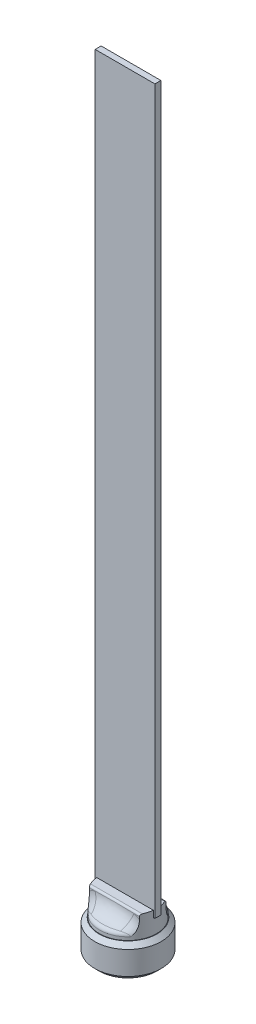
ISO-10303-21;
HEADER;
FILE_DESCRIPTION(('STEP AP214'),'2;1');
FILE_NAME('part.step','',(''),(''),'','','');
FILE_SCHEMA(('AUTOMOTIVE_DESIGN { 1 0 10303 214 1 1 1 1 }'));
ENDSEC;
DATA;
#1=APPLICATION_CONTEXT('core data for automotive mechanical design processes');
#2=APPLICATION_PROTOCOL_DEFINITION('international standard','automotive_design',2000,#1);
#3=PRODUCT_CONTEXT('',#1,'mechanical');
#4=PRODUCT('Part','Part','',(#3));
#5=PRODUCT_RELATED_PRODUCT_CATEGORY('part','',(#4));
#6=PRODUCT_DEFINITION_FORMATION('','',#4);
#7=PRODUCT_DEFINITION_CONTEXT('part definition',#1,'design');
#8=PRODUCT_DEFINITION('design','',#6,#7);
#9=PRODUCT_DEFINITION_SHAPE('','',#8);
#10=(LENGTH_UNIT() NAMED_UNIT(*) SI_UNIT(.MILLI.,.METRE.));
#11=(NAMED_UNIT(*) PLANE_ANGLE_UNIT() SI_UNIT($,.RADIAN.));
#12=(NAMED_UNIT(*) SI_UNIT($,.STERADIAN.) SOLID_ANGLE_UNIT());
#13=UNCERTAINTY_MEASURE_WITH_UNIT(LENGTH_MEASURE(1.E-05),#10,'distance_accuracy_value','');
#14=(GEOMETRIC_REPRESENTATION_CONTEXT(3) GLOBAL_UNCERTAINTY_ASSIGNED_CONTEXT((#13)) GLOBAL_UNIT_ASSIGNED_CONTEXT((#10,
#11,#12)) REPRESENTATION_CONTEXT('',''));
#15=CARTESIAN_POINT('',(0.,0.,0.));
#16=DIRECTION('',(0.,0.,1.));
#17=DIRECTION('',(1.,0.,0.));
#18=AXIS2_PLACEMENT_3D('',#15,#16,#17);
#19=CARTESIAN_POINT('',(0.,13.081,0.));
#20=DIRECTION('',(0.,1.,0.));
#21=DIRECTION('',(0.,0.,1.));
#22=AXIS2_PLACEMENT_3D('',#19,#20,#21);
#23=PLANE('',#22);
#24=DIRECTION('',(0.866025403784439,0.,-0.5));
#25=VECTOR('',#24,1.);
#26=CARTESIAN_POINT('',(0.,13.081,8.24155962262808));
#27=LINE('',#26,#25);
#28=CARTESIAN_POINT('',(7.1374,13.081,4.12077981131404));
#29=VERTEX_POINT('',#28);
#30=CARTESIAN_POINT('',(0.,13.081,8.24155962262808));
#31=VERTEX_POINT('',#30);
#32=EDGE_CURVE('E122',#29,#31,#27,.F.);
#33=ORIENTED_EDGE('',*,*,#32,.T.);
#34=DIRECTION('',(0.866025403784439,0.,0.5));
#35=VECTOR('',#34,1.);
#36=CARTESIAN_POINT('',(-7.1374,13.081,4.12077981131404));
#37=LINE('',#36,#35);
#38=CARTESIAN_POINT('',(-7.1374,13.081,4.12077981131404));
#39=VERTEX_POINT('',#38);
#40=EDGE_CURVE('E140',#31,#39,#37,.F.);
#41=ORIENTED_EDGE('',*,*,#40,.T.);
#42=DIRECTION('',(0.,0.,1.));
#43=VECTOR('',#42,1.);
#44=CARTESIAN_POINT('',(-7.1374,13.081,-4.12077981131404));
#45=LINE('',#44,#43);
#46=CARTESIAN_POINT('',(-7.1374,13.081,-4.12077981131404));
#47=VERTEX_POINT('',#46);
#48=EDGE_CURVE('E907',#39,#47,#45,.F.);
#49=ORIENTED_EDGE('',*,*,#48,.T.);
#50=DIRECTION('',(-0.866025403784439,0.,0.5));
#51=VECTOR('',#50,1.);
#52=CARTESIAN_POINT('',(0.,13.081,-8.24155962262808));
#53=LINE('',#52,#51);
#54=CARTESIAN_POINT('',(0.,13.081,-8.24155962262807));
#55=VERTEX_POINT('',#54);
#56=EDGE_CURVE('E911',#47,#55,#53,.F.);
#57=ORIENTED_EDGE('',*,*,#56,.T.);
#58=DIRECTION('',(-0.866025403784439,0.,-0.5));
#59=VECTOR('',#58,1.);
#60=CARTESIAN_POINT('',(7.1374,13.081,-4.12077981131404));
#61=LINE('',#60,#59);
#62=CARTESIAN_POINT('',(7.1374,13.081,-4.12077981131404));
#63=VERTEX_POINT('',#62);
#64=EDGE_CURVE('E914',#55,#63,#61,.F.);
#65=ORIENTED_EDGE('',*,*,#64,.T.);
#66=DIRECTION('',(0.,0.,-1.));
#67=VECTOR('',#66,1.);
#68=CARTESIAN_POINT('',(7.1374,13.081,4.12077981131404));
#69=LINE('',#68,#67);
#70=EDGE_CURVE('E127',#63,#29,#69,.F.);
#71=ORIENTED_EDGE('',*,*,#70,.T.);
#72=EDGE_LOOP('',(#33,#41,#49,#57,#65,#71));
#73=FACE_BOUND('',#72,.T.);
#74=ADVANCED_FACE('F35',(#73),#23,.F.);
#75=CARTESIAN_POINT('',(-7.1374,0.,4.12077981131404));
#76=DIRECTION('',(-0.5,0.,0.866025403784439));
#77=DIRECTION('',(0.866025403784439,0.,0.5));
#78=AXIS2_PLACEMENT_3D('',#75,#76,#77);
#79=PLANE('',#78);
#80=DIRECTION('',(0.,1.,0.));
#81=VECTOR('',#80,1.);
#82=CARTESIAN_POINT('',(-7.1374,0.,4.12077981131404));
#83=LINE('',#82,#81);
#84=CARTESIAN_POINT('',(-7.13739996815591,0.267440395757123,4.12077982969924));
#85=VERTEX_POINT('',#84);
#86=EDGE_CURVE('E910',#85,#39,#83,.T.);
#87=ORIENTED_EDGE('',*,*,#86,.T.);
#88=ORIENTED_EDGE('',*,*,#40,.F.);
#89=DIRECTION('',(0.,1.,0.));
#90=VECTOR('',#89,1.);
#91=CARTESIAN_POINT('',(0.,0.,8.24155962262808));
#92=LINE('',#91,#90);
#93=CARTESIAN_POINT('',(3.18440973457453E-08,0.267440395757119,8.24155960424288));
#94=VERTEX_POINT('',#93);
#95=EDGE_CURVE('E114',#31,#94,#92,.F.);
#96=ORIENTED_EDGE('',*,*,#95,.T.);
#97=CARTESIAN_POINT('',(2.44954622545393E-08,0.267440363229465,8.24155963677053));
#98=CARTESIAN_POINT('',(-0.122715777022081,0.338279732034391,8.17070963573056));
#99=CARTESIAN_POINT('',(-0.246374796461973,0.406945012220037,8.09931506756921));
#100=CARTESIAN_POINT('',(-0.495764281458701,0.539266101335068,7.95532998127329));
#101=CARTESIAN_POINT('',(-0.621495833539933,0.602919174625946,7.88273883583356));
#102=CARTESIAN_POINT('',(-1.00324461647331,0.785910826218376,7.66233607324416));
#103=CARTESIAN_POINT('',(-1.26249332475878,0.896501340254,7.51265876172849));
#104=CARTESIAN_POINT('',(-1.78528890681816,1.08587935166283,7.21082259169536));
#105=CARTESIAN_POINT('',(-2.04870219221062,1.16514389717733,7.0587408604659));
#106=CARTESIAN_POINT('',(-2.44815219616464,1.25683303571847,6.82811829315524));
#107=CARTESIAN_POINT('',(-2.58189023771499,1.28284920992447,6.75090459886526));
#108=CARTESIAN_POINT('',(-2.85049853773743,1.3252236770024,6.59582352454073));
#109=CARTESIAN_POINT('',(-2.98536862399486,1.34158341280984,6.51795624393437));
#110=CARTESIAN_POINT('',(-3.31404017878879,1.36901357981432,6.32819763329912));
#111=CARTESIAN_POINT('',(-3.50819579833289,1.37476813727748,6.21610183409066));
#112=CARTESIAN_POINT('',(-3.89615697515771,1.36510406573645,5.99211234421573));
#113=CARTESIAN_POINT('',(-4.08996238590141,1.34967801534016,5.88021873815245));
#114=CARTESIAN_POINT('',(-4.47574590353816,1.29856203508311,5.65748652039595));
#115=CARTESIAN_POINT('',(-4.66772172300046,1.26284944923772,5.5466492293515));
#116=CARTESIAN_POINT('',(-5.04837371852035,1.17310193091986,5.32687969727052));
#117=CARTESIAN_POINT('',(-5.23705014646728,1.11906840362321,5.21794731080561));
#118=CARTESIAN_POINT('',(-5.57196165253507,1.0079129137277,5.02458606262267));
#119=CARTESIAN_POINT('',(-5.71893877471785,0.953715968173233,4.93972878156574));
#120=CARTESIAN_POINT('',(-6.01025501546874,0.836589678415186,4.7715372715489));
#121=CARTESIAN_POINT('',(-6.15459405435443,0.773660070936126,4.68820308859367));
#122=CARTESIAN_POINT('',(-6.44017946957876,0.64047878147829,4.52332027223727));
#123=CARTESIAN_POINT('',(-6.58143396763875,0.570250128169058,4.44176694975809));
#124=CARTESIAN_POINT('',(-6.86132774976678,0.423392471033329,4.28017019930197));
#125=CARTESIAN_POINT('',(-6.99996857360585,0.346767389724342,4.20012588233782));
#126=CARTESIAN_POINT('',(-7.13739993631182,0.267440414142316,4.12077984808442));
#127=B_SPLINE_CURVE_WITH_KNOTS('',3,(#97,#98,#99,#100,#101,#102,#103,#104,#105,#106,#107,#108,
#109,#110,#111,#112,#113,#114,#115,#116,#117,#118,#119,#120,#121,#122,#123,#124,#125,#126),
.UNSPECIFIED.,.F.,.F.,(4,2,2,2,2,2,2,2,2,2,2,2,2,2,4),(0.,0.475234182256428,0.950725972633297,
1.90684205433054,2.8477782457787,3.31732374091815,3.78679905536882,4.45855001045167,
5.13053639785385,5.80327473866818,6.47596149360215,7.01018540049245,7.54442541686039,
8.07702831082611,8.60930695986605),.UNSPECIFIED.);
#128=EDGE_CURVE('E42',#94,#85,#127,.T.);
#129=ORIENTED_EDGE('',*,*,#128,.T.);
#130=EDGE_LOOP('',(#87,#88,#96,#129));
#131=FACE_BOUND('',#130,.T.);
#132=ADVANCED_FACE('F749',(#131),#79,.F.);
#133=CARTESIAN_POINT('',(-7.1374,0.,-4.12077981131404));
#134=DIRECTION('',(-1.,0.,0.));
#135=DIRECTION('',(0.,0.,1.));
#136=AXIS2_PLACEMENT_3D('',#133,#134,#135);
#137=PLANE('',#136);
#138=DIRECTION('',(0.,1.,0.));
#139=VECTOR('',#138,1.);
#140=CARTESIAN_POINT('',(-7.1374,0.,-4.12077981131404));
#141=LINE('',#140,#139);
#142=CARTESIAN_POINT('',(-7.1374,0.267440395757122,-4.12077977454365));
#143=VERTEX_POINT('',#142);
#144=EDGE_CURVE('E909',#143,#47,#141,.T.);
#145=ORIENTED_EDGE('',*,*,#144,.T.);
#146=ORIENTED_EDGE('',*,*,#48,.F.);
#147=ORIENTED_EDGE('',*,*,#86,.F.);
#148=CARTESIAN_POINT('',(-7.1374,0.267440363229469,4.12077983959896));
#149=CARTESIAN_POINT('',(-7.1374,0.338279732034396,3.97907983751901));
#150=CARTESIAN_POINT('',(-7.1374,0.406945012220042,3.83629070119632));
#151=CARTESIAN_POINT('',(-7.1374,0.539266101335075,3.54832052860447));
#152=CARTESIAN_POINT('',(-7.1374,0.602919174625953,3.40313823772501));
#153=CARTESIAN_POINT('',(-7.1374,0.785910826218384,2.96233271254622));
#154=CARTESIAN_POINT('',(-7.1374,0.896501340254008,2.66297808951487));
#155=CARTESIAN_POINT('',(-7.1374,1.08587935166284,2.0593057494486));
#156=CARTESIAN_POINT('',(-7.1374,1.16514389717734,1.75514228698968));
#157=CARTESIAN_POINT('',(-7.1374,1.25683303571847,1.29389715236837));
#158=CARTESIAN_POINT('',(-7.1374,1.28284920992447,1.1394697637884));
#159=CARTESIAN_POINT('',(-7.1374,1.32522367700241,0.829307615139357));
#160=CARTESIAN_POINT('',(-7.1374,1.34158341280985,0.673573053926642));
#161=CARTESIAN_POINT('',(-7.1374,1.36901357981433,0.29405583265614));
#162=CARTESIAN_POINT('',(-7.1374,1.37476813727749,0.0698642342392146));
#163=CARTESIAN_POINT('',(-7.1374,1.36510406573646,-0.378114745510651));
#164=CARTESIAN_POINT('',(-7.1374,1.34967801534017,-0.601901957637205));
#165=CARTESIAN_POINT('',(-7.1374,1.29856203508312,-1.0473663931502));
#166=CARTESIAN_POINT('',(-7.1374,1.26284944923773,-1.26904097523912));
#167=CARTESIAN_POINT('',(-7.1374,1.17310193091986,-1.70858003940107));
#168=CARTESIAN_POINT('',(-7.1374,1.11906840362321,-1.92644481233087));
#169=CARTESIAN_POINT('',(-7.1374,1.0079129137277,-2.31316730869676));
#170=CARTESIAN_POINT('',(-7.1374,0.953715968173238,-2.48288187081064));
#171=CARTESIAN_POINT('',(-7.1374,0.836589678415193,-2.81926489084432));
#172=CARTESIAN_POINT('',(-7.1374,0.773660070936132,-2.98593325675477));
#173=CARTESIAN_POINT('',(-7.1374,0.640478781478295,-3.31569888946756));
#174=CARTESIAN_POINT('',(-7.1374,0.570250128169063,-3.47880553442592));
#175=CARTESIAN_POINT('',(-7.1374,0.423392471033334,-3.80199903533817));
#176=CARTESIAN_POINT('',(-7.1374,0.346767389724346,-3.96208766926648));
#177=CARTESIAN_POINT('',(-7.1374,0.267440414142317,-4.12077973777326));
#178=B_SPLINE_CURVE_WITH_KNOTS('',3,(#148,#149,#150,#151,#152,#153,#154,#155,#156,#157,#158,
#159,#160,#161,#162,#163,#164,#165,#166,#167,#168,#169,#170,#171,#172,#173,#174,#175,#176,#177),
.UNSPECIFIED.,.F.,.F.,(4,2,2,2,2,2,2,2,2,2,2,2,2,2,4),(0.,0.475234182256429,0.950725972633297,
1.90684205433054,2.8477782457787,3.31732374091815,3.78679905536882,4.45855001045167,
5.13053639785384,5.80327473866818,6.47596149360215,7.01018540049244,7.54442541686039,
8.07702831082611,8.60930695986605),.UNSPECIFIED.);
#179=EDGE_CURVE('E718',#85,#143,#178,.T.);
#180=ORIENTED_EDGE('',*,*,#179,.T.);
#181=EDGE_LOOP('',(#145,#146,#147,#180));
#182=FACE_BOUND('',#181,.T.);
#183=ADVANCED_FACE('F744',(#182),#137,.F.);
#184=CARTESIAN_POINT('',(0.,0.,-8.24155962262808));
#185=DIRECTION('',(-0.5,0.,-0.866025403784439));
#186=DIRECTION('',(-0.866025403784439,0.,0.5));
#187=AXIS2_PLACEMENT_3D('',#184,#185,#186);
#188=PLANE('',#187);
#189=DIRECTION('',(0.,1.,0.));
#190=VECTOR('',#189,1.);
#191=CARTESIAN_POINT('',(0.,0.,-8.24155962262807));
#192=LINE('',#191,#190);
#193=CARTESIAN_POINT('',(0.,0.267440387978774,-8.24155961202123));
#194=VERTEX_POINT('',#193);
#195=EDGE_CURVE('E913',#194,#55,#192,.T.);
#196=ORIENTED_EDGE('',*,*,#195,.T.);
#197=ORIENTED_EDGE('',*,*,#56,.F.);
#198=ORIENTED_EDGE('',*,*,#144,.F.);
#199=CARTESIAN_POINT('',(-7.13740002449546,0.267440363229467,-4.12077979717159));
#200=CARTESIAN_POINT('',(-7.01468422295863,0.33827973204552,-4.1916297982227));
#201=CARTESIAN_POINT('',(-6.89102520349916,0.406945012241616,-4.26302436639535));
#202=CARTESIAN_POINT('',(-6.64163571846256,0.539266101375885,-4.40700945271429));
#203=CARTESIAN_POINT('',(-6.51590416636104,0.602919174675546,-4.47960059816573));
#204=CARTESIAN_POINT('',(-6.13415538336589,0.785910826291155,-4.7000033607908));
#205=CARTESIAN_POINT('',(-5.87490667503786,0.896501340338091,-4.84968067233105));
#206=CARTESIAN_POINT('',(-5.35211109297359,1.08587935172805,-5.151516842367));
#207=CARTESIAN_POINT('',(-5.08869780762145,1.1651438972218,-5.30359857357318));
#208=CARTESIAN_POINT('',(-4.68924780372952,1.25683303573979,-5.53422114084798));
#209=CARTESIAN_POINT('',(-4.55550976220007,1.28284920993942,-5.61143483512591));
#210=CARTESIAN_POINT('',(-4.28690146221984,1.32522367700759,-5.76651590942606));
#211=CARTESIAN_POINT('',(-4.15203137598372,1.34158341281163,-5.8443831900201));
#212=CARTESIAN_POINT('',(-3.82335982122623,1.36901357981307,-6.03414180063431));
#213=CARTESIAN_POINT('',(-3.62920420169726,1.37476813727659,-6.14623759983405));
#214=CARTESIAN_POINT('',(-3.2412430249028,1.36510406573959,-6.37022708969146));
#215=CARTESIAN_POINT('',(-3.04743761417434,1.34967801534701,-6.48212069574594));
#216=CARTESIAN_POINT('',(-2.66165409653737,1.2985620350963,-6.70485291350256));
#217=CARTESIAN_POINT('',(-2.46967827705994,1.2628494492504,-6.81569020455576));
#218=CARTESIAN_POINT('',(-2.08902628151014,1.1731019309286,-7.035459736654));
#219=CARTESIAN_POINT('',(-1.90034985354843,1.11906840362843,-7.14439212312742));
#220=CARTESIAN_POINT('',(-1.56543834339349,1.00791291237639,-7.33775337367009));
#221=CARTESIAN_POINT('',(-1.41846121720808,0.953715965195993,-7.42261065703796));
#222=CARTESIAN_POINT('',(-1.12714496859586,0.836589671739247,-7.59080217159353));
#223=CARTESIAN_POINT('',(-0.982805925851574,0.773660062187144,-7.67413635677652));
#224=CARTESIAN_POINT('',(-0.697220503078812,0.640478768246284,-7.839019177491));
#225=CARTESIAN_POINT('',(-0.555966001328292,0.570250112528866,-7.92057250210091));
#226=CARTESIAN_POINT('',(-0.276072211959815,0.423392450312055,-8.08216925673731));
#227=CARTESIAN_POINT('',(-0.137431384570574,0.346767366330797,-8.16221357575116));
#228=CARTESIAN_POINT('',(-1.83716012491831E-08,0.26744038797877,-8.24155961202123));
#229=B_SPLINE_CURVE_WITH_KNOTS('',3,(#199,#200,#201,#202,#203,#204,#205,#206,#207,#208,#209,
#210,#211,#212,#213,#214,#215,#216,#217,#218,#219,#220,#221,#222,#223,#224,#225,#226,#227,#228),
.UNSPECIFIED.,.F.,.F.,(4,2,2,2,2,2,2,2,2,2,2,2,2,2,4),(0.,0.475234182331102,0.950725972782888,
1.90684205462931,2.84777824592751,3.31732374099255,3.78679905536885,4.45855001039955,
5.13053639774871,5.80327473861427,6.4759614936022,7.0101854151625,7.54442544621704,
8.07702835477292,8.6093070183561),.UNSPECIFIED.);
#230=EDGE_CURVE('E734',#143,#194,#229,.T.);
#231=ORIENTED_EDGE('',*,*,#230,.T.);
#232=EDGE_LOOP('',(#196,#197,#198,#231));
#233=FACE_BOUND('',#232,.T.);
#234=ADVANCED_FACE('F740',(#233),#188,.F.);
#235=CARTESIAN_POINT('',(7.1374,0.,-4.12077981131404));
#236=DIRECTION('',(0.5,0.,-0.866025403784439));
#237=DIRECTION('',(-0.866025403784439,0.,-0.5));
#238=AXIS2_PLACEMENT_3D('',#235,#236,#237);
#239=PLANE('',#238);
#240=DIRECTION('',(0.,1.,0.));
#241=VECTOR('',#240,1.);
#242=CARTESIAN_POINT('',(7.1374,0.,-4.12077981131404));
#243=LINE('',#242,#241);
#244=CARTESIAN_POINT('',(7.13740001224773,0.267440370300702,-4.12077980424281));
#245=VERTEX_POINT('',#244);
#246=EDGE_CURVE('E916',#245,#63,#243,.T.);
#247=ORIENTED_EDGE('',*,*,#246,.T.);
#248=ORIENTED_EDGE('',*,*,#64,.F.);
#249=ORIENTED_EDGE('',*,*,#195,.F.);
#250=CARTESIAN_POINT('',(1.83715834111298E-08,0.267440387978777,-8.24155961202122));
#251=CARTESIAN_POINT('',(0.122715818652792,0.338279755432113,-8.17070961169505));
#252=CARTESIAN_POINT('',(0.246374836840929,0.406945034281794,-8.09931504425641));
#253=CARTESIAN_POINT('',(0.495764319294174,0.539266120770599,-7.95532995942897));
#254=CARTESIAN_POINT('',(0.621495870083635,0.602919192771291,-7.88273881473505));
#255=CARTESIAN_POINT('',(1.00324464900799,0.785910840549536,-7.66233605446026));
#256=CARTESIAN_POINT('',(1.26249335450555,0.896501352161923,-7.51265874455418));
#257=CARTESIAN_POINT('',(1.78528893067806,1.08587935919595,-7.21082257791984));
#258=CARTESIAN_POINT('',(2.04870221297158,1.16514390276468,-7.05874084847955));
#259=CARTESIAN_POINT('',(2.44815221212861,1.25683303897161,-6.82811828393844));
#260=CARTESIAN_POINT('',(2.58189025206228,1.28284921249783,-6.75090459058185));
#261=CARTESIAN_POINT('',(2.85049854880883,1.32522367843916,-6.59582351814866));
#262=CARTESIAN_POINT('',(2.98536863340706,1.34158341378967,-6.51795623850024));
#263=CARTESIAN_POINT('',(3.31404018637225,1.3690135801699,-6.32819762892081));
#264=CARTESIAN_POINT('',(3.50819580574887,1.37476813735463,-6.21610182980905));
#265=CARTESIAN_POINT('',(3.89615698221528,1.3651040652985,-5.99211234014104));
#266=CARTESIAN_POINT('',(4.08996239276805,1.34967801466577,-5.88021873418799));
#267=CARTESIAN_POINT('',(4.47574591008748,1.2985620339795,-5.6574865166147));
#268=CARTESIAN_POINT('',(4.66772172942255,1.26284944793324,-5.5466492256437));
#269=CARTESIAN_POINT('',(5.04837372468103,1.17310192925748,-5.32687969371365));
#270=CARTESIAN_POINT('',(5.23705015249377,1.11906840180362,-5.21794730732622));
#271=CARTESIAN_POINT('',(5.5719616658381,1.00791290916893,-5.02458605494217));
#272=CARTESIAN_POINT('',(5.71893879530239,0.953715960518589,-4.93972876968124));
#273=CARTESIAN_POINT('',(6.01025505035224,0.836589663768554,-4.7715372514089));
#274=CARTESIAN_POINT('',(6.1545940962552,0.773660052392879,-4.68820306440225));
#275=CARTESIAN_POINT('',(6.44017952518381,0.64047875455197,-4.52332024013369));
#276=CARTESIAN_POINT('',(6.58143402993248,0.570250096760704,-4.44176691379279));
#277=CARTESIAN_POINT('',(6.86132782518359,0.423392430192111,-4.28017015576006));
#278=CARTESIAN_POINT('',(6.99996865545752,0.346767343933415,-4.20012583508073));
#279=CARTESIAN_POINT('',(7.13740002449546,0.26744036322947,-4.12077979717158));
#280=B_SPLINE_CURVE_WITH_KNOTS('',3,(#250,#251,#252,#253,#254,#255,#256,#257,#258,#259,#260,
#261,#262,#263,#264,#265,#266,#267,#268,#269,#270,#271,#272,#273,#274,#275,#276,#277,#278,#279),
.UNSPECIFIED.,.F.,.F.,(4,2,2,2,2,2,2,2,2,2,2,2,2,2,4),(0.,0.475234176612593,0.950725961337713,
1.90684203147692,2.84777821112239,3.31732370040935,3.78679900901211,4.45854996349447,
5.13053635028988,5.8032746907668,6.47596144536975,7.01018537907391,7.54442542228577,
8.07702834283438,8.60930701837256),.UNSPECIFIED.);
#281=EDGE_CURVE('E728',#194,#245,#280,.T.);
#282=ORIENTED_EDGE('',*,*,#281,.T.);
#283=EDGE_LOOP('',(#247,#248,#249,#282));
#284=FACE_BOUND('',#283,.T.);
#285=ADVANCED_FACE('F743',(#284),#239,.F.);
#286=CARTESIAN_POINT('',(7.1374,0.,4.12077981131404));
#287=DIRECTION('',(1.,0.,0.));
#288=DIRECTION('',(0.,0.,-1.));
#289=AXIS2_PLACEMENT_3D('',#286,#287,#288);
#290=PLANE('',#289);
#291=DIRECTION('',(0.,1.,0.));
#292=VECTOR('',#291,1.);
#293=CARTESIAN_POINT('',(7.1374,0.,4.12077981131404));
#294=LINE('',#293,#292);
#295=CARTESIAN_POINT('',(7.1374,0.267440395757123,4.12077977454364));
#296=VERTEX_POINT('',#295);
#297=EDGE_CURVE('E918',#296,#29,#294,.T.);
#298=ORIENTED_EDGE('',*,*,#297,.T.);
#299=ORIENTED_EDGE('',*,*,#70,.F.);
#300=ORIENTED_EDGE('',*,*,#246,.F.);
#301=CARTESIAN_POINT('',(7.1374,0.267440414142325,-4.12077973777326));
#302=CARTESIAN_POINT('',(7.1374,0.338279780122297,-3.97907973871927));
#303=CARTESIAN_POINT('',(7.1374,0.406945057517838,-3.83629060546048));
#304=CARTESIAN_POINT('',(7.1374,0.539266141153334,-3.54832043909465));
#305=CARTESIAN_POINT('',(7.1374,0.602919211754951,-3.40313815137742));
#306=CARTESIAN_POINT('',(7.1374,0.78591085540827,-2.96233263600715));
#307=CARTESIAN_POINT('',(7.1374,0.896501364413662,-2.66297801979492));
#308=CARTESIAN_POINT('',(7.1374,1.08587936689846,-2.0593056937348));
#309=CARTESIAN_POINT('',(7.1374,1.16514390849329,-1.75514223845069));
#310=CARTESIAN_POINT('',(7.1374,1.25683304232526,-1.29389711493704));
#311=CARTESIAN_POINT('',(7.1374,1.28284921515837,-1.13946973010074));
#312=CARTESIAN_POINT('',(7.1374,1.32522367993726,-0.829307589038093));
#313=CARTESIAN_POINT('',(7.1374,1.34158341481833,-0.673573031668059));
#314=CARTESIAN_POINT('',(7.1374,1.36901358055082,-0.294055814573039));
#315=CARTESIAN_POINT('',(7.1374,1.37476813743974,-0.0698642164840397));
#316=CARTESIAN_POINT('',(7.1374,1.36510406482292,0.378114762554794));
#317=CARTESIAN_POINT('',(7.1374,1.34967801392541,0.601901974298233));
#318=CARTESIAN_POINT('',(7.1374,1.29856203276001,1.04736640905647));
#319=CARTESIAN_POINT('',(7.1374,1.26284944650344,1.26904099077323));
#320=CARTESIAN_POINT('',(7.1374,1.17310192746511,1.708580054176));
#321=CARTESIAN_POINT('',(7.1374,1.11906839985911,1.92644482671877));
#322=CARTESIAN_POINT('',(7.1374,1.00791290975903,2.31316732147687));
#323=CARTESIAN_POINT('',(7.1374,0.95371596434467,2.48288188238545));
#324=CARTESIAN_POINT('',(7.1374,0.836589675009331,2.81926490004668));
#325=CARTESIAN_POINT('',(7.1374,0.773660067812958,2.98593326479));
#326=CARTESIAN_POINT('',(7.1374,0.640478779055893,3.31569889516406));
#327=CARTESIAN_POINT('',(7.1374,0.570250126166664,3.47880553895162));
#328=CARTESIAN_POINT('',(7.1374,0.423392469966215,3.80199903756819));
#329=CARTESIAN_POINT('',(7.1374,0.346767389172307,3.96208767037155));
#330=CARTESIAN_POINT('',(7.1374,0.267440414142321,4.12077973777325));
#331=B_SPLINE_CURVE_WITH_KNOTS('',3,(#301,#302,#303,#304,#305,#306,#307,#308,#309,#310,#311,
#312,#313,#314,#315,#316,#317,#318,#319,#320,#321,#322,#323,#324,#325,#326,#327,#328,#329,#330),
.UNSPECIFIED.,.F.,.F.,(4,2,2,2,2,2,2,2,2,2,2,2,2,2,4),(0.,0.475234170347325,0.950725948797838,
1.90684200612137,2.84777817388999,3.31732365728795,3.78679896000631,4.45854991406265,
5.13053630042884,5.80327464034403,6.47596139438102,7.01018529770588,7.54442531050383,
8.07702820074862,8.60930684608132),.UNSPECIFIED.);
#332=EDGE_CURVE('E700',#245,#296,#331,.T.);
#333=ORIENTED_EDGE('',*,*,#332,.T.);
#334=EDGE_LOOP('',(#298,#299,#300,#333));
#335=FACE_BOUND('',#334,.T.);
#336=ADVANCED_FACE('F1107',(#335),#290,.F.);
#337=CARTESIAN_POINT('',(0.,0.,8.24155962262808));
#338=DIRECTION('',(0.5,0.,0.866025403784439));
#339=DIRECTION('',(0.866025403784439,0.,-0.5));
#340=AXIS2_PLACEMENT_3D('',#337,#338,#339);
#341=PLANE('',#340);
#342=ORIENTED_EDGE('',*,*,#95,.F.);
#343=ORIENTED_EDGE('',*,*,#32,.F.);
#344=ORIENTED_EDGE('',*,*,#297,.F.);
#345=CARTESIAN_POINT('',(7.13740002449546,0.267440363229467,4.12077979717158));
#346=CARTESIAN_POINT('',(7.01468422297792,0.338279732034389,4.19162979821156));
#347=CARTESIAN_POINT('',(6.89102520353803,0.406945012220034,4.26302436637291));
#348=CARTESIAN_POINT('',(6.6416357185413,0.539266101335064,4.40700945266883));
#349=CARTESIAN_POINT('',(6.51590416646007,0.602919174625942,4.47960059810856));
#350=CARTESIAN_POINT('',(6.13415538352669,0.785910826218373,4.70000336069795));
#351=CARTESIAN_POINT('',(5.87490667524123,0.896501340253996,4.84968067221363));
#352=CARTESIAN_POINT('',(5.35211109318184,1.08587935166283,5.15151684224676));
#353=CARTESIAN_POINT('',(5.08869780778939,1.16514389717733,5.30359857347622));
#354=CARTESIAN_POINT('',(4.68924780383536,1.25683303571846,5.53422114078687));
#355=CARTESIAN_POINT('',(4.55550976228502,1.28284920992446,5.61143483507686));
#356=CARTESIAN_POINT('',(4.28690146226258,1.3252236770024,5.76651590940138));
#357=CARTESIAN_POINT('',(4.15203137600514,1.34158341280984,5.84438319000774));
#358=CARTESIAN_POINT('',(3.82335982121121,1.36901357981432,6.03414180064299));
#359=CARTESIAN_POINT('',(3.62920420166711,1.37476813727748,6.14623759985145));
#360=CARTESIAN_POINT('',(3.2412430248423,1.36510406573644,6.37022708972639));
#361=CARTESIAN_POINT('',(3.0474376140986,1.34967801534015,6.48212069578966));
#362=CARTESIAN_POINT('',(2.66165409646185,1.2985620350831,6.70485291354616));
#363=CARTESIAN_POINT('',(2.46967827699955,1.26284944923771,6.81569020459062));
#364=CARTESIAN_POINT('',(2.08902628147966,1.17310193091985,7.0354597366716));
#365=CARTESIAN_POINT('',(1.90034985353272,1.1190684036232,7.1443921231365));
#366=CARTESIAN_POINT('',(1.56543834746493,1.00791291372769,7.33775337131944));
#367=CARTESIAN_POINT('',(1.41846122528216,0.953715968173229,7.42261065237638));
#368=CARTESIAN_POINT('',(1.12714498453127,0.836589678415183,7.59080216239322));
#369=CARTESIAN_POINT('',(0.982805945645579,0.773660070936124,7.67413634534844));
#370=CARTESIAN_POINT('',(0.697220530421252,0.640478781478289,7.83901916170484));
#371=CARTESIAN_POINT('',(0.555966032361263,0.570250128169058,7.92057248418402));
#372=CARTESIAN_POINT('',(0.276072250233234,0.42339247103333,8.08216923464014));
#373=CARTESIAN_POINT('',(0.137431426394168,0.346767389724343,8.16221355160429));
#374=CARTESIAN_POINT('',(6.36881944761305E-08,0.267440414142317,8.24155958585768));
#375=B_SPLINE_CURVE_WITH_KNOTS('',3,(#345,#346,#347,#348,#349,#350,#351,#352,#353,#354,#355,
#356,#357,#358,#359,#360,#361,#362,#363,#364,#365,#366,#367,#368,#369,#370,#371,#372,#373,#374),
.UNSPECIFIED.,.F.,.F.,(4,2,2,2,2,2,2,2,2,2,2,2,2,2,4),(0.,0.475234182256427,0.950725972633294,
1.90684205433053,2.84777824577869,3.31732374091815,3.78679905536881,4.45855001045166,
5.13053639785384,5.80327473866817,6.47596149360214,7.01018540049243,7.54442541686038,
8.07702831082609,8.60930695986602),.UNSPECIFIED.);
#376=EDGE_CURVE('E693',#296,#94,#375,.T.);
#377=ORIENTED_EDGE('',*,*,#376,.T.);
#378=EDGE_LOOP('',(#342,#343,#344,#377));
#379=FACE_BOUND('',#378,.T.);
#380=ADVANCED_FACE('F707',(#379),#341,.F.);
#381=CARTESIAN_POINT('',(0.,0.,0.));
#382=DIRECTION('',(0.,-1.,0.));
#383=DIRECTION('',(0.,0.,-1.));
#384=AXIS2_PLACEMENT_3D('',#381,#382,#383);
#385=CONICAL_SURFACE('',#384,8.509,0.785398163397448);
#386=CARTESIAN_POINT('',(0.,0.,0.));
#387=DIRECTION('',(0.,-1.,0.));
#388=DIRECTION('',(0.,0.,-1.));
#389=AXIS2_PLACEMENT_3D('',#386,#387,#388);
#390=CIRCLE('',#389,8.509);
#391=CARTESIAN_POINT('',(0.,0.,-8.509));
#392=VERTEX_POINT('',#391);
#393=EDGE_CURVE('E690',#392,#392,#390,.F.);
#394=ORIENTED_EDGE('',*,*,#393,.F.);
#395=EDGE_LOOP('',(#394));
#396=FACE_BOUND('',#395,.T.);
#397=ORIENTED_EDGE('',*,*,#332,.F.);
#398=ORIENTED_EDGE('',*,*,#281,.F.);
#399=ORIENTED_EDGE('',*,*,#230,.F.);
#400=ORIENTED_EDGE('',*,*,#179,.F.);
#401=ORIENTED_EDGE('',*,*,#128,.F.);
#402=ORIENTED_EDGE('',*,*,#376,.F.);
#403=EDGE_LOOP('',(#397,#398,#399,#400,#401,#402));
#404=FACE_BOUND('',#403,.T.);
#405=ADVANCED_FACE('F709',(#396,#404),#385,.F.);
#406=CARTESIAN_POINT('',(0.,0.,-7.112));
#407=DIRECTION('',(0.,-1.,0.));
#408=DIRECTION('',(0.,0.,-1.));
#409=AXIS2_PLACEMENT_3D('',#406,#407,#408);
#410=PLANE('',#409);
#411=ORIENTED_EDGE('',*,*,#393,.T.);
#412=EDGE_LOOP('',(#411));
#413=FACE_BOUND('',#412,.T.);
#414=CARTESIAN_POINT('',(0.,0.,0.));
#415=DIRECTION('',(0.,1.,0.));
#416=DIRECTION('',(-1.,0.,0.));
#417=AXIS2_PLACEMENT_3D('',#414,#415,#416);
#418=CIRCLE('',#417,11.43);
#419=CARTESIAN_POINT('',(-11.43,0.,0.));
#420=VERTEX_POINT('',#419);
#421=EDGE_CURVE('E686',#420,#420,#418,.T.);
#422=ORIENTED_EDGE('',*,*,#421,.F.);
#423=EDGE_LOOP('',(#422));
#424=FACE_BOUND('',#423,.T.);
#425=ADVANCED_FACE('F713',(#413,#424),#410,.T.);
#426=CARTESIAN_POINT('',(0.,1.7195,0.));
#427=DIRECTION('',(0.,1.,0.));
#428=DIRECTION('',(-1.,0.,0.));
#429=AXIS2_PLACEMENT_3D('',#426,#427,#428);
#430=CONICAL_SURFACE('',#429,13.1495,0.785398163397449);
#431=CARTESIAN_POINT('',(0.,1.7195,0.));
#432=DIRECTION('',(0.,-1.,0.));
#433=DIRECTION('',(0.,0.,-1.));
#434=AXIS2_PLACEMENT_3D('',#431,#432,#433);
#435=CIRCLE('',#434,13.1495);
#436=CARTESIAN_POINT('',(0.,1.7195,-13.1495));
#437=VERTEX_POINT('',#436);
#438=EDGE_CURVE('E689',#437,#437,#435,.F.);
#439=ORIENTED_EDGE('',*,*,#438,.F.);
#440=EDGE_LOOP('',(#439));
#441=FACE_BOUND('',#440,.T.);
#442=ORIENTED_EDGE('',*,*,#421,.T.);
#443=EDGE_LOOP('',(#442));
#444=FACE_BOUND('',#443,.T.);
#445=ADVANCED_FACE('F1129',(#441,#444),#430,.T.);
#446=CARTESIAN_POINT('',(0.,6.35,0.));
#447=DIRECTION('',(0.,-1.,0.));
#448=DIRECTION('',(0.,0.,-1.));
#449=AXIS2_PLACEMENT_3D('',#446,#447,#448);
#450=CYLINDRICAL_SURFACE('',#449,13.1495);
#451=CARTESIAN_POINT('',(0.,10.9805,0.));
#452=DIRECTION('',(0.,-1.,0.));
#453=DIRECTION('',(0.,0.,1.));
#454=AXIS2_PLACEMENT_3D('',#451,#452,#453);
#455=CIRCLE('',#454,13.1495);
#456=CARTESIAN_POINT('',(0.,10.9805,13.1495));
#457=VERTEX_POINT('',#456);
#458=EDGE_CURVE('E327',#457,#457,#455,.F.);
#459=ORIENTED_EDGE('',*,*,#458,.F.);
#460=EDGE_LOOP('',(#459));
#461=FACE_BOUND('',#460,.T.);
#462=ORIENTED_EDGE('',*,*,#438,.T.);
#463=EDGE_LOOP('',(#462));
#464=FACE_BOUND('',#463,.T.);
#465=ADVANCED_FACE('F1137',(#461,#464),#450,.T.);
#466=CARTESIAN_POINT('',(0.,10.9805,0.));
#467=DIRECTION('',(0.,-1.,0.));
#468=DIRECTION('',(0.,0.,-1.));
#469=AXIS2_PLACEMENT_3D('',#466,#467,#468);
#470=CONICAL_SURFACE('',#469,13.1495,0.785398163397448);
#471=CARTESIAN_POINT('',(0.,12.7,0.));
#472=DIRECTION('',(0.,-1.,0.));
#473=DIRECTION('',(0.,0.,-1.));
#474=AXIS2_PLACEMENT_3D('',#471,#472,#473);
#475=CIRCLE('',#474,11.43);
#476=CARTESIAN_POINT('',(0.,12.7,-11.43));
#477=VERTEX_POINT('',#476);
#478=EDGE_CURVE('E679',#477,#477,#475,.F.);
#479=ORIENTED_EDGE('',*,*,#478,.F.);
#480=EDGE_LOOP('',(#479));
#481=FACE_BOUND('',#480,.T.);
#482=ORIENTED_EDGE('',*,*,#458,.T.);
#483=EDGE_LOOP('',(#482));
#484=FACE_BOUND('',#483,.T.);
#485=ADVANCED_FACE('F312',(#481,#484),#470,.T.);
#486=CARTESIAN_POINT('',(0.,15.494,5.35577279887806));
#487=DIRECTION('',(0.,0.,-1.));
#488=DIRECTION('',(0.,1.,0.));
#489=AXIS2_PLACEMENT_3D('',#486,#487,#488);
#490=PLANE('',#489);
#491=DIRECTION('',(1.,0.,0.));
#492=VECTOR('',#491,1.);
#493=CARTESIAN_POINT('',(0.,20.574,5.35577279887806));
#494=LINE('',#493,#492);
#495=CARTESIAN_POINT('',(-9.8958426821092,20.574,5.35577279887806));
#496=VERTEX_POINT('',#495);
#497=CARTESIAN_POINT('',(-7.70902879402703,20.5739999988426,5.35577279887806));
#498=VERTEX_POINT('',#497);
#499=EDGE_CURVE('E657',#496,#498,#494,.T.);
#500=ORIENTED_EDGE('',*,*,#499,.F.);
#501=DIRECTION('',(0.,1.,0.));
#502=VECTOR('',#501,1.);
#503=CARTESIAN_POINT('',(-9.89584267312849,15.494,5.35577279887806));
#504=LINE('',#503,#502);
#505=CARTESIAN_POINT('',(-9.89584267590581,19.5053593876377,5.35577278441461));
#506=VERTEX_POINT('',#505);
#507=EDGE_CURVE('E234',#506,#496,#504,.T.);
#508=ORIENTED_EDGE('',*,*,#507,.F.);
#509=CARTESIAN_POINT('',(-7.7090287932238,20.5739999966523,5.35577279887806));
#510=CARTESIAN_POINT('',(-7.80471114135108,20.5398437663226,5.35577279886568));
#511=CARTESIAN_POINT('',(-7.89996383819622,20.50447612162,5.35577279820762));
#512=CARTESIAN_POINT('',(-8.08960391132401,20.4312213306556,5.35577279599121));
#513=CARTESIAN_POINT('',(-8.18399033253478,20.3933317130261,5.35577279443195));
#514=CARTESIAN_POINT('',(-8.37174409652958,20.314986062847,5.35577279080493));
#515=CARTESIAN_POINT('',(-8.46511095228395,20.2745288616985,5.35577278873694));
#516=CARTESIAN_POINT('',(-8.65066945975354,20.1910005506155,5.35577278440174));
#517=CARTESIAN_POINT('',(-8.74286110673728,20.1479294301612,5.35577278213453));
#518=CARTESIAN_POINT('',(-8.92591373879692,20.0591260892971,5.35577277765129));
#519=CARTESIAN_POINT('',(-9.01677519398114,20.0133948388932,5.35577277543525));
#520=CARTESIAN_POINT('',(-9.19701161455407,19.9192242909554,5.35577277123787));
#521=CARTESIAN_POINT('',(-9.28638748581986,19.8707867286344,5.35577276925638));
#522=CARTESIAN_POINT('',(-9.46349780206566,19.7711564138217,5.35577276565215));
#523=CARTESIAN_POINT('',(-9.55123350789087,19.7199659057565,5.35577276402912));
#524=CARTESIAN_POINT('',(-9.72490564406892,19.614784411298,5.355772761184));
#525=CARTESIAN_POINT('',(-9.81084356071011,19.5607958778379,5.35577275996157));
#526=CARTESIAN_POINT('',(-9.89584267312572,19.5053593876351,5.35577275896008));
#527=B_SPLINE_CURVE_WITH_KNOTS('',3,(#509,#510,#511,#512,#513,#514,#515,#516,#517,#518,#519,
#520,#521,#522,#523,#524,#525,#526),.UNSPECIFIED.,.F.,.F.,(4,2,2,2,2,2,2,2,4),(0.,
0.304783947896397,0.609871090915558,0.915098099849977,1.22032633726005,1.52544396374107,
1.83036815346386,2.13504740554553,2.43946393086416),.UNSPECIFIED.);
#528=EDGE_CURVE('E211',#498,#506,#527,.T.);
#529=ORIENTED_EDGE('',*,*,#528,.F.);
#530=EDGE_LOOP('',(#500,#508,#529));
#531=FACE_BOUND('',#530,.T.);
#532=ADVANCED_FACE('F306',(#531),#490,.F.);
#533=CARTESIAN_POINT('',(0.,21.336,-4.80422720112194));
#534=DIRECTION('',(0.,0.,1.));
#535=DIRECTION('',(0.,-1.,0.));
#536=AXIS2_PLACEMENT_3D('',#533,#534,#535);
#537=PLANE('',#536);
#538=DIRECTION('',(0.,-1.,0.));
#539=VECTOR('',#538,1.);
#540=CARTESIAN_POINT('',(-10.1750383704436,21.336,-4.80422720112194));
#541=LINE('',#540,#539);
#542=CARTESIAN_POINT('',(-10.1750383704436,20.574,-4.80422720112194));
#543=VERTEX_POINT('',#542);
#544=CARTESIAN_POINT('',(-10.1750383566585,19.7289605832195,-4.80422694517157));
#545=VERTEX_POINT('',#544);
#546=EDGE_CURVE('E233',#543,#545,#541,.T.);
#547=ORIENTED_EDGE('',*,*,#546,.F.);
#548=DIRECTION('',(1.,0.,0.));
#549=VECTOR('',#548,1.);
#550=CARTESIAN_POINT('',(0.,20.574,-4.80422720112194));
#551=LINE('',#550,#549);
#552=CARTESIAN_POINT('',(-8.48748827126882,20.574,-4.80422720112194));
#553=VERTEX_POINT('',#552);
#554=EDGE_CURVE('E219',#553,#543,#551,.F.);
#555=ORIENTED_EDGE('',*,*,#554,.F.);
#556=CARTESIAN_POINT('',(-10.1750383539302,19.7289605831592,-4.80422655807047));
#557=CARTESIAN_POINT('',(-10.1285980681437,19.7578612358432,-4.80422662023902));
#558=CARTESIAN_POINT('',(-10.081922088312,19.7863833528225,-4.80422667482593));
#559=CARTESIAN_POINT('',(-9.98219227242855,19.8462129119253,-4.80422677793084));
#560=CARTESIAN_POINT('',(-9.92907682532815,19.8774176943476,-4.80422682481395));
#561=CARTESIAN_POINT('',(-9.81629894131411,19.942285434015,-4.80422691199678));
#562=CARTESIAN_POINT('',(-9.7565696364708,19.9758321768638,-4.80422695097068));
#563=CARTESIAN_POINT('',(-9.63040050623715,20.0450210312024,-4.80422702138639));
#564=CARTESIAN_POINT('',(-9.56389008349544,20.0805344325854,-4.80422705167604));
#565=CARTESIAN_POINT('',(-9.42400672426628,20.1532548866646,-4.80422710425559));
#566=CARTESIAN_POINT('',(-9.35056071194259,20.1903213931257,-4.80422712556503));
#567=CARTESIAN_POINT('',(-9.19667503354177,20.2657083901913,-4.80422716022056));
#568=CARTESIAN_POINT('',(-9.11616112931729,20.3038773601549,-4.8042271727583));
#569=CARTESIAN_POINT('',(-8.94803909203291,20.380991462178,-4.80422719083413));
#570=CARTESIAN_POINT('',(-8.86035688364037,20.4197750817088,-4.80422719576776));
#571=CARTESIAN_POINT('',(-8.67783706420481,20.4976015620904,-4.80422720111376));
#572=CARTESIAN_POINT('',(-8.58292674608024,20.5364740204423,-4.80422720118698));
#573=CARTESIAN_POINT('',(-8.48748827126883,20.574,-4.80422720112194));
#574=B_SPLINE_CURVE_WITH_KNOTS('',3,(#556,#557,#558,#559,#560,#561,#562,#563,#564,#565,#566,
#567,#568,#569,#570,#571,#572,#573),.UNSPECIFIED.,.F.,.F.,(4,2,2,2,2,2,2,2,4),(0.,
0.164094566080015,0.348894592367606,0.554396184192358,0.780571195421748,1.02735570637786,
1.29463592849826,1.58223140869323,1.88987549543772),.UNSPECIFIED.);
#575=EDGE_CURVE('E210',#545,#553,#574,.T.);
#576=ORIENTED_EDGE('',*,*,#575,.F.);
#577=EDGE_LOOP('',(#547,#555,#576));
#578=FACE_BOUND('',#577,.T.);
#579=ADVANCED_FACE('F230',(#578),#537,.F.);
#580=CARTESIAN_POINT('',(0.,21.336,-4.80422720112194));
#581=DIRECTION('',(0.,0.,1.));
#582=DIRECTION('',(0.,-1.,0.));
#583=AXIS2_PLACEMENT_3D('',#580,#581,#582);
#584=PLANE('',#583);
#585=DIRECTION('',(1.,0.,0.));
#586=VECTOR('',#585,1.);
#587=CARTESIAN_POINT('',(0.,20.574,-4.80422720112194));
#588=LINE('',#587,#586);
#589=CARTESIAN_POINT('',(10.1750383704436,20.574,-4.80422720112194));
#590=VERTEX_POINT('',#589);
#591=CARTESIAN_POINT('',(8.48748827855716,20.5739999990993,-4.80422720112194));
#592=VERTEX_POINT('',#591);
#593=EDGE_CURVE('E222',#590,#592,#588,.F.);
#594=ORIENTED_EDGE('',*,*,#593,.F.);
#595=DIRECTION('',(0.,-1.,0.));
#596=VECTOR('',#595,1.);
#597=CARTESIAN_POINT('',(10.1750383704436,21.336,-4.80422720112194));
#598=LINE('',#597,#596);
#599=CARTESIAN_POINT('',(10.1750383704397,19.7289605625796,-4.80422714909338));
#600=VERTEX_POINT('',#599);
#601=EDGE_CURVE('E518',#600,#590,#598,.F.);
#602=ORIENTED_EDGE('',*,*,#601,.F.);
#603=CARTESIAN_POINT('',(8.4874882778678,20.5739999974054,-4.80422720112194));
#604=CARTESIAN_POINT('',(8.56070958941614,20.5452545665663,-4.80422720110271));
#605=CARTESIAN_POINT('',(8.63362734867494,20.5157335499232,-4.80422719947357));
#606=CARTESIAN_POINT('',(8.77887071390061,20.4550943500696,-4.80422719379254));
#607=CARTESIAN_POINT('',(8.85119574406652,20.4239747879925,-4.80422718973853));
#608=CARTESIAN_POINT('',(8.99517978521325,20.3601252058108,-4.80422718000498));
#609=CARTESIAN_POINT('',(9.06683840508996,20.3273943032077,-4.80422717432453));
#610=CARTESIAN_POINT('',(9.20941494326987,20.2603085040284,-4.80422716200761));
#611=CARTESIAN_POINT('',(9.28033265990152,20.2259531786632,-4.80422715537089));
#612=CARTESIAN_POINT('',(9.42135293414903,20.1556051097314,-4.80422714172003));
#613=CARTESIAN_POINT('',(9.49145548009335,20.1196123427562,-4.80422713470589));
#614=CARTESIAN_POINT('',(9.63077082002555,20.0459760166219,-4.80422712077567));
#615=CARTESIAN_POINT('',(9.69998378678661,20.0083327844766,-4.80422711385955));
#616=CARTESIAN_POINT('',(9.83744566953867,19.9313821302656,-4.80422710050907));
#617=CARTESIAN_POINT('',(9.90569492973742,19.8920753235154,-4.80422709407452));
#618=CARTESIAN_POINT('',(10.0411540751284,19.8117844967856,-4.80422708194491));
#619=CARTESIAN_POINT('',(10.1083644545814,19.7708013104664,-4.80422707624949));
#620=CARTESIAN_POINT('',(10.1750383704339,19.7289605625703,-4.80422707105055));
#621=B_SPLINE_CURVE_WITH_KNOTS('',3,(#603,#604,#605,#606,#607,#608,#609,#610,#611,#612,#613,
#614,#615,#616,#617,#618,#619,#620),.UNSPECIFIED.,.F.,.F.,(4,2,2,2,2,2,2,2,4),(0.,
0.235981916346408,0.472170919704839,0.708490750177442,0.944873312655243,1.18125925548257,
1.41759857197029,1.65385122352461,1.88998778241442),.UNSPECIFIED.);
#622=EDGE_CURVE('E431',#592,#600,#621,.T.);
#623=ORIENTED_EDGE('',*,*,#622,.F.);
#624=EDGE_LOOP('',(#594,#602,#623));
#625=FACE_BOUND('',#624,.T.);
#626=ADVANCED_FACE('F305',(#625),#584,.F.);
#627=CARTESIAN_POINT('',(0.,20.574,4.59377279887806));
#628=DIRECTION('',(1.,0.,0.));
#629=DIRECTION('',(0.,0.,-1.));
#630=AXIS2_PLACEMENT_3D('',#627,#628,#629);
#631=CYLINDRICAL_SURFACE('',#630,0.762);
#632=CARTESIAN_POINT('',(-10.2717698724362,21.336,4.59377279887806));
#633=CARTESIAN_POINT('',(-10.2507973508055,21.3360122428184,4.64070072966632));
#634=CARTESIAN_POINT('',(-10.2294826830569,21.3316660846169,4.68746600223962));
#635=CARTESIAN_POINT('',(-10.1868073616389,21.3145027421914,4.77948281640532));
#636=CARTESIAN_POINT('',(-10.1654466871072,21.3016727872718,4.8247319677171));
#637=CARTESIAN_POINT('',(-10.1233710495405,21.2677779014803,4.91240797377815));
#638=CARTESIAN_POINT('',(-10.1026565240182,21.2467075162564,4.95483293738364));
#639=CARTESIAN_POINT('',(-10.062680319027,21.196696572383,5.03552288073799));
#640=CARTESIAN_POINT('',(-10.0434178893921,21.1677601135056,5.07379001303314));
#641=CARTESIAN_POINT('',(-10.0078550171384,21.1036534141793,5.14357147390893));
#642=CARTESIAN_POINT('',(-9.99147547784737,21.0687318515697,5.17527281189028));
#643=CARTESIAN_POINT('',(-9.96180613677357,20.9927566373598,5.23215588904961));
#644=CARTESIAN_POINT('',(-9.94851495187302,20.9517057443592,5.25734054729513));
#645=CARTESIAN_POINT('',(-9.92715671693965,20.8693256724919,5.29754935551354));
#646=CARTESIAN_POINT('',(-9.91868469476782,20.8284893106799,5.31336865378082));
#647=CARTESIAN_POINT('',(-9.90555182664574,20.7441825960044,5.33781276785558));
#648=CARTESIAN_POINT('',(-9.90088108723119,20.7007193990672,5.34645626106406));
#649=CARTESIAN_POINT('',(-9.89746994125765,20.6430492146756,5.35276513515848));
#650=CARTESIAN_POINT('',(-9.89685991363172,20.6292610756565,5.35389288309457));
#651=CARTESIAN_POINT('',(-9.89604685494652,20.6016510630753,5.35539565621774));
#652=CARTESIAN_POINT('',(-9.8958432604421,20.5878292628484,5.35577172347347));
#653=CARTESIAN_POINT('',(-9.89584269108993,20.5740000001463,5.35577279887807));
#654=B_SPLINE_CURVE_WITH_KNOTS('',3,(#632,#633,#634,#635,#636,#637,#638,#639,#640,#641,#642,
#643,#644,#645,#646,#647,#648,#649,#650,#651,#652,#653),.UNSPECIFIED.,.F.,.F.,(4,2,2,2,2,2,2,2,
2,2,4),(0.,0.154011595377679,0.308255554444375,0.462601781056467,0.616867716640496,
0.765827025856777,0.914719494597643,1.04779506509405,1.18052316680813,1.22204709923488,
1.26351342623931),.UNSPECIFIED.);
#655=CARTESIAN_POINT('',(-10.2717698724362,21.336,4.59377279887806));
#656=VERTEX_POINT('',#655);
#657=EDGE_CURVE('E672',#656,#496,#654,.T.);
#658=ORIENTED_EDGE('',*,*,#657,.T.);
#659=ORIENTED_EDGE('',*,*,#499,.T.);
#660=CARTESIAN_POINT('',(7.70902878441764,20.5739999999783,5.35577279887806));
#661=CARTESIAN_POINT('',(7.00792222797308,20.6008265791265,5.35577279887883));
#662=CARTESIAN_POINT('',(4.84009709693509,20.6623963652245,5.35148253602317));
#663=CARTESIAN_POINT('',(1.11567449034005,20.6901988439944,5.3467382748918));
#664=CARTESIAN_POINT('',(-3.35221842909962,20.6821588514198,5.3482567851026));
#665=CARTESIAN_POINT('',(-6.30681568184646,20.6276531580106,5.35577279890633));
#666=CARTESIAN_POINT('',(-7.70902879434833,20.5739999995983,5.35577279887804));
#667=B_SPLINE_CURVE_WITH_KNOTS('',3,(#660,#661,#662,#663,#664,#665,#666),.UNSPECIFIED.,.F.,.F.,
(4,1,1,1,4),(0.,0.223342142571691,0.670026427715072,1.11671071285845,1.56339499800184),.UNSPECIFIED.);
#668=CARTESIAN_POINT('',(7.70902878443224,20.5739999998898,5.35577279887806));
#669=VERTEX_POINT('',#668);
#670=EDGE_CURVE('E654',#669,#498,#667,.T.);
#671=ORIENTED_EDGE('',*,*,#670,.F.);
#672=DIRECTION('',(1.,0.,0.));
#673=VECTOR('',#672,1.);
#674=CARTESIAN_POINT('',(0.,20.5739999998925,5.35577279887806));
#675=LINE('',#674,#673);
#676=CARTESIAN_POINT('',(9.89584269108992,20.5739999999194,5.35577279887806));
#677=VERTEX_POINT('',#676);
#678=EDGE_CURVE('E965',#669,#677,#675,.T.);
#679=ORIENTED_EDGE('',*,*,#678,.T.);
#680=CARTESIAN_POINT('',(9.89584269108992,20.5739999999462,5.35577279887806));
#681=CARTESIAN_POINT('',(9.89584172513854,20.5936699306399,5.35577389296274));
#682=CARTESIAN_POINT('',(9.89625523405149,20.6133295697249,5.35501061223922));
#683=CARTESIAN_POINT('',(9.89789804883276,20.6524910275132,5.35197379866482));
#684=CARTESIAN_POINT('',(9.89912708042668,20.6719928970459,5.34970077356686));
#685=CARTESIAN_POINT('',(9.90400172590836,20.7298807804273,5.34067447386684));
#686=CARTESIAN_POINT('',(9.9088351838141,20.7678499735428,5.33171354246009));
#687=CARTESIAN_POINT('',(9.92138257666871,20.841486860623,5.30832794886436));
#688=CARTESIAN_POINT('',(9.92909397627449,20.877156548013,5.29390809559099));
#689=CARTESIAN_POINT('',(9.94699743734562,20.9454598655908,5.2601910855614));
#690=CARTESIAN_POINT('',(9.95719158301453,20.9780909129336,5.24088983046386));
#691=CARTESIAN_POINT('',(9.98018765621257,21.0412831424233,5.19697057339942));
#692=CARTESIAN_POINT('',(9.99309768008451,21.0716482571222,5.17212817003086));
#693=CARTESIAN_POINT('',(10.0206341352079,21.1278367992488,5.11857434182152));
#694=CARTESIAN_POINT('',(10.0352611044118,21.1536587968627,5.08986170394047));
#695=CARTESIAN_POINT('',(10.0674790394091,21.2030924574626,5.02586229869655));
#696=CARTESIAN_POINT('',(10.0852179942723,21.2261206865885,4.99019925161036));
#697=CARTESIAN_POINT('',(10.1216287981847,21.2658346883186,4.91592824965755));
#698=CARTESIAN_POINT('',(10.1403011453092,21.2825170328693,4.87731871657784));
#699=CARTESIAN_POINT('',(10.1778646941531,21.3091698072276,4.79843224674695));
#700=CARTESIAN_POINT('',(10.1967522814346,21.3192008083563,4.75817400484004));
#701=CARTESIAN_POINT('',(10.2344374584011,21.3326163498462,4.67657586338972));
#702=CARTESIAN_POINT('',(10.2532351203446,21.3360076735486,4.63523711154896));
#703=CARTESIAN_POINT('',(10.2717698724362,21.336,4.59377279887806));
#704=B_SPLINE_CURVE_WITH_KNOTS('',3,(#680,#681,#682,#683,#684,#685,#686,#687,#688,#689,#690,
#691,#692,#693,#694,#695,#696,#697,#698,#699,#700,#701,#702,#703),.UNSPECIFIED.,.F.,.F.,(4,2,2,
2,2,2,2,2,2,2,2,4),(0.,0.058970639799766,0.117921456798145,0.235228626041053,0.352432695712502,
0.469735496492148,0.593142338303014,0.716587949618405,0.854043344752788,0.991572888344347,
1.1278321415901,1.26395211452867),.UNSPECIFIED.);
#705=CARTESIAN_POINT('',(10.2717698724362,21.336,4.59377279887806));
#706=VERTEX_POINT('',#705);
#707=EDGE_CURVE('E517',#677,#706,#704,.T.);
#708=ORIENTED_EDGE('',*,*,#707,.T.);
#709=DIRECTION('',(1.,0.,0.));
#710=VECTOR('',#709,1.);
#711=CARTESIAN_POINT('',(0.,21.336,4.59377279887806));
#712=LINE('',#711,#710);
#713=EDGE_CURVE('E615',#656,#706,#712,.T.);
#714=ORIENTED_EDGE('',*,*,#713,.F.);
#715=EDGE_LOOP('',(#658,#659,#671,#679,#708,#714));
#716=FACE_BOUND('',#715,.T.);
#717=ADVANCED_FACE('F658',(#716),#631,.T.);
#718=CARTESIAN_POINT('',(0.,15.494,5.35577279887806));
#719=DIRECTION('',(0.,0.,-1.));
#720=DIRECTION('',(0.,1.,0.));
#721=AXIS2_PLACEMENT_3D('',#718,#719,#720);
#722=PLANE('',#721);
#723=DIRECTION('',(0.,1.,0.));
#724=VECTOR('',#723,1.);
#725=CARTESIAN_POINT('',(9.89584269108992,15.494,5.35577279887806));
#726=LINE('',#725,#724);
#727=CARTESIAN_POINT('',(9.89584269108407,19.5053593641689,5.35577271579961));
#728=VERTEX_POINT('',#727);
#729=EDGE_CURVE('E964',#677,#728,#726,.F.);
#730=ORIENTED_EDGE('',*,*,#729,.F.);
#731=ORIENTED_EDGE('',*,*,#678,.F.);
#732=CARTESIAN_POINT('',(9.89584269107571,19.5053593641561,5.35577259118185));
#733=CARTESIAN_POINT('',(9.81073231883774,19.5609345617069,5.35577260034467));
#734=CARTESIAN_POINT('',(9.72468157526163,19.615061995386,5.35577260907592));
#735=CARTESIAN_POINT('',(9.55087948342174,19.7204463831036,5.35577262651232));
#736=CARTESIAN_POINT('',(9.46312872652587,19.771704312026,5.35577263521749));
#737=CARTESIAN_POINT('',(9.28605141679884,19.8714109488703,5.35577265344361));
#738=CARTESIAN_POINT('',(9.19672491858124,19.9198597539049,5.35577266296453));
#739=CARTESIAN_POINT('',(9.01661875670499,20.0140117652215,5.35577268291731));
#740=CARTESIAN_POINT('',(8.9258388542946,20.0597145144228,5.35577269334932));
#741=CARTESIAN_POINT('',(8.74294881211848,20.1484369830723,5.35577271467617));
#742=CARTESIAN_POINT('',(8.65083832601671,20.1914559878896,5.35577272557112));
#743=CARTESIAN_POINT('',(8.46540956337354,20.2748734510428,5.35577274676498));
#744=CARTESIAN_POINT('',(8.37209096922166,20.3152712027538,5.35577275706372));
#745=CARTESIAN_POINT('',(8.18436893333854,20.3935082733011,5.35577277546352));
#746=CARTESIAN_POINT('',(8.08996529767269,20.4313471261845,5.35577278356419));
#747=CARTESIAN_POINT('',(7.90019377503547,20.504528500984,5.35577279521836));
#748=CARTESIAN_POINT('',(7.80482587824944,20.5398709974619,5.35577279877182));
#749=CARTESIAN_POINT('',(7.70902878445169,20.5739999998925,5.35577279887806));
#750=B_SPLINE_CURVE_WITH_KNOTS('',3,(#732,#733,#734,#735,#736,#737,#738,#739,#740,#741,#742,
#743,#744,#745,#746,#747,#748,#749),.UNSPECIFIED.,.F.,.F.,(4,2,2,2,2,2,2,2,4),(0.,
0.304924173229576,0.609744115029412,0.914553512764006,1.21941350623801,1.52435433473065,
1.82937702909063,2.13445511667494,2.43953631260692),.UNSPECIFIED.);
#751=EDGE_CURVE('E625',#728,#669,#750,.T.);
#752=ORIENTED_EDGE('',*,*,#751,.F.);
#753=EDGE_LOOP('',(#730,#731,#752));
#754=FACE_BOUND('',#753,.T.);
#755=ADVANCED_FACE('F666',(#754),#722,.F.);
#756=CARTESIAN_POINT('',(5.80705982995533,15.2481935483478,8.81772852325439));
#757=CARTESIAN_POINT('',(5.39764407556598,15.2966544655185,8.9979898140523));
#758=CARTESIAN_POINT('',(4.05331151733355,15.4078773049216,9.53436903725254));
#759=CARTESIAN_POINT('',(1.03202845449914,15.4581011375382,10.2663583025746));
#760=CARTESIAN_POINT('',(-2.98202031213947,15.4435772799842,9.93306822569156));
#761=CARTESIAN_POINT('',(-4.98822832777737,15.3451153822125,9.17825110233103));
#762=CARTESIAN_POINT('',(-5.80705983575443,15.2481935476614,8.81772852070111));
#763=CARTESIAN_POINT('',(6.01031965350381,15.8173524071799,7.63428967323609));
#764=CARTESIAN_POINT('',(5.57034545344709,15.8358198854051,7.79680811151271));
#765=CARTESIAN_POINT('',(4.13185547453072,15.8619975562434,8.2601844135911));
#766=CARTESIAN_POINT('',(1.03664227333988,15.7666014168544,8.84551073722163));
#767=CARTESIAN_POINT('',(-3.0127360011,15.8227231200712,8.58207566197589));
#768=CARTESIAN_POINT('',(-5.13037126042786,15.8542873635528,7.95932654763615));
#769=CARTESIAN_POINT('',(-6.01031965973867,15.8173524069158,7.63428967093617));
#770=CARTESIAN_POINT('',(6.59117332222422,17.4438322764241,5.91154560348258));
#771=CARTESIAN_POINT('',(6.06200540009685,17.432988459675,6.02037628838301));
#772=CARTESIAN_POINT('',(4.36954983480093,17.3848984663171,6.30153336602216));
#773=CARTESIAN_POINT('',(1.06034188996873,17.1984138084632,6.56304457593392));
#774=CARTESIAN_POINT('',(-3.12207537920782,17.2962826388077,6.45354618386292));
#775=CARTESIAN_POINT('',(-5.5328374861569,17.4221446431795,6.12920697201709));
#776=CARTESIAN_POINT('',(-6.59117332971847,17.4438322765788,5.91154560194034));
#777=CARTESIAN_POINT('',(7.37384524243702,19.6354343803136,5.35577279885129));
#778=CARTESIAN_POINT('',(6.72427723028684,19.6450559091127,5.38879671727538));
#779=CARTESIAN_POINT('',(4.69900420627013,19.6603336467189,5.46591398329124));
#780=CARTESIAN_POINT('',(1.09909129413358,19.6126461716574,5.51318339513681));
#781=CARTESIAN_POINT('',(-3.28322935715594,19.641118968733,5.49617631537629));
#782=CARTESIAN_POINT('',(-6.07470922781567,19.6546774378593,5.42182063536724));
#783=CARTESIAN_POINT('',(-7.37384525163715,19.6354343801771,5.35577279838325));
#784=CARTESIAN_POINT('',(7.70902878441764,20.5739999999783,5.35577279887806));
#785=CARTESIAN_POINT('',(7.00792222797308,20.6008265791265,5.35577279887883));
#786=CARTESIAN_POINT('',(4.84009709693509,20.6623963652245,5.35148253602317));
#787=CARTESIAN_POINT('',(1.11567449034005,20.6901988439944,5.3467382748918));
#788=CARTESIAN_POINT('',(-3.35221842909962,20.6821588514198,5.3482567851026));
#789=CARTESIAN_POINT('',(-6.30681568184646,20.6276531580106,5.35577279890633));
#790=CARTESIAN_POINT('',(-7.70902879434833,20.5739999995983,5.35577279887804));
#791=B_SPLINE_SURFACE_WITH_KNOTS('',3,3,((#756,#757,#758,#759,#760,#761,#762),(#763,#764,#765,
#766,#767,#768,#769),(#770,#771,#772,#773,#774,#775,#776),(#777,#778,#779,#780,#781,#782,#783),
(#784,#785,#786,#787,#788,#789,#790)),.UNSPECIFIED.,.F.,.F.,.F.,(4,1,4),(4,1,1,1,4),(0.,
0.571428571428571,1.),(0.,0.223342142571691,0.670026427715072,1.11671071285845,
1.56339499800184),.UNSPECIFIED.);
#792=CARTESIAN_POINT('',(7.73249163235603,20.639699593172,5.35577279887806));
#793=CARTESIAN_POINT('',(7.72467068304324,20.6177997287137,5.35577279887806));
#794=CARTESIAN_POINT('',(7.71684973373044,20.5958998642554,5.35577279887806));
#795=CARTESIAN_POINT('',(7.70902878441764,20.5739999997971,5.35577279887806));
#796=CARTESIAN_POINT('',(7.3738452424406,19.6354343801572,5.35577279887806));
#797=CARTESIAN_POINT('',(6.59117765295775,17.4438444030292,5.91156399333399));
#798=CARTESIAN_POINT('',(6.01031965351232,15.8173524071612,7.63428967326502));
#799=CARTESIAN_POINT('',(5.80705982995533,15.2481935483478,8.81772852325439));
#800=B_SPLINE_CURVE_WITH_KNOTS('',3,(#792,#793,#794,#795,#796,#797,#798,#799),.UNSPECIFIED.,.F.,
.F.,(4,3,1,4),(0.,0.01,0.438571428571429,1.01),.UNSPECIFIED.);
#801=CARTESIAN_POINT('',(5.80705982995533,15.2481935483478,8.81772852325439));
#802=VERTEX_POINT('',#801);
#803=EDGE_CURVE('E630',#669,#802,#800,.T.);
#804=CARTESIAN_POINT('',(-5.80705983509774,15.2481935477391,8.81772852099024));
#805=CARTESIAN_POINT('',(-6.01031965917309,15.8173524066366,7.63428967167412));
#806=CARTESIAN_POINT('',(-6.59117765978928,17.4438444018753,5.91156399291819));
#807=CARTESIAN_POINT('',(-7.3738452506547,19.6354343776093,5.35577279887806));
#808=CARTESIAN_POINT('',(-7.7090287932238,20.5739999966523,5.35577279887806));
#809=CARTESIAN_POINT('',(-7.71684974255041,20.5958998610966,5.35577279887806));
#810=CARTESIAN_POINT('',(-7.72467069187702,20.6177997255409,5.35577279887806));
#811=CARTESIAN_POINT('',(-7.73249164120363,20.6396995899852,5.35577279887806));
#812=B_SPLINE_CURVE_WITH_KNOTS('',3,(#804,#805,#806,#807,#808,#809,#810,#811),.UNSPECIFIED.,.F.,
.F.,(4,1,3,4),(0.,0.571428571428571,1.,1.01),.UNSPECIFIED.);
#813=CARTESIAN_POINT('',(-5.80705983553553,15.2481935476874,8.81772852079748));
#814=VERTEX_POINT('',#813);
#815=EDGE_CURVE('E953',#814,#498,#812,.T.);
#816=CARTESIAN_POINT('',(5.80705982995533,15.2481935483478,8.81772852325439));
#817=CARTESIAN_POINT('',(5.69720127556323,15.261189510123,8.86609394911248));
#818=CARTESIAN_POINT('',(5.58670501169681,15.2731061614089,8.9132889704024));
#819=CARTESIAN_POINT('',(5.36192003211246,15.2953155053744,9.00636656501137));
#820=CARTESIAN_POINT('',(5.24760325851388,15.3055633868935,9.05219212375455));
#821=CARTESIAN_POINT('',(5.0151654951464,15.3246026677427,9.14231306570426));
#822=CARTESIAN_POINT('',(4.89701788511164,15.3333546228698,9.1865480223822));
#823=CARTESIAN_POINT('',(4.65688769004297,15.349553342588,9.2732425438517));
#824=CARTESIAN_POINT('',(4.53487949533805,15.3569653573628,9.31563764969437));
#825=CARTESIAN_POINT('',(4.28699034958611,15.3706310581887,9.39838128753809));
#826=CARTESIAN_POINT('',(4.16108467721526,15.3768543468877,9.43866076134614));
#827=CARTESIAN_POINT('',(3.90535959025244,15.3882769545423,9.51688169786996));
#828=CARTESIAN_POINT('',(3.77551632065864,15.3934497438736,9.55474908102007));
#829=CARTESIAN_POINT('',(3.51187041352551,15.4029024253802,9.62780578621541));
#830=CARTESIAN_POINT('',(3.3780447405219,15.4071594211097,9.662914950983));
#831=CARTESIAN_POINT('',(3.10327886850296,15.4149583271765,9.73095202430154));
#832=CARTESIAN_POINT('',(2.96229427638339,15.4184583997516,9.76370561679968));
#833=CARTESIAN_POINT('',(2.67368976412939,15.4247901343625,9.82622471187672));
#834=CARTESIAN_POINT('',(2.52603145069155,15.4275891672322,9.85581655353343));
#835=CARTESIAN_POINT('',(2.22401291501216,15.4326102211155,9.91122252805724));
#836=CARTESIAN_POINT('',(2.0696165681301,15.4348053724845,9.93684348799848));
#837=CARTESIAN_POINT('',(1.83521544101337,15.4376768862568,9.97154763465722));
#838=CARTESIAN_POINT('',(1.75550338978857,15.4385730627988,9.98261890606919));
#839=CARTESIAN_POINT('',(1.5936119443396,15.4402644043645,10.0035324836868));
#840=CARTESIAN_POINT('',(1.51142683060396,15.4410559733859,10.0133309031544));
#841=CARTESIAN_POINT('',(1.26757330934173,15.4432381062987,10.0399002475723));
#842=CARTESIAN_POINT('',(1.10563758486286,15.4444707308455,10.0542900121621));
#843=CARTESIAN_POINT('',(0.785233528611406,15.4464837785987,10.0765029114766));
#844=CARTESIAN_POINT('',(0.626775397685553,15.4472743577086,10.0844755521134));
#845=CARTESIAN_POINT('',(0.31347135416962,15.4484379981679,10.0943887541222));
#846=CARTESIAN_POINT('',(0.158630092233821,15.4488206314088,10.0964695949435));
#847=CARTESIAN_POINT('',(0.00254382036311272,15.449004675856,10.0957880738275));
#848=CARTESIAN_POINT('',(0.0012719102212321,15.4490061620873,10.0957823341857));
#849=CARTESIAN_POINT('',(-0.162198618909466,15.4491951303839,10.0950220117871));
#850=CARTESIAN_POINT('',(-0.324398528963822,15.4491235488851,10.0914025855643));
#851=CARTESIAN_POINT('',(-0.647269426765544,15.4484348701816,10.0785950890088));
#852=CARTESIAN_POINT('',(-0.807942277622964,15.4478221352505,10.0694517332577));
#853=CARTESIAN_POINT('',(-1.12642788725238,15.4460133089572,10.0459256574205));
#854=CARTESIAN_POINT('',(-1.28424673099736,15.4448263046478,10.0316254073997));
#855=CARTESIAN_POINT('',(-1.52059075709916,15.4425423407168,10.0063203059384));
#856=CARTESIAN_POINT('',(-1.59932928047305,15.4416968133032,9.9972398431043));
#857=CARTESIAN_POINT('',(-1.74984802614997,15.4399069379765,9.97863661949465));
#858=CARTESIAN_POINT('',(-1.8216415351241,15.4389774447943,9.96921989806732));
#859=CARTESIAN_POINT('',(-2.04118008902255,15.4359004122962,9.93871368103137));
#860=CARTESIAN_POINT('',(-2.18867850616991,15.4335069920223,9.915841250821));
#861=CARTESIAN_POINT('',(-2.48650281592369,15.4279517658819,9.8646988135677));
#862=CARTESIAN_POINT('',(-2.63680772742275,15.424772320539,9.83630864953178));
#863=CARTESIAN_POINT('',(-2.94071515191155,15.4175135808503,9.77347107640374));
#864=CARTESIAN_POINT('',(-3.09428562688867,15.413410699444,9.73887086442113));
#865=CARTESIAN_POINT('',(-3.38879580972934,15.4045848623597,9.66695679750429));
#866=CARTESIAN_POINT('',(-3.52983250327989,15.3999298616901,9.63003068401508));
#867=CARTESIAN_POINT('',(-3.80575149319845,15.3897513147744,9.55314358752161));
#868=CARTESIAN_POINT('',(-3.9406771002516,15.3842636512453,9.51333303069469));
#869=CARTESIAN_POINT('',(-4.20385939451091,15.3723380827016,9.43147515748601));
#870=CARTESIAN_POINT('',(-4.33216620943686,15.3659472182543,9.38958198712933));
#871=CARTESIAN_POINT('',(-4.5822049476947,15.3521051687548,9.30421941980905));
#872=CARTESIAN_POINT('',(-4.70398748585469,15.3447094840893,9.26088914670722));
#873=CARTESIAN_POINT('',(-4.94108504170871,15.3287426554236,9.17326091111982));
#874=CARTESIAN_POINT('',(-5.05645052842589,15.320236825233,9.12908752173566));
#875=CARTESIAN_POINT('',(-5.28083077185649,15.3019372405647,9.0403369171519));
#876=CARTESIAN_POINT('',(-5.38989531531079,15.2922198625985,8.99586988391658));
#877=CARTESIAN_POINT('',(-5.6017905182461,15.2713539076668,8.90706092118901));
#878=CARTESIAN_POINT('',(-5.70467013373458,15.2602958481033,8.862814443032));
#879=CARTESIAN_POINT('',(-5.80705983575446,15.2481935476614,8.81772852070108));
#880=B_SPLINE_CURVE_WITH_KNOTS('',3,(#816,#817,#818,#819,#820,#821,#822,#823,#824,#825,#826,
#827,#828,#829,#830,#831,#832,#833,#834,#835,#836,#837,#838,#839,#840,#841,#842,#843,#844,#845,
#846,#847,#848,#849,#850,#851,#852,#853,#854,#855,#856,#857,#858,#859,#860,#861,#862,#863,#864,
#865,#866,#867,#868,#869,#870,#871,#872,#873,#874,#875,#876,#877,#878,#879),.UNSPECIFIED.,.F.,
.F.,(4,2,2,2,2,2,2,2,2,2,2,2,2,2,2,2,2,2,2,2,2,2,2,2,2,2,2,2,2,2,2,4),(0.,0.362186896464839,
0.732896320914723,1.11223267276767,1.50031611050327,1.89728269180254,2.30328432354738,
2.71848857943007,3.15276822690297,3.60455290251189,4.0740189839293,4.31545345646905,
4.56375174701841,5.05134757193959,5.52722488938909,5.991672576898,5.99548835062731,
6.48208969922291,6.96480396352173,7.44011805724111,7.67790362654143,7.89513985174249,
8.34289711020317,8.80179705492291,9.27411126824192,9.71162751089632,10.133910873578,
10.5392267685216,10.9275972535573,11.2990337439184,11.6535398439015,11.9911150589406),.UNSPECIFIED.);
#881=EDGE_CURVE('E224',#802,#814,#880,.T.);
#882=ORIENTED_EDGE('',*,*,#803,.F.);
#883=ORIENTED_EDGE('',*,*,#670,.T.);
#884=ORIENTED_EDGE('',*,*,#815,.F.);
#885=ORIENTED_EDGE('',*,*,#881,.F.);
#886=EDGE_LOOP('',(#882,#883,#884,#885));
#887=FACE_BOUND('',#886,.T.);
#888=ADVANCED_FACE('F384',(#887),#791,.T.);
#889=CARTESIAN_POINT('',(-6.3934580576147,15.2481935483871,-8.40226006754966));
#890=CARTESIAN_POINT('',(-5.97486683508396,15.3063195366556,-8.6082853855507));
#891=CARTESIAN_POINT('',(-4.58094473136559,15.4356792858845,-9.2429994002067));
#892=CARTESIAN_POINT('',(-1.89293816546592,15.472148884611,-10.0029792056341));
#893=CARTESIAN_POINT('',(1.13197904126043,15.4731321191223,-10.0005506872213));
#894=CARTESIAN_POINT('',(3.24744224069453,15.453052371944,-9.62434557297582));
#895=CARTESIAN_POINT('',(5.03482234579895,15.3932947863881,-9.03020344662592));
#896=CARTESIAN_POINT('',(5.97486683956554,15.306319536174,-8.60828538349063));
#897=CARTESIAN_POINT('',(6.39345806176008,15.2481935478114,-8.40226006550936));
#898=CARTESIAN_POINT('',(-6.60877320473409,15.7958106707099,-7.17863381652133));
#899=CARTESIAN_POINT('',(-6.15615117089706,15.8180279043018,-7.36727285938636));
#900=CARTESIAN_POINT('',(-4.65124865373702,15.8442662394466,-7.91794536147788));
#901=CARTESIAN_POINT('',(-1.90406695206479,15.7208618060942,-8.52299791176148));
#902=CARTESIAN_POINT('',(1.13944705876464,15.7215607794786,-8.52256578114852));
#903=CARTESIAN_POINT('',(3.28618102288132,15.7826601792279,-8.22006320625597));
#904=CARTESIAN_POINT('',(5.14412923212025,15.8356417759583,-7.73466215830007));
#905=CARTESIAN_POINT('',(6.15615117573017,15.8180279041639,-7.36727285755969));
#906=CARTESIAN_POINT('',(6.60877320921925,15.7958106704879,-7.17863381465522));
#907=CARTESIAN_POINT('',(-7.24484917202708,17.4135607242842,-5.38516194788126));
#908=CARTESIAN_POINT('',(-6.68751462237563,17.3998646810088,-5.51508481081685));
#909=CARTESIAN_POINT('',(-4.87857306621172,17.3358267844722,-5.85065004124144));
#910=CARTESIAN_POINT('',(-1.94943174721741,17.1152351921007,-6.10717854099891));
#911=CARTESIAN_POINT('',(1.16804859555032,17.1144931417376,-6.10817221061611));
#912=CARTESIAN_POINT('',(3.41797523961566,17.2269382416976,-5.97772113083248));
#913=CARTESIAN_POINT('',(5.47756401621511,17.3559561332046,-5.73979486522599));
#914=CARTESIAN_POINT('',(6.68751462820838,17.3998646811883,-5.51508480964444));
#915=CARTESIAN_POINT('',(7.24484917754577,17.4135607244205,-5.38516194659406));
#916=CARTESIAN_POINT('',(-8.11486812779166,19.6263046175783,-4.80422720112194));
#917=CARTESIAN_POINT('',(-7.41294124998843,19.6373165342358,-4.84422592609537));
#918=CARTESIAN_POINT('',(-5.2024689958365,19.6519325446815,-4.93578965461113));
#919=CARTESIAN_POINT('',(-2.01940639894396,19.5891416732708,-4.97674648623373));
#920=CARTESIAN_POINT('',(1.21180968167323,19.5891858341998,-4.97739710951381));
#921=CARTESIAN_POINT('',(3.61011554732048,19.6207466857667,-4.95571801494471));
#922=CARTESIAN_POINT('',(5.94030367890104,19.6468845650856,-4.90577337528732));
#923=CARTESIAN_POINT('',(7.41294125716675,19.6373165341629,-4.84422592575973));
#924=CARTESIAN_POINT('',(8.11486813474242,19.626304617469,-4.80422720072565));
#925=CARTESIAN_POINT('',(-8.48748827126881,20.574,-4.80422720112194));
#926=CARTESIAN_POINT('',(-7.72368198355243,20.606176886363,-4.80422720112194));
#927=CARTESIAN_POINT('',(-5.34120110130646,20.6777867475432,-4.79827600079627));
#928=CARTESIAN_POINT('',(-2.04935851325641,20.6979752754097,-4.79379125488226));
#929=CARTESIAN_POINT('',(1.23056049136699,20.6985195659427,-4.79406363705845));
#930=CARTESIAN_POINT('',(3.69242411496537,20.6874039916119,-4.79574242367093));
#931=CARTESIAN_POINT('',(6.13848752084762,20.6543238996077,-4.80050762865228));
#932=CARTESIAN_POINT('',(7.72368199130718,20.6061768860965,-4.8042272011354));
#933=CARTESIAN_POINT('',(8.4874882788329,20.5739999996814,-4.80422720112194));
#934=B_SPLINE_SURFACE_WITH_KNOTS('',3,3,((#889,#890,#891,#892,#893,#894,#895,#896,#897),(#898,
#899,#900,#901,#902,#903,#904,#905,#906),(#907,#908,#909,#910,#911,#912,#913,#914,#915),(#916,
#917,#918,#919,#920,#921,#922,#923,#924),(#925,#926,#927,#928,#929,#930,#931,#932,#933)),
.UNSPECIFIED.,.F.,.F.,.F.,(4,1,4),(4,1,1,1,1,1,4),(0.,0.571428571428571,1.),(0.,
0.246217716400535,0.738653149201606,0.984870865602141,1.23108858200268,1.47730629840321,
1.72352401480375),.UNSPECIFIED.);
#935=CARTESIAN_POINT('',(-8.51357168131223,20.6403386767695,-4.80422720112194));
#936=CARTESIAN_POINT('',(-8.50487721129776,20.618225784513,-4.80422720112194));
#937=CARTESIAN_POINT('',(-8.4961827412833,20.5961128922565,-4.80422720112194));
#938=CARTESIAN_POINT('',(-8.48748827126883,20.574,-4.80422720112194));
#939=CARTESIAN_POINT('',(-8.11486812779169,19.6263046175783,-4.80422720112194));
#940=CARTESIAN_POINT('',(-7.24473050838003,17.4132589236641,-5.38491262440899));
#941=CARTESIAN_POINT('',(-6.60877320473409,15.7958106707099,-7.17863381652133));
#942=CARTESIAN_POINT('',(-6.3934580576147,15.2481935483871,-8.40226006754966));
#943=B_SPLINE_CURVE_WITH_KNOTS('',3,(#935,#936,#937,#938,#939,#940,#941,#942),.UNSPECIFIED.,.F.,
.F.,(4,3,1,4),(0.,0.01,0.438571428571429,1.01),.UNSPECIFIED.);
#944=CARTESIAN_POINT('',(-6.3934580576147,15.2481935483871,-8.40226006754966));
#945=VERTEX_POINT('',#944);
#946=EDGE_CURVE('E196',#553,#945,#943,.T.);
#947=CARTESIAN_POINT('',(-8.48748827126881,20.574,-4.80422720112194));
#948=CARTESIAN_POINT('',(-7.72368198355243,20.606176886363,-4.80422720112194));
#949=CARTESIAN_POINT('',(-5.34120110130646,20.6777867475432,-4.79827600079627));
#950=CARTESIAN_POINT('',(-2.04935851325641,20.6979752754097,-4.79379125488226));
#951=CARTESIAN_POINT('',(1.23056049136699,20.6985195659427,-4.79406363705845));
#952=CARTESIAN_POINT('',(3.69242411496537,20.6874039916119,-4.79574242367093));
#953=CARTESIAN_POINT('',(6.13848752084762,20.6543238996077,-4.80050762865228));
#954=CARTESIAN_POINT('',(7.72368199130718,20.6061768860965,-4.8042272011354));
#955=CARTESIAN_POINT('',(8.4874882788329,20.5739999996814,-4.80422720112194));
#956=B_SPLINE_CURVE_WITH_KNOTS('',3,(#947,#948,#949,#950,#951,#952,#953,#954,#955),
.UNSPECIFIED.,.F.,.F.,(4,1,1,1,1,1,4),(0.,0.246217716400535,0.738653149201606,0.984870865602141,
1.23108858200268,1.47730629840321,1.72352401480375),.UNSPECIFIED.);
#957=EDGE_CURVE('E200',#592,#553,#956,.F.);
#958=CARTESIAN_POINT('',(6.39345806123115,15.2481935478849,-8.40226006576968));
#959=CARTESIAN_POINT('',(6.60877320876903,15.795810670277,-7.17863381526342));
#960=CARTESIAN_POINT('',(7.24473051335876,17.4132589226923,-5.384912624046));
#961=CARTESIAN_POINT('',(8.11486813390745,19.6263046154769,-4.80422720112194));
#962=CARTESIAN_POINT('',(8.4874882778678,20.5739999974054,-4.80422720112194));
#963=CARTESIAN_POINT('',(8.49618274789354,20.5961128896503,-4.80422720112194));
#964=CARTESIAN_POINT('',(8.50487721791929,20.6182257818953,-4.80422720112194));
#965=CARTESIAN_POINT('',(8.51357168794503,20.6403386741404,-4.80422720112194));
#966=B_SPLINE_CURVE_WITH_KNOTS('',3,(#958,#959,#960,#961,#962,#963,#964,#965),.UNSPECIFIED.,.F.,
.F.,(4,1,3,4),(0.,0.571428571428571,1.,1.01),.UNSPECIFIED.);
#967=CARTESIAN_POINT('',(6.39345806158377,15.2481935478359,-8.40226006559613));
#968=VERTEX_POINT('',#967);
#969=EDGE_CURVE('E415',#968,#592,#966,.T.);
#970=CARTESIAN_POINT('',(-6.39345805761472,15.2481935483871,-8.40226006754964));
#971=CARTESIAN_POINT('',(-6.30035426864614,15.2611074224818,-8.44808781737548));
#972=CARTESIAN_POINT('',(-6.20676925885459,15.2729760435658,-8.49322335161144));
#973=CARTESIAN_POINT('',(-6.01429989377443,15.2954370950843,-8.58402923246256));
#974=CARTESIAN_POINT('',(-5.91537134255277,15.3059446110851,-8.62962699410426));
#975=CARTESIAN_POINT('',(-5.71212868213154,15.3257824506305,-8.72096714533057));
#976=CARTESIAN_POINT('',(-5.60777016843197,15.3350399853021,-8.76662642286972));
#977=CARTESIAN_POINT('',(-5.3935732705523,15.3524617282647,-8.85766675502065));
#978=CARTESIAN_POINT('',(-5.28368996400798,15.3605630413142,-8.90295415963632));
#979=CARTESIAN_POINT('',(-5.05300028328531,15.376110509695,-8.99496070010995));
#980=CARTESIAN_POINT('',(-4.93209308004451,15.3834339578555,-9.04144781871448));
#981=CARTESIAN_POINT('',(-4.6872542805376,15.3968416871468,-9.13212195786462));
#982=CARTESIAN_POINT('',(-4.56330464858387,15.4029054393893,-9.17626327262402));
#983=CARTESIAN_POINT('',(-4.31235998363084,15.4139571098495,-9.26205641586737));
#984=CARTESIAN_POINT('',(-4.18534745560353,15.4189270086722,-9.3036593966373));
#985=CARTESIAN_POINT('',(-3.9282503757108,15.4279397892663,-9.3841642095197));
#986=CARTESIAN_POINT('',(-3.79814885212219,15.4319669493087,-9.42301359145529));
#987=CARTESIAN_POINT('',(-3.5299147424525,15.4393573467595,-9.49921123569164));
#988=CARTESIAN_POINT('',(-3.39172607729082,15.4426733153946,-9.5363668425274));
#989=CARTESIAN_POINT('',(-3.11015623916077,15.4486304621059,-9.60769424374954));
#990=CARTESIAN_POINT('',(-2.96674346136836,15.451248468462,-9.64174341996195));
#991=CARTESIAN_POINT('',(-2.67466489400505,15.4559174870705,-9.7062859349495));
#992=CARTESIAN_POINT('',(-2.52596900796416,15.4579494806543,-9.73664463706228));
#993=CARTESIAN_POINT('',(-2.22330208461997,15.4615235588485,-9.79327284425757));
#994=CARTESIAN_POINT('',(-2.06930364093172,15.4630496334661,-9.81939732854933));
#995=CARTESIAN_POINT('',(-1.75499138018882,15.4657330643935,-9.86688382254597));
#996=CARTESIAN_POINT('',(-1.59464687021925,15.4668754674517,-9.88804466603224));
#997=CARTESIAN_POINT('',(-1.27445697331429,15.4687994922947,-9.924035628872));
#998=CARTESIAN_POINT('',(-1.11461677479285,15.4695837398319,-9.9389117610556));
#999=CARTESIAN_POINT('',(-0.795593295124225,15.4708242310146,-9.96254633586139));
#1000=CARTESIAN_POINT('',(-0.63641306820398,15.4712826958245,-9.97134619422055));
#1001=CARTESIAN_POINT('',(-0.318831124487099,15.4719015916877,-9.98295966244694));
#1002=CARTESIAN_POINT('',(-0.160430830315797,15.472063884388,-9.98581068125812));
#1003=CARTESIAN_POINT('',(-0.00136507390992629,15.4720815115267,-9.98574047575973));
#1004=CARTESIAN_POINT('',(-0.000682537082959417,15.4720815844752,-9.98574012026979));
#1005=CARTESIAN_POINT('',(0.160672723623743,15.4720981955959,-9.98564325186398));
#1006=CARTESIAN_POINT('',(0.321359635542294,15.4719660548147,-9.98253961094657));
#1007=CARTESIAN_POINT('',(0.642247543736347,15.4713912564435,-9.97036414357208));
#1008=CARTESIAN_POINT('',(0.802448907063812,15.4709490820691,-9.96130160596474));
#1009=CARTESIAN_POINT('',(1.12157144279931,15.4697260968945,-9.93732263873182));
#1010=CARTESIAN_POINT('',(1.28049493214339,15.4689470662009,-9.9224370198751));
#1011=CARTESIAN_POINT('',(1.59696002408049,15.4670037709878,-9.88694501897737));
#1012=CARTESIAN_POINT('',(1.75450461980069,15.4658412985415,-9.8663653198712));
#1013=CARTESIAN_POINT('',(2.00158497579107,15.4636582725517,-9.82950741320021));
#1014=CARTESIAN_POINT('',(2.09141241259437,15.4627893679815,-9.81514936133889));
#1015=CARTESIAN_POINT('',(2.24489515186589,15.4611564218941,-9.78900277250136));
#1016=CARTESIAN_POINT('',(2.30862845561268,15.4604343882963,-9.77766711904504));
#1017=CARTESIAN_POINT('',(2.5202241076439,15.4578711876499,-9.7384831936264));
#1018=CARTESIAN_POINT('',(2.66772131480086,15.4558142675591,-9.70864797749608));
#1019=CARTESIAN_POINT('',(2.95944457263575,15.4510897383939,-9.64468790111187));
#1020=CARTESIAN_POINT('',(3.10368646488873,15.4484317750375,-9.61063427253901));
#1021=CARTESIAN_POINT('',(3.38918812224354,15.4423930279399,-9.53844050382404));
#1022=CARTESIAN_POINT('',(3.53046253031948,15.4390218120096,-9.50035749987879));
#1023=CARTESIAN_POINT('',(3.79901426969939,15.4316974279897,-9.42359789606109));
#1024=CARTESIAN_POINT('',(3.92639904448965,15.4278247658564,-9.38528835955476));
#1025=CARTESIAN_POINT('',(4.17726109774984,15.4192081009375,-9.30627274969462));
#1026=CARTESIAN_POINT('',(4.30076204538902,15.4144855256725,-9.26563944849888));
#1027=CARTESIAN_POINT('',(4.5436280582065,15.4040536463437,-9.18237621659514));
#1028=CARTESIAN_POINT('',(4.66301980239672,15.3983716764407,-9.1398206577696));
#1029=CARTESIAN_POINT('',(4.8977287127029,15.3858821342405,-9.05304260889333));
#1030=CARTESIAN_POINT('',(5.0130729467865,15.3791063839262,-9.0088887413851));
#1031=CARTESIAN_POINT('',(5.23974325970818,15.3642842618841,-8.91921060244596));
#1032=CARTESIAN_POINT('',(5.35109686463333,15.3562746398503,-8.87374985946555));
#1033=CARTESIAN_POINT('',(5.56983532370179,15.3388311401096,-8.7817309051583));
#1034=CARTESIAN_POINT('',(5.67724829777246,15.3294394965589,-8.73523156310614));
#1035=CARTESIAN_POINT('',(5.8881457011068,15.3090767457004,-8.64138385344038));
#1036=CARTESIAN_POINT('',(5.99165905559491,15.298153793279,-8.59409016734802));
#1037=CARTESIAN_POINT('',(6.19477492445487,15.2745574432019,-8.49887656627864));
#1038=CARTESIAN_POINT('',(6.29440776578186,15.2619389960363,-8.45100766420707));
#1039=CARTESIAN_POINT('',(6.39345806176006,15.2481935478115,-8.40226006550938));
#1040=B_SPLINE_CURVE_WITH_KNOTS('',3,(#970,#971,#972,#973,#974,#975,#976,#977,#978,#979,#980,
#981,#982,#983,#984,#985,#986,#987,#988,#989,#990,#991,#992,#993,#994,#995,#996,#997,#998,#999,
#1000,#1001,#1002,#1003,#1004,#1005,#1006,#1007,#1008,#1009,#1010,#1011,#1012,#1013,#1014,#1015,
#1016,#1017,#1018,#1019,#1020,#1021,#1022,#1023,#1024,#1025,#1026,#1027,#1028,#1029,#1030,#1031,
#1032,#1033,#1034,#1035,#1036,#1037,#1038,#1039),.UNSPECIFIED.,.F.,.F.,(4,2,2,2,2,2,2,2,2,2,2,2,
2,2,2,2,2,2,2,2,2,2,2,2,2,2,2,2,2,2,2,2,2,2,4),(0.,0.313701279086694,0.641977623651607,
0.984799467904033,1.34213785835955,1.73131813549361,2.12641436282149,2.52759928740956,
2.93506152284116,3.364405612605,3.80660231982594,4.261852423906,4.73037495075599,
5.21547158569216,5.69695236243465,6.17511809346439,6.65026773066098,6.65231534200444,
7.13433353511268,7.61560212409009,8.09435796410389,8.57090724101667,8.84380431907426,
9.03801188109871,9.48941688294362,9.93403565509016,10.3730306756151,10.7722126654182,
11.1624658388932,11.5430539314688,11.9140920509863,12.2756818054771,12.627911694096,
12.9708577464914,13.3045844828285),.UNSPECIFIED.);
#1041=EDGE_CURVE('E204',#945,#968,#1040,.T.);
#1042=CARTESIAN_POINT('',(-6.39335519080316,15.2479319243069,-8.40284465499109));
#1043=CARTESIAN_POINT('',(-5.97478022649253,15.306075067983,-8.60887827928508));
#1044=CARTESIAN_POINT('',(-4.58091114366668,15.4354840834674,-9.2436324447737));
#1045=CARTESIAN_POINT('',(-1.89293284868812,15.4720300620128,-10.0036862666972));
#1046=CARTESIAN_POINT('',(1.13197547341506,15.4730134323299,-10.0012567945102));
#1047=CARTESIAN_POINT('',(3.24742373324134,15.4528949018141,-9.62501646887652));
#1048=CARTESIAN_POINT('',(5.03477012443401,15.3930834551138,-9.03082239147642));
#1049=CARTESIAN_POINT('',(5.97478023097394,15.3060750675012,-8.60887827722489));
#1050=CARTESIAN_POINT('',(6.39335519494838,15.2479319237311,-8.40284465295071));
#1051=CARTESIAN_POINT('',(-6.39338947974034,15.2480191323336,-8.40264979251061));
#1052=CARTESIAN_POINT('',(-5.974809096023,15.3061565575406,-8.60868064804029));
#1053=CARTESIAN_POINT('',(-4.58092233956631,15.4355491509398,-9.24342142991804));
#1054=CARTESIAN_POINT('',(-1.89293462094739,15.4720696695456,-10.0034505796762));
#1055=CARTESIAN_POINT('',(1.13197666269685,15.473052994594,-10.0010214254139));
#1056=CARTESIAN_POINT('',(3.2474299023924,15.4529473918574,-9.62479283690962));
#1057=CARTESIAN_POINT('',(5.03478753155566,15.3931538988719,-9.03061607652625));
#1058=CARTESIAN_POINT('',(5.97480910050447,15.3061565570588,-8.60868064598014));
#1059=CARTESIAN_POINT('',(6.39338948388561,15.2480191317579,-8.40264979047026));
#1060=CARTESIAN_POINT('',(-6.39342376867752,15.2481063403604,-8.40245493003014));
#1061=CARTESIAN_POINT('',(-5.97483796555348,15.3062380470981,-8.60848301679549));
#1062=CARTESIAN_POINT('',(-4.58093353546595,15.4356142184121,-9.24321041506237));
#1063=CARTESIAN_POINT('',(-1.89293639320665,15.4721092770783,-10.0032148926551));
#1064=CARTESIAN_POINT('',(1.13197785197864,15.4730925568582,-10.0007860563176));
#1065=CARTESIAN_POINT('',(3.24743607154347,15.4529998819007,-9.62456920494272));
#1066=CARTESIAN_POINT('',(5.0348049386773,15.39322434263,-9.03040976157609));
#1067=CARTESIAN_POINT('',(5.97483797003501,15.3062380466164,-8.60848301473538));
#1068=CARTESIAN_POINT('',(6.39342377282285,15.2481063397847,-8.40245492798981));
#1069=CARTESIAN_POINT('',(-6.3934580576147,15.2481935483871,-8.40226006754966));
#1070=CARTESIAN_POINT('',(-5.97486683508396,15.3063195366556,-8.6082853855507));
#1071=CARTESIAN_POINT('',(-4.58094473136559,15.4356792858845,-9.2429994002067));
#1072=CARTESIAN_POINT('',(-1.89293816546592,15.472148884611,-10.0029792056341));
#1073=CARTESIAN_POINT('',(1.13197904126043,15.4731321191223,-10.0005506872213));
#1074=CARTESIAN_POINT('',(3.24744224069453,15.453052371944,-9.62434557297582));
#1075=CARTESIAN_POINT('',(5.03482234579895,15.3932947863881,-9.03020344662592));
#1076=CARTESIAN_POINT('',(5.97486683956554,15.306319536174,-8.60828538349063));
#1077=CARTESIAN_POINT('',(6.39345806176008,15.2481935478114,-8.40226006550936));
#1078=CARTESIAN_POINT('',(-6.60877320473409,15.7958106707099,-7.17863381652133));
#1079=CARTESIAN_POINT('',(-6.15615117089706,15.8180279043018,-7.36727285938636));
#1080=CARTESIAN_POINT('',(-4.65124865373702,15.8442662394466,-7.91794536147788));
#1081=CARTESIAN_POINT('',(-1.90406695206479,15.7208618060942,-8.52299791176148));
#1082=CARTESIAN_POINT('',(1.13944705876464,15.7215607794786,-8.52256578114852));
#1083=CARTESIAN_POINT('',(3.28618102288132,15.7826601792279,-8.22006320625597));
#1084=CARTESIAN_POINT('',(5.14412923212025,15.8356417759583,-7.73466215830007));
#1085=CARTESIAN_POINT('',(6.15615117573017,15.8180279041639,-7.36727285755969));
#1086=CARTESIAN_POINT('',(6.60877320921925,15.7958106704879,-7.17863381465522));
#1087=CARTESIAN_POINT('',(-7.24484917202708,17.4135607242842,-5.38516194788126));
#1088=CARTESIAN_POINT('',(-6.68751462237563,17.3998646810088,-5.51508481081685));
#1089=CARTESIAN_POINT('',(-4.87857306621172,17.3358267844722,-5.85065004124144));
#1090=CARTESIAN_POINT('',(-1.94943174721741,17.1152351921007,-6.10717854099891));
#1091=CARTESIAN_POINT('',(1.16804859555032,17.1144931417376,-6.10817221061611));
#1092=CARTESIAN_POINT('',(3.41797523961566,17.2269382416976,-5.97772113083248));
#1093=CARTESIAN_POINT('',(5.47756401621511,17.3559561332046,-5.73979486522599));
#1094=CARTESIAN_POINT('',(6.68751462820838,17.3998646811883,-5.51508480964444));
#1095=CARTESIAN_POINT('',(7.24484917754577,17.4135607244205,-5.38516194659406));
#1096=CARTESIAN_POINT('',(-8.11486812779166,19.6263046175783,-4.80422720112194));
#1097=CARTESIAN_POINT('',(-7.41294124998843,19.6373165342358,-4.84422592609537));
#1098=CARTESIAN_POINT('',(-5.2024689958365,19.6519325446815,-4.93578965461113));
#1099=CARTESIAN_POINT('',(-2.01940639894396,19.5891416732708,-4.97674648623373));
#1100=CARTESIAN_POINT('',(1.21180968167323,19.5891858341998,-4.97739710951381));
#1101=CARTESIAN_POINT('',(3.61011554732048,19.6207466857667,-4.95571801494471));
#1102=CARTESIAN_POINT('',(5.94030367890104,19.6468845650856,-4.90577337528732));
#1103=CARTESIAN_POINT('',(7.41294125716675,19.6373165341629,-4.84422592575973));
#1104=CARTESIAN_POINT('',(8.11486813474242,19.626304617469,-4.80422720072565));
#1105=CARTESIAN_POINT('',(-8.48748827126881,20.574,-4.80422720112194));
#1106=CARTESIAN_POINT('',(-7.72368198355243,20.606176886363,-4.80422720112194));
#1107=CARTESIAN_POINT('',(-5.34120110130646,20.6777867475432,-4.79827600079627));
#1108=CARTESIAN_POINT('',(-2.04935851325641,20.6979752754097,-4.79379125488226));
#1109=CARTESIAN_POINT('',(1.23056049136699,20.6985195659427,-4.79406363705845));
#1110=CARTESIAN_POINT('',(3.69242411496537,20.6874039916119,-4.79574242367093));
#1111=CARTESIAN_POINT('',(6.13848752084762,20.6543238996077,-4.80050762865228));
#1112=CARTESIAN_POINT('',(7.72368199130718,20.6061768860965,-4.8042272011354));
#1113=CARTESIAN_POINT('',(8.4874882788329,20.5739999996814,-4.80422720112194));
#1114=B_SPLINE_SURFACE_WITH_KNOTS('',3,3,((#1042,#1043,#1044,#1045,#1046,#1047,#1048,#1049,
#1050),(#1051,#1052,#1053,#1054,#1055,#1056,#1057,#1058,#1059),(#1060,#1061,#1062,#1063,#1064,
#1065,#1066,#1067,#1068),(#1069,#1070,#1071,#1072,#1073,#1074,#1075,#1076,#1077),(#1078,#1079,
#1080,#1081,#1082,#1083,#1084,#1085,#1086),(#1087,#1088,#1089,#1090,#1091,#1092,#1093,#1094,
#1095),(#1096,#1097,#1098,#1099,#1100,#1101,#1102,#1103,#1104),(#1105,#1106,#1107,#1108,#1109,
#1110,#1111,#1112,#1113)),.UNSPECIFIED.,.F.,.F.,.F.,(4,3,1,4),(4,1,1,1,1,1,4),(-9.1E-05,0.,
0.571428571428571,1.),(0.,0.246217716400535,0.738653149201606,0.984870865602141,
1.23108858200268,1.47730629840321,1.72352401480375),.UNSPECIFIED.);
#1115=ORIENTED_EDGE('',*,*,#946,.F.);
#1116=ORIENTED_EDGE('',*,*,#957,.F.);
#1117=ORIENTED_EDGE('',*,*,#969,.F.);
#1118=ORIENTED_EDGE('',*,*,#1041,.F.);
#1119=EDGE_LOOP('',(#1115,#1116,#1117,#1118));
#1120=FACE_BOUND('',#1119,.T.);
#1121=ADVANCED_FACE('F199',(#1120),#1114,.T.);
#1122=CARTESIAN_POINT('',(0.,12.7,-13.081));
#1123=DIRECTION('',(0.,1.,0.));
#1124=DIRECTION('',(0.,0.,1.));
#1125=AXIS2_PLACEMENT_3D('',#1122,#1123,#1124);
#1126=PLANE('',#1125);
#1127=CARTESIAN_POINT('',(0.,12.7,0.));
#1128=DIRECTION('',(0.,-1.,0.));
#1129=DIRECTION('',(0.,0.,-1.));
#1130=AXIS2_PLACEMENT_3D('',#1127,#1128,#1129);
#1131=CIRCLE('',#1130,11.2522);
#1132=CARTESIAN_POINT('',(0.,12.7,-11.2522));
#1133=VERTEX_POINT('',#1132);
#1134=EDGE_CURVE('E223',#1133,#1133,#1131,.F.);
#1135=ORIENTED_EDGE('',*,*,#1134,.F.);
#1136=EDGE_LOOP('',(#1135));
#1137=FACE_BOUND('',#1136,.T.);
#1138=ORIENTED_EDGE('',*,*,#478,.T.);
#1139=EDGE_LOOP('',(#1138));
#1140=FACE_BOUND('',#1139,.T.);
#1141=ADVANCED_FACE('F383',(#1137,#1140),#1126,.T.);
#1142=CARTESIAN_POINT('',(-5.80705983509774,15.2481935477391,8.81772852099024));
#1143=CARTESIAN_POINT('',(-6.52474273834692,15.1632442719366,8.50174056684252));
#1144=CARTESIAN_POINT('',(-7.48130473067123,14.9556937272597,7.99983256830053));
#1145=CARTESIAN_POINT('',(-8.25109815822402,14.4744589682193,7.5701526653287));
#1146=CARTESIAN_POINT('',(-8.40345448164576,14.138416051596,7.48291103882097));
#1147=CARTESIAN_POINT('',(-8.40345448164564,13.9699999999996,7.48291103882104));
#1148=CARTESIAN_POINT('',(-6.01031965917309,15.8173524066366,7.63428967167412));
#1149=CARTESIAN_POINT('',(-6.80027512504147,15.7451782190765,7.41282808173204));
#1150=CARTESIAN_POINT('',(-7.91677256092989,15.4989061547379,7.06761711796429));
#1151=CARTESIAN_POINT('',(-8.88371988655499,14.7753731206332,6.77978488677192));
#1152=CARTESIAN_POINT('',(-9.08174979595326,14.2386223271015,6.72117222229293));
#1153=CARTESIAN_POINT('',(-9.08174979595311,13.9699999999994,6.72117222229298));
#1154=CARTESIAN_POINT('',(-6.59117765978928,17.4438444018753,5.91156399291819));
#1155=CARTESIAN_POINT('',(-7.54474176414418,17.2827798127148,5.85377917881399));
#1156=CARTESIAN_POINT('',(-8.98603388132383,16.7944355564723,5.76677986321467));
#1157=CARTESIAN_POINT('',(-10.31564149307,15.4451310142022,5.69505410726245));
#1158=CARTESIAN_POINT('',(-10.5953963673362,14.4628165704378,5.68101380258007));
#1159=CARTESIAN_POINT('',(-10.5953963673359,13.9699999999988,5.68101380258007));
#1160=CARTESIAN_POINT('',(-7.3738452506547,19.6354343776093,5.35577279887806));
#1161=CARTESIAN_POINT('',(-8.52023297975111,19.2796766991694,5.35597277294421));
#1162=CARTESIAN_POINT('',(-10.3178604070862,18.3824531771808,5.35579926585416));
#1163=CARTESIAN_POINT('',(-12.0192765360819,16.2370123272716,5.35592217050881));
#1164=CARTESIAN_POINT('',(-12.3808358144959,14.7269846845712,5.35577279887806));
#1165=CARTESIAN_POINT('',(-12.3808358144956,13.9699999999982,5.35577279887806));
#1166=CARTESIAN_POINT('',(-7.7090287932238,20.5739999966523,5.35577279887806));
#1167=CARTESIAN_POINT('',(-8.93802934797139,20.1350954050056,5.35577279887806));
#1168=CARTESIAN_POINT('',(-10.8883775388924,19.0627509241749,5.35577279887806));
#1169=CARTESIAN_POINT('',(-12.7491876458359,16.5763713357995,5.35577279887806));
#1170=CARTESIAN_POINT('',(-13.1458102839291,14.8401495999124,5.35577279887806));
#1171=CARTESIAN_POINT('',(-13.1458102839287,13.9699999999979,5.35577279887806));
#1172=CARTESIAN_POINT('',(-7.71684974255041,20.5958998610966,5.35577279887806));
#1173=CARTESIAN_POINT('',(-8.94777792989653,20.1550551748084,5.35576813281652));
#1174=CARTESIAN_POINT('',(-10.9016896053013,19.0786245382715,5.35577218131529));
#1175=CARTESIAN_POINT('',(-12.7662189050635,16.5842897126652,5.35576931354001));
#1176=CARTESIAN_POINT('',(-13.1636596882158,14.8427901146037,5.35577279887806));
#1177=CARTESIAN_POINT('',(-13.1636596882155,13.9699999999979,5.35577279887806));
#1178=CARTESIAN_POINT('',(-7.72467069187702,20.6177997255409,5.35577279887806));
#1179=CARTESIAN_POINT('',(-8.95752651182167,20.1750149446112,5.35576346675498));
#1180=CARTESIAN_POINT('',(-10.9150016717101,19.094498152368,5.35577156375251));
#1181=CARTESIAN_POINT('',(-12.783250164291,16.5922080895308,5.35576582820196));
#1182=CARTESIAN_POINT('',(-13.1815090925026,14.845430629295,5.35577279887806));
#1183=CARTESIAN_POINT('',(-13.1815090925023,13.9699999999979,5.35577279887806));
#1184=CARTESIAN_POINT('',(-7.73249164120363,20.6396995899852,5.35577279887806));
#1185=CARTESIAN_POINT('',(-8.96727509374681,20.194974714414,5.35575880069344));
#1186=CARTESIAN_POINT('',(-10.9283137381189,19.1103717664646,5.35577094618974));
#1187=CARTESIAN_POINT('',(-12.8002814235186,16.6001264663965,5.35576234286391));
#1188=CARTESIAN_POINT('',(-13.1993584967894,14.8480711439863,5.35577279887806));
#1189=CARTESIAN_POINT('',(-13.1993584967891,13.9699999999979,5.35577279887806));
#1190=B_SPLINE_SURFACE_WITH_KNOTS('',3,3,((#1142,#1143,#1144,#1145,#1146,#1147),(#1148,#1149,
#1150,#1151,#1152,#1153),(#1154,#1155,#1156,#1157,#1158,#1159),(#1160,#1161,#1162,#1163,#1164,
#1165),(#1166,#1167,#1168,#1169,#1170,#1171),(#1172,#1173,#1174,#1175,#1176,#1177),(#1178,#1179,
#1180,#1181,#1182,#1183),(#1184,#1185,#1186,#1187,#1188,#1189)),.UNSPECIFIED.,.F.,.F.,.F.,(4,1,
3,4),(4,1,1,4),(0.,0.571428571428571,1.,1.01),(10.10001768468,10.4915399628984,10.7525548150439,
11.0135696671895),.UNSPECIFIED.);
#1191=CARTESIAN_POINT('',(-9.89584267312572,19.5053593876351,5.35577275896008));
#1192=CARTESIAN_POINT('',(-9.89584207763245,19.3868884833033,5.35578139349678));
#1193=CARTESIAN_POINT('',(-9.89462864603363,19.2684184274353,5.35813982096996));
#1194=CARTESIAN_POINT('',(-9.8898041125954,19.0362276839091,5.36732618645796));
#1195=CARTESIAN_POINT('',(-9.88628620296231,18.9224981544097,5.37398026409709));
#1196=CARTESIAN_POINT('',(-9.877069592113,18.6998818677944,5.39120135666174));
#1197=CARTESIAN_POINT('',(-9.87146103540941,18.5909788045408,5.40160611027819));
#1198=CARTESIAN_POINT('',(-9.85827150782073,18.3780602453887,5.4258199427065));
#1199=CARTESIAN_POINT('',(-9.85077754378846,18.2740221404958,5.43947771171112));
#1200=CARTESIAN_POINT('',(-9.83401744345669,18.070836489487,5.46973242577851));
#1201=CARTESIAN_POINT('',(-9.8248350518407,17.971661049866,5.48618847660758));
#1202=CARTESIAN_POINT('',(-9.80488961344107,17.7781678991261,5.52161558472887));
#1203=CARTESIAN_POINT('',(-9.79420693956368,17.6838179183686,5.5404556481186));
#1204=CARTESIAN_POINT('',(-9.77144250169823,17.4999128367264,5.58026528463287));
#1205=CARTESIAN_POINT('',(-9.75943768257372,17.4103218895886,5.60111325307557));
#1206=CARTESIAN_POINT('',(-9.73420349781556,17.2358468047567,5.64458805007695));
#1207=CARTESIAN_POINT('',(-9.7210474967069,17.150923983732,5.66710219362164));
#1208=CARTESIAN_POINT('',(-9.69366718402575,16.9856915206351,5.71359321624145));
#1209=CARTESIAN_POINT('',(-9.67951330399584,16.9053407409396,5.73746530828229));
#1210=CARTESIAN_POINT('',(-9.65027431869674,16.7491554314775,5.78638711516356));
#1211=CARTESIAN_POINT('',(-9.63525740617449,16.6732775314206,5.8113390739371));
#1212=CARTESIAN_POINT('',(-9.60442627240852,16.5259231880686,5.8621657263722));
#1213=CARTESIAN_POINT('',(-9.58867770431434,16.4544016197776,5.88794930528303));
#1214=CARTESIAN_POINT('',(-9.55649161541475,16.3156255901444,5.94017865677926));
#1215=CARTESIAN_POINT('',(-9.54011791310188,16.2483249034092,5.96654110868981));
#1216=CARTESIAN_POINT('',(-9.49947372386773,16.0891283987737,6.03138447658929));
#1217=CARTESIAN_POINT('',(-9.47458345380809,15.9977014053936,6.07063474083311));
#1218=CARTESIAN_POINT('',(-9.42382316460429,15.8231728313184,6.14952931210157));
#1219=CARTESIAN_POINT('',(-9.39813281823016,15.7399259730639,6.18896801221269));
#1220=CARTESIAN_POINT('',(-9.34604190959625,15.5812689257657,6.26773381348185));
#1221=CARTESIAN_POINT('',(-9.31981208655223,15.5057138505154,6.30688157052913));
#1222=CARTESIAN_POINT('',(-9.26689926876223,15.3619433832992,6.38465558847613));
#1223=CARTESIAN_POINT('',(-9.24037688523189,15.2935847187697,6.42312609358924));
#1224=CARTESIAN_POINT('',(-9.18712088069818,15.1636992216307,6.49921775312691));
#1225=CARTESIAN_POINT('',(-9.16053675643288,15.1020325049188,6.53670435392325));
#1226=CARTESIAN_POINT('',(-9.10736415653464,14.985043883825,6.61057808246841));
#1227=CARTESIAN_POINT('',(-9.08091461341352,14.9295853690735,6.64684913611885));
#1228=CARTESIAN_POINT('',(-9.01647098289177,14.8009219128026,6.73402622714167));
#1229=CARTESIAN_POINT('',(-8.97773659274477,14.7284797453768,6.78551870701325));
#1230=CARTESIAN_POINT('',(-8.90069025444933,14.5942781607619,6.88597076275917));
#1231=CARTESIAN_POINT('',(-8.86269679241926,14.5321617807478,6.93469677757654));
#1232=CARTESIAN_POINT('',(-8.78743863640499,14.4175163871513,7.0294511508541));
#1233=CARTESIAN_POINT('',(-8.75045848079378,14.3646410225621,7.07528500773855));
#1234=CARTESIAN_POINT('',(-8.67750064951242,14.2673216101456,7.16419814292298));
#1235=CARTESIAN_POINT('',(-8.64176506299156,14.2225547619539,7.20712191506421));
#1236=CARTESIAN_POINT('',(-8.57149488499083,14.1402837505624,7.2902569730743));
#1237=CARTESIAN_POINT('',(-8.53715741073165,14.1024912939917,7.33034953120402));
#1238=CARTESIAN_POINT('',(-8.46983567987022,14.0328958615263,7.40787556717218));
#1239=CARTESIAN_POINT('',(-8.43700148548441,14.0008589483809,7.44522952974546));
#1240=CARTESIAN_POINT('',(-8.40345448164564,13.9699999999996,7.48291103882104));
#1241=B_SPLINE_CURVE_WITH_KNOTS('',3,(#1191,#1192,#1193,#1194,#1195,#1196,#1197,#1198,#1199,
#1200,#1201,#1202,#1203,#1204,#1205,#1206,#1207,#1208,#1209,#1210,#1211,#1212,#1213,#1214,#1215,
#1216,#1217,#1218,#1219,#1220,#1221,#1222,#1223,#1224,#1225,#1226,#1227,#1228,#1229,#1230,#1231,
#1232,#1233,#1234,#1235,#1236,#1237,#1238,#1239,#1240),.UNSPECIFIED.,.F.,.F.,(4,2,2,2,2,2,2,2,2,
2,2,2,2,2,2,2,2,2,2,2,2,2,2,2,4),(0.,0.355381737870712,0.697212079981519,1.02574683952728,
1.34125746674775,1.64403240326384,1.9343766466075,2.21261013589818,2.47906365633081,
2.73403924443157,2.97781736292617,3.21069765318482,3.43299641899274,3.74057138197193,
4.02737558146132,4.29442923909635,4.54276565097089,4.77342032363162,4.98741935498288,
5.27810996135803,5.54080885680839,5.77811518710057,5.99273693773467,6.18740940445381,
6.3648170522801),.UNSPECIFIED.);
#1242=CARTESIAN_POINT('',(-8.40345448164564,13.9699999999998,7.48291103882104));
#1243=VERTEX_POINT('',#1242);
#1244=EDGE_CURVE('E347',#1243,#506,#1241,.F.);
#1245=CARTESIAN_POINT('',(-5.80705983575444,15.2481935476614,8.8177285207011));
#1246=CARTESIAN_POINT('',(-5.94142959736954,15.2322028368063,8.75857949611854));
#1247=CARTESIAN_POINT('',(-6.07496504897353,15.214569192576,8.69787654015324));
#1248=CARTESIAN_POINT('',(-6.3310260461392,15.1758896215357,8.57818357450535));
#1249=CARTESIAN_POINT('',(-6.45367863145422,15.1551606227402,8.51936156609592));
#1250=CARTESIAN_POINT('',(-6.6881747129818,15.1100590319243,8.40436388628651));
#1251=CARTESIAN_POINT('',(-6.8001502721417,15.0860660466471,8.34831131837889));
#1252=CARTESIAN_POINT('',(-7.01340105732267,15.0340959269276,8.23968597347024));
#1253=CARTESIAN_POINT('',(-7.11482374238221,15.0065821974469,8.1871873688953));
#1254=CARTESIAN_POINT('',(-7.26207835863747,14.9611178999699,8.10993653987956));
#1255=CARTESIAN_POINT('',(-7.30879174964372,14.945862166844,8.08527503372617));
#1256=CARTESIAN_POINT('',(-7.39954837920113,14.9143138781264,8.03708519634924));
#1257=CARTESIAN_POINT('',(-7.44361751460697,14.8980983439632,8.01355557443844));
#1258=CARTESIAN_POINT('',(-7.52907011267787,14.8646113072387,7.96769681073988));
#1259=CARTESIAN_POINT('',(-7.57048343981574,14.8474234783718,7.945362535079));
#1260=CARTESIAN_POINT('',(-7.65060260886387,14.8119671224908,7.90195924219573));
#1261=CARTESIAN_POINT('',(-7.68934327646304,14.7937894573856,7.8808807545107));
#1262=CARTESIAN_POINT('',(-7.76339856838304,14.7567002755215,7.84040582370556));
#1263=CARTESIAN_POINT('',(-7.79876869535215,14.7379197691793,7.82099139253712));
#1264=CARTESIAN_POINT('',(-7.86654938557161,14.6994599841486,7.78364305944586));
#1265=CARTESIAN_POINT('',(-7.89901286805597,14.6798953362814,7.7656884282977));
#1266=CARTESIAN_POINT('',(-7.94617122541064,14.6494206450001,7.73953053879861));
#1267=CARTESIAN_POINT('',(-7.96128908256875,14.6393286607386,7.73113301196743));
#1268=CARTESIAN_POINT('',(-7.99078210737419,14.6189375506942,7.71472976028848));
#1269=CARTESIAN_POINT('',(-8.00516584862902,14.6086541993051,7.70671990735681));
#1270=CARTESIAN_POINT('',(-8.0331873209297,14.5878829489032,7.69109869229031));
#1271=CARTESIAN_POINT('',(-8.04683437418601,14.5774111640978,7.68348266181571));
#1272=CARTESIAN_POINT('',(-8.07337914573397,14.5562654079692,7.66865504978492));
#1273=CARTESIAN_POINT('',(-8.08628697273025,14.5456078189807,7.66143825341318));
#1274=CARTESIAN_POINT('',(-8.11134964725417,14.524093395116,7.64741456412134));
#1275=CARTESIAN_POINT('',(-8.12351542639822,14.5132530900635,7.64060190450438));
#1276=CARTESIAN_POINT('',(-8.14709003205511,14.491376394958,7.62739156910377));
#1277=CARTESIAN_POINT('',(-8.15851063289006,14.4803565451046,7.6209875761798));
#1278=CARTESIAN_POINT('',(-8.1805910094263,14.4581249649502,7.60859850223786));
#1279=CARTESIAN_POINT('',(-8.19126338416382,14.4469295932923,7.6026065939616));
#1280=CARTESIAN_POINT('',(-8.21184205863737,14.4243496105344,7.59104721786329));
#1281=CARTESIAN_POINT('',(-8.22176177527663,14.4129810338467,7.58547238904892));
#1282=CARTESIAN_POINT('',(-8.2408017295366,14.3901038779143,7.57476250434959));
#1283=CARTESIAN_POINT('',(-8.24993753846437,14.3786122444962,7.56961901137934));
#1284=CARTESIAN_POINT('',(-8.26740835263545,14.3555036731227,7.55977271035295));
#1285=CARTESIAN_POINT('',(-8.27575973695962,14.343902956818,7.55506101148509));
#1286=CARTESIAN_POINT('',(-8.29165865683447,14.320581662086,7.54608497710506));
#1287=CARTESIAN_POINT('',(-8.29922322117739,14.3088763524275,7.54181122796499));
#1288=CARTESIAN_POINT('',(-8.31354747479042,14.2853520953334,7.53371459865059));
#1289=CARTESIAN_POINT('',(-8.3203245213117,14.2735471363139,7.52988202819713));
#1290=CARTESIAN_POINT('',(-8.32995100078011,14.2556376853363,7.52443676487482));
#1291=CARTESIAN_POINT('',(-8.33303870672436,14.2497008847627,7.52268997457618));
#1292=CARTESIAN_POINT('',(-8.339014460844,14.2378035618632,7.51930913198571));
#1293=CARTESIAN_POINT('',(-8.34190465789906,14.2318444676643,7.51767386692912));
#1294=CARTESIAN_POINT('',(-8.34748511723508,14.2199036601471,7.51451644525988));
#1295=CARTESIAN_POINT('',(-8.35017749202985,14.2139232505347,7.51299309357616));
#1296=CARTESIAN_POINT('',(-8.3553621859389,14.2019406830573,7.51005973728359));
#1297=CARTESIAN_POINT('',(-8.35785656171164,14.1959397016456,7.50864856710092));
#1298=CARTESIAN_POINT('',(-8.3626451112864,14.1839169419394,7.50593978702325));
#1299=CARTESIAN_POINT('',(-8.36494126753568,14.177896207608,7.5046410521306));
#1300=CARTESIAN_POINT('',(-8.36933325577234,14.1658348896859,7.5021573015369));
#1301=CARTESIAN_POINT('',(-8.37143097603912,14.1597952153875,7.50097121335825));
#1302=CARTESIAN_POINT('',(-8.3754259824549,14.1476969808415,7.49871286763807));
#1303=CARTESIAN_POINT('',(-8.37732504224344,14.1416391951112,7.4976396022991));
#1304=CARTESIAN_POINT('',(-8.38092263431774,14.1295057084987,7.49560696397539));
#1305=CARTESIAN_POINT('',(-8.38262280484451,14.1234306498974,7.49464666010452));
#1306=CARTESIAN_POINT('',(-8.3858225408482,14.1112635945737,7.49283995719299));
#1307=CARTESIAN_POINT('',(-8.3873235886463,14.1051721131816,7.49199271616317));
#1308=CARTESIAN_POINT('',(-8.39012501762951,14.0929731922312,7.49041210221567));
#1309=CARTESIAN_POINT('',(-8.39142670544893,14.0868661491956,7.4896779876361));
#1310=CARTESIAN_POINT('',(-8.3938293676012,14.0746370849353,7.48832354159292));
#1311=CARTESIAN_POINT('',(-8.39493145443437,14.0685153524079,7.48770257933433));
#1312=CARTESIAN_POINT('',(-8.39693488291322,14.0562578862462,7.48657430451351));
#1313=CARTESIAN_POINT('',(-8.3978371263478,14.0501223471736,7.48606648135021));
#1314=CARTESIAN_POINT('',(-8.39944084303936,14.0378382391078,7.48516430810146));
#1315=CARTESIAN_POINT('',(-8.40014299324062,14.0316897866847,7.48476957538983));
#1316=CARTESIAN_POINT('',(-8.4013465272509,14.0193808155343,7.4840933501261));
#1317=CARTESIAN_POINT('',(-8.40184835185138,14.0132203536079,7.48381160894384));
#1318=CARTESIAN_POINT('',(-8.4026511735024,14.0008883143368,7.48336113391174));
#1319=CARTESIAN_POINT('',(-8.40295236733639,13.9947167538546,7.48319228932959));
#1320=CARTESIAN_POINT('',(-8.40335413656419,13.9823634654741,7.4829671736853));
#1321=CARTESIAN_POINT('',(-8.40345466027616,13.9761817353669,7.48291093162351));
#1322=CARTESIAN_POINT('',(-8.40345448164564,13.97,7.48291103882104));
#1323=B_SPLINE_CURVE_WITH_KNOTS('',3,(#1245,#1246,#1247,#1248,#1249,#1250,#1251,#1252,#1253,
#1254,#1255,#1256,#1257,#1258,#1259,#1260,#1261,#1262,#1263,#1264,#1265,#1266,#1267,#1268,#1269,
#1270,#1271,#1272,#1273,#1274,#1275,#1276,#1277,#1278,#1279,#1280,#1281,#1282,#1283,#1284,#1285,
#1286,#1287,#1288,#1289,#1290,#1291,#1292,#1293,#1294,#1295,#1296,#1297,#1298,#1299,#1300,#1301,
#1302,#1303,#1304,#1305,#1306,#1307,#1308,#1309,#1310,#1311,#1312,#1313,#1314,#1315,#1316,#1317,
#1318,#1319,#1320,#1321,#1322),.UNSPECIFIED.,.F.,.F.,(4,2,2,2,2,2,2,2,2,2,2,2,2,2,2,2,2,2,2,2,2,
2,2,2,2,2,2,2,2,2,2,2,2,2,2,2,2,2,4),(0.,0.443084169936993,0.85578323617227,1.23816006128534,
1.59038240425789,1.75530484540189,1.91284199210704,2.06308385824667,2.20614785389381,
2.33961560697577,2.4653715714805,2.5254326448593,2.58365685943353,2.64008367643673,
2.69475787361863,2.74773010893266,2.79905752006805,2.84880435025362,2.89704258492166,
2.94369192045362,2.98882455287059,3.03253644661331,3.0749346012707,3.09567991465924,
3.11614225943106,3.13633829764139,3.1562854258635,3.17600176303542,3.19550613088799,
3.21481802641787,3.23395758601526,3.25294554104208,3.27180316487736,3.29055221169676,
3.30921484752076,3.32781357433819,3.34637114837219,3.36491049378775,3.38345461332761),.UNSPECIFIED.);
#1324=EDGE_CURVE('E358',#814,#1243,#1323,.T.);
#1325=ORIENTED_EDGE('',*,*,#1244,.F.);
#1326=ORIENTED_EDGE('',*,*,#1324,.F.);
#1327=ORIENTED_EDGE('',*,*,#815,.T.);
#1328=ORIENTED_EDGE('',*,*,#528,.T.);
#1329=EDGE_LOOP('',(#1325,#1326,#1327,#1328));
#1330=FACE_BOUND('',#1329,.T.);
#1331=ADVANCED_FACE('F263',(#1330),#1190,.T.);
#1332=CARTESIAN_POINT('',(-8.70461472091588,13.97,-7.13033571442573));
#1333=CARTESIAN_POINT('',(-8.70461472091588,14.2160943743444,-7.1303357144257));
#1334=CARTESIAN_POINT('',(-8.35109627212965,14.7871923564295,-7.33503808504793));
#1335=CARTESIAN_POINT('',(-7.25797176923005,15.1281463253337,-7.97675732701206));
#1336=CARTESIAN_POINT('',(-6.3934580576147,15.2481935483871,-8.40226006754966));
#1337=CARTESIAN_POINT('',(-9.38253737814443,13.97,-6.30273715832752));
#1338=CARTESIAN_POINT('',(-9.38253737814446,14.3573152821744,-6.3027371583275));
#1339=CARTESIAN_POINT('',(-8.91085859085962,15.2565000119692,-6.43952073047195));
#1340=CARTESIAN_POINT('',(-7.57322805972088,15.6938189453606,-6.87870957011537));
#1341=CARTESIAN_POINT('',(-6.60877320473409,15.7958106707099,-7.17863381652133));
#1342=CARTESIAN_POINT('',(-10.941765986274,13.9699999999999,-5.16235942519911));
#1343=CARTESIAN_POINT('',(-10.941765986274,14.6831757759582,-5.16235942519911));
#1344=CARTESIAN_POINT('',(-10.2581729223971,16.3369971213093,-5.19593277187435));
#1345=CARTESIAN_POINT('',(-8.43715634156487,17.1860939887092,-5.30620385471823));
#1346=CARTESIAN_POINT('',(-7.24473050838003,17.4132589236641,-5.38491262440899));
#1347=CARTESIAN_POINT('',(-12.8145662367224,13.9699999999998,-4.80422720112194));
#1348=CARTESIAN_POINT('',(-12.8145662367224,15.0740559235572,-4.80422720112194));
#1349=CARTESIAN_POINT('',(-11.918135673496,17.6357300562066,-4.80429564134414));
#1350=CARTESIAN_POINT('',(-9.57685995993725,19.1236873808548,-4.80451802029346));
#1351=CARTESIAN_POINT('',(-8.11486812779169,19.6263046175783,-4.80422720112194));
#1352=CARTESIAN_POINT('',(-13.6169255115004,13.9699999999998,-4.80422720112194));
#1353=CARTESIAN_POINT('',(-13.6169255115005,15.2414876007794,-4.80422720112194));
#1354=CARTESIAN_POINT('',(-12.6292540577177,18.192160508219,-4.80422720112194));
#1355=CARTESIAN_POINT('',(-10.0649723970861,19.9537560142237,-4.80422720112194));
#1356=CARTESIAN_POINT('',(-8.48748827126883,20.574,-4.80422720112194));
#1357=CARTESIAN_POINT('',(-13.6356472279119,13.9699999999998,-4.80422720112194));
#1358=CARTESIAN_POINT('',(-13.635647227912,15.2453943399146,-4.80422720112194));
#1359=CARTESIAN_POINT('',(-12.6458468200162,18.2051438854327,-4.80422560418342));
#1360=CARTESIAN_POINT('',(-10.0763616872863,19.9731242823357,-4.80422041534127));
#1361=CARTESIAN_POINT('',(-8.4961827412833,20.5961128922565,-4.80422720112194));
#1362=CARTESIAN_POINT('',(-13.6543689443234,13.9699999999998,-4.80422720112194));
#1363=CARTESIAN_POINT('',(-13.6543689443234,15.2493010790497,-4.80422720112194));
#1364=CARTESIAN_POINT('',(-12.6624395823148,18.2181272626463,-4.8042240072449));
#1365=CARTESIAN_POINT('',(-10.0877509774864,19.9924925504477,-4.8042136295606));
#1366=CARTESIAN_POINT('',(-8.50487721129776,20.618225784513,-4.80422720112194));
#1367=CARTESIAN_POINT('',(-13.6730906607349,13.9699999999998,-4.80422720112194));
#1368=CARTESIAN_POINT('',(-13.6730906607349,15.2532078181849,-4.80422720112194));
#1369=CARTESIAN_POINT('',(-12.6790323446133,18.2311106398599,-4.80422241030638));
#1370=CARTESIAN_POINT('',(-10.0991402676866,20.0118608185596,-4.80420684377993));
#1371=CARTESIAN_POINT('',(-8.51357168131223,20.6403386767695,-4.80422720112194));
#1372=B_SPLINE_SURFACE_WITH_KNOTS('',3,3,((#1332,#1333,#1334,#1335,#1336),(#1337,#1338,#1339,
#1340,#1341),(#1342,#1343,#1344,#1345,#1346),(#1347,#1348,#1349,#1350,#1351),(#1352,#1353,#1354,
#1355,#1356),(#1357,#1358,#1359,#1360,#1361),(#1362,#1363,#1364,#1365,#1366),(#1367,#1368,#1369,
#1370,#1371)),.UNSPECIFIED.,.F.,.F.,.F.,(4,1,3,4),(4,1,4),(0.,0.571428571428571,1.,1.01),
(0.825985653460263,1.20738480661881,1.7159170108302),.UNSPECIFIED.);
#1373=CARTESIAN_POINT('',(-8.70461472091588,13.97,-7.13033571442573));
#1374=CARTESIAN_POINT('',(-8.74065672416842,14.004794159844,-7.08633477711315));
#1375=CARTESIAN_POINT('',(-8.77580285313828,14.0409956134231,-7.04271488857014));
#1376=CARTESIAN_POINT('',(-8.84750611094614,14.1196029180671,-6.95235462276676));
#1377=CARTESIAN_POINT('',(-8.88388771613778,14.1622723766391,-6.90570400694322));
#1378=CARTESIAN_POINT('',(-8.95806276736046,14.255123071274,-6.80906751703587));
#1379=CARTESIAN_POINT('',(-8.99562927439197,14.3056280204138,-6.75921903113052));
#1380=CARTESIAN_POINT('',(-9.07217692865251,14.4153696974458,-6.65600853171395));
#1381=CARTESIAN_POINT('',(-9.11088975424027,14.4749656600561,-6.60283006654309));
#1382=CARTESIAN_POINT('',(-9.17460172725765,14.5796313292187,-6.51388496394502));
#1383=CARTESIAN_POINT('',(-9.20029258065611,14.6238342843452,-6.47758649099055));
#1384=CARTESIAN_POINT('',(-9.25218602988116,14.717271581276,-6.40339498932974));
#1385=CARTESIAN_POINT('',(-9.27828124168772,14.7666340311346,-6.36558799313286));
#1386=CARTESIAN_POINT('',(-9.33086717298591,14.8707971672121,-6.28846747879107));
#1387=CARTESIAN_POINT('',(-9.35724201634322,14.9257287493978,-6.24925216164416));
#1388=CARTESIAN_POINT('',(-9.41024536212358,15.0414502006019,-6.16944829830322));
#1389=CARTESIAN_POINT('',(-9.43674969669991,15.1023736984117,-6.12897106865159));
#1390=CARTESIAN_POINT('',(-9.48083370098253,15.208850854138,-6.06073177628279));
#1391=CARTESIAN_POINT('',(-9.49884555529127,15.2539672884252,-6.03256400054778));
#1392=CARTESIAN_POINT('',(-9.53474402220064,15.3471778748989,-5.97585193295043));
#1393=CARTESIAN_POINT('',(-9.5525873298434,15.3953139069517,-5.94734921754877));
#1394=CARTESIAN_POINT('',(-9.60704520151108,15.5476873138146,-5.85946735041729));
#1395=CARTESIAN_POINT('',(-9.64195661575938,15.6535350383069,-5.80179610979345));
#1396=CARTESIAN_POINT('',(-9.69238385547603,15.8185110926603,-5.71680403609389));
#1397=CARTESIAN_POINT('',(-9.70934775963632,15.8763894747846,-5.68787966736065));
#1398=CARTESIAN_POINT('',(-9.74288505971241,15.995628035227,-5.63009277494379));
#1399=CARTESIAN_POINT('',(-9.75940928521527,16.0570300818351,-5.60128778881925));
#1400=CARTESIAN_POINT('',(-9.7919930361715,16.183452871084,-5.54390178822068));
#1401=CARTESIAN_POINT('',(-9.80800172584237,16.2485154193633,-5.51538409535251));
#1402=CARTESIAN_POINT('',(-9.83946437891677,16.3824020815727,-5.45876117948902));
#1403=CARTESIAN_POINT('',(-9.85486536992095,16.4512680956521,-5.4307257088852));
#1404=CARTESIAN_POINT('',(-9.89134298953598,16.6223006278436,-5.36376488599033));
#1405=CARTESIAN_POINT('',(-9.91171666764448,16.7250184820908,-5.325858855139));
#1406=CARTESIAN_POINT('',(-9.95120123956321,16.9387392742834,-5.25169181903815));
#1407=CARTESIAN_POINT('',(-9.9701534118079,17.0498585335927,-5.2156820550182));
#1408=CARTESIAN_POINT('',(-10.0064457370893,17.2807274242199,-5.14602032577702));
#1409=CARTESIAN_POINT('',(-10.0236156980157,17.4005883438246,-5.11264848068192));
#1410=CARTESIAN_POINT('',(-10.0559868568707,17.6492179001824,-5.04909449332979));
#1411=CARTESIAN_POINT('',(-10.0710081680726,17.7780895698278,-5.01922378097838));
#1412=CARTESIAN_POINT('',(-10.0986877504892,18.0449323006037,-4.96362152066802));
#1413=CARTESIAN_POINT('',(-10.1111563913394,18.182994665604,-4.938234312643));
#1414=CARTESIAN_POINT('',(-10.1333088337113,18.4683168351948,-4.892679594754));
#1415=CARTESIAN_POINT('',(-10.1427939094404,18.6156531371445,-4.87289108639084));
#1416=CARTESIAN_POINT('',(-10.1544336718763,18.8404285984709,-4.84837959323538));
#1417=CARTESIAN_POINT('',(-10.1579227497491,18.9175191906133,-4.84098184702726));
#1418=CARTESIAN_POINT('',(-10.1640067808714,19.0739740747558,-4.82801845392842));
#1419=CARTESIAN_POINT('',(-10.1665752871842,19.1533439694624,-4.82250717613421));
#1420=CARTESIAN_POINT('',(-10.1707569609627,19.3143213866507,-4.81349777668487));
#1421=CARTESIAN_POINT('',(-10.1723431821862,19.3959327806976,-4.81005650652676));
#1422=CARTESIAN_POINT('',(-10.1744975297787,19.5613481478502,-4.80537853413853));
#1423=CARTESIAN_POINT('',(-10.1750382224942,19.6451541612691,-4.80420124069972));
#1424=CARTESIAN_POINT('',(-10.1750383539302,19.7289605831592,-4.80422655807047));
#1425=B_SPLINE_CURVE_WITH_KNOTS('',3,(#1373,#1374,#1375,#1376,#1377,#1378,#1379,#1380,#1381,
#1382,#1383,#1384,#1385,#1386,#1387,#1388,#1389,#1390,#1391,#1392,#1393,#1394,#1395,#1396,#1397,
#1398,#1399,#1400,#1401,#1402,#1403,#1404,#1405,#1406,#1407,#1408,#1409,#1410,#1411,#1412,#1413,
#1414,#1415,#1416,#1417,#1418,#1419,#1420,#1421,#1422,#1423,#1424),.UNSPECIFIED.,.F.,.F.,(4,2,2,
2,2,2,2,2,2,2,2,2,2,2,2,2,2,2,2,2,2,2,2,2,2,4),(0.,0.200007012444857,0.418722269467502,
0.659468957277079,0.925593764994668,1.1136567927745,1.31589489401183,1.53322903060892,
1.76655690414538,1.9349991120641,2.11113568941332,2.48736811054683,2.68801781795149,
2.89740474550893,3.11582861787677,3.34359022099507,3.67757738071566,4.03245739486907,
4.40910588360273,4.80834852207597,5.23094548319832,5.67757814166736,5.91012147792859,
6.14889232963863,6.39395253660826,6.64536001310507),.UNSPECIFIED.);
#1426=CARTESIAN_POINT('',(-8.70461472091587,13.97,-7.13033571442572));
#1427=VERTEX_POINT('',#1426);
#1428=EDGE_CURVE('E239',#545,#1427,#1425,.F.);
#1429=CARTESIAN_POINT('',(-8.70461472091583,13.97,-7.13033571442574));
#1430=CARTESIAN_POINT('',(-8.70461536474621,13.9789939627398,-7.13033530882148));
#1431=CARTESIAN_POINT('',(-8.7044170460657,13.9879878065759,-7.13045140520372));
#1432=CARTESIAN_POINT('',(-8.70362561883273,14.0059600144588,-7.13091529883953));
#1433=CARTESIAN_POINT('',(-8.70303216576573,14.0149383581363,-7.13126329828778));
#1434=CARTESIAN_POINT('',(-8.70145113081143,14.0328767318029,-7.13219114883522));
#1435=CARTESIAN_POINT('',(-8.70046231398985,14.0418366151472,-7.13277172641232));
#1436=CARTESIAN_POINT('',(-8.69809214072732,14.0597354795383,-7.13416414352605));
#1437=CARTESIAN_POINT('',(-8.69670869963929,14.0686740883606,-7.13497721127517));
#1438=CARTESIAN_POINT('',(-8.69355055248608,14.0865279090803,-7.13683406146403));
#1439=CARTESIAN_POINT('',(-8.69177297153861,14.0954424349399,-7.13787953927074));
#1440=CARTESIAN_POINT('',(-8.68782781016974,14.1132457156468,-7.14020051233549));
#1441=CARTESIAN_POINT('',(-8.68565664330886,14.1221333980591,-7.14147812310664));
#1442=CARTESIAN_POINT('',(-8.6809254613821,14.1398807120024,-7.14426258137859));
#1443=CARTESIAN_POINT('',(-8.67836123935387,14.1487388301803,-7.1457719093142));
#1444=CARTESIAN_POINT('',(-8.67284499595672,14.1664248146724,-7.14901893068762));
#1445=CARTESIAN_POINT('',(-8.66988824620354,14.1752506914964,-7.15075940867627));
#1446=CARTESIAN_POINT('',(-8.66358788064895,14.1928700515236,-7.15446777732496));
#1447=CARTESIAN_POINT('',(-8.66023911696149,14.2016610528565,-7.15643869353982));
#1448=CARTESIAN_POINT('',(-8.65315554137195,14.2192085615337,-7.16060690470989));
#1449=CARTESIAN_POINT('',(-8.64941526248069,14.2279620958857,-7.16280740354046));
#1450=CARTESIAN_POINT('',(-8.64154936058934,14.2454325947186,-7.16743366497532));
#1451=CARTESIAN_POINT('',(-8.63741804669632,14.2541461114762,-7.16986274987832));
#1452=CARTESIAN_POINT('',(-8.62877067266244,14.2715345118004,-7.17494498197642));
#1453=CARTESIAN_POINT('',(-8.62424878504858,14.2802055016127,-7.17760151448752));
#1454=CARTESIAN_POINT('',(-8.6148207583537,14.2975067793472,-7.18313735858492));
#1455=CARTESIAN_POINT('',(-8.60990873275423,14.306132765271,-7.18602006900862));
#1456=CARTESIAN_POINT('',(-8.59970085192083,14.3233419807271,-7.19200686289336));
#1457=CARTESIAN_POINT('',(-8.59439911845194,14.3319205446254,-7.19511431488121));
#1458=CARTESIAN_POINT('',(-8.58341210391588,14.3490327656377,-7.20154919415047));
#1459=CARTESIAN_POINT('',(-8.57772100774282,14.3575614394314,-7.20487992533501));
#1460=CARTESIAN_POINT('',(-8.56595571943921,14.3745720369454,-7.21175943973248));
#1461=CARTESIAN_POINT('',(-8.55987582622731,14.3830487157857,-7.21531142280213));
#1462=CARTESIAN_POINT('',(-8.54724303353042,14.400072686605,-7.22268519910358));
#1463=CARTESIAN_POINT('',(-8.54068095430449,14.4086109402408,-7.22651211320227));
#1464=CARTESIAN_POINT('',(-8.52719547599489,14.4255851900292,-7.23437236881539));
#1465=CARTESIAN_POINT('',(-8.52026768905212,14.4340165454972,-7.23840819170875));
#1466=CARTESIAN_POINT('',(-8.50605310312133,14.4507760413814,-7.24668571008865));
#1467=CARTESIAN_POINT('',(-8.49876202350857,14.4590993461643,-7.2509298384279));
#1468=CARTESIAN_POINT('',(-8.48382309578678,14.475641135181,-7.25962356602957));
#1469=CARTESIAN_POINT('',(-8.47617109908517,14.4838546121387,-7.26407553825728));
#1470=CARTESIAN_POINT('',(-8.45245293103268,14.5085762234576,-7.27787279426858));
#1471=CARTESIAN_POINT('',(-8.43605437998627,14.5246610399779,-7.28740923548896));
#1472=CARTESIAN_POINT('',(-8.40186994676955,14.5564178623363,-7.30728727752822));
#1473=CARTESIAN_POINT('',(-8.38405480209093,14.572047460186,-7.3176458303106));
#1474=CARTESIAN_POINT('',(-8.34704782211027,14.6028889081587,-7.33916246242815));
#1475=CARTESIAN_POINT('',(-8.32782945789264,14.6180580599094,-7.35033592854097));
#1476=CARTESIAN_POINT('',(-8.28802733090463,14.6479722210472,-7.37347397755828));
#1477=CARTESIAN_POINT('',(-8.26741982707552,14.6626748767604,-7.38545225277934));
#1478=CARTESIAN_POINT('',(-8.22484891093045,14.6916521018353,-7.41018897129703));
#1479=CARTESIAN_POINT('',(-8.20286437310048,14.7058852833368,-7.4229593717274));
#1480=CARTESIAN_POINT('',(-8.15754771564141,14.733916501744,-7.44927096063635));
#1481=CARTESIAN_POINT('',(-8.13419686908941,14.7476743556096,-7.46282254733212));
#1482=CARTESIAN_POINT('',(-8.08580381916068,14.7749626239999,-7.49087442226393));
#1483=CARTESIAN_POINT('',(-8.06073861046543,14.7884401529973,-7.50538627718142));
#1484=CARTESIAN_POINT('',(-8.00919879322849,14.8149893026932,-7.53516522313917));
#1485=CARTESIAN_POINT('',(-7.98270825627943,14.8280222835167,-7.55043907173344));
#1486=CARTESIAN_POINT('',(-7.92832016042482,14.853675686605,-7.58172266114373));
#1487=CARTESIAN_POINT('',(-7.90040836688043,14.8662594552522,-7.59773763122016));
#1488=CARTESIAN_POINT('',(-7.84317966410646,14.8910118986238,-7.63047792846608));
#1489=CARTESIAN_POINT('',(-7.81384997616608,14.9031460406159,-7.64720690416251));
#1490=CARTESIAN_POINT('',(-7.72209912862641,14.9395862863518,-7.69935939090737));
#1491=CARTESIAN_POINT('',(-7.65914943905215,14.9624224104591,-7.73488411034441));
#1492=CARTESIAN_POINT('',(-7.52767618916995,15.0065522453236,-7.80842522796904));
#1493=CARTESIAN_POINT('',(-7.45907583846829,15.0276190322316,-7.84643822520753));
#1494=CARTESIAN_POINT('',(-7.31381147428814,15.0689199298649,-7.9260252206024));
#1495=CARTESIAN_POINT('',(-7.23704188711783,15.0888471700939,-7.96756469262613));
#1496=CARTESIAN_POINT('',(-7.07933071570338,15.126546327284,-8.0518626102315));
#1497=CARTESIAN_POINT('',(-6.99834842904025,15.1441941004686,-8.0945998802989));
#1498=CARTESIAN_POINT('',(-6.8322356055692,15.1774765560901,-8.18115192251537));
#1499=CARTESIAN_POINT('',(-6.74706962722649,15.1930011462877,-8.22494049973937));
#1500=CARTESIAN_POINT('',(-6.57256815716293,15.2221688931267,-8.31342378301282));
#1501=CARTESIAN_POINT('',(-6.48320011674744,15.2357144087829,-8.35808669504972));
#1502=CARTESIAN_POINT('',(-6.39345805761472,15.2481935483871,-8.40226006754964));
#1503=B_SPLINE_CURVE_WITH_KNOTS('',3,(#1429,#1430,#1431,#1432,#1433,#1434,#1435,#1436,#1437,
#1438,#1439,#1440,#1441,#1442,#1443,#1444,#1445,#1446,#1447,#1448,#1449,#1450,#1451,#1452,#1453,
#1454,#1455,#1456,#1457,#1458,#1459,#1460,#1461,#1462,#1463,#1464,#1465,#1466,#1467,#1468,#1469,
#1470,#1471,#1472,#1473,#1474,#1475,#1476,#1477,#1478,#1479,#1480,#1481,#1482,#1483,#1484,#1485,
#1486,#1487,#1488,#1489,#1490,#1491,#1492,#1493,#1494,#1495,#1496,#1497,#1498,#1499,#1500,#1501,
#1502),.UNSPECIFIED.,.F.,.F.,(4,2,2,2,2,2,2,2,2,2,2,2,2,2,2,2,2,2,2,2,2,2,2,2,2,2,2,2,2,2,2,2,2,
2,2,2,4),(0.,0.0269787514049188,0.0539810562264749,0.0810683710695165,0.108301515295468,
0.135740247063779,0.163442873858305,0.191465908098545,0.219863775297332,0.248688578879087,
0.277989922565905,0.307814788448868,0.338207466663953,0.369209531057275,0.400859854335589,
0.433194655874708,0.466247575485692,0.500526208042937,0.535424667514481,0.570972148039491,
0.607195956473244,0.681765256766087,0.759324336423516,0.840031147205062,0.924020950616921,
1.01140893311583,1.10229266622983,1.19810983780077,1.29781362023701,1.40145728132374,
1.50908367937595,1.73639644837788,1.97995722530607,2.24849188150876,2.52819737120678,
2.81919965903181,3.12161234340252),.UNSPECIFIED.);
#1504=EDGE_CURVE('E241',#1427,#945,#1503,.T.);
#1505=ORIENTED_EDGE('',*,*,#1428,.F.);
#1506=ORIENTED_EDGE('',*,*,#575,.T.);
#1507=ORIENTED_EDGE('',*,*,#946,.T.);
#1508=ORIENTED_EDGE('',*,*,#1504,.F.);
#1509=EDGE_LOOP('',(#1505,#1506,#1507,#1508));
#1510=FACE_BOUND('',#1509,.T.);
#1511=ADVANCED_FACE('F237',(#1510),#1372,.T.);
#1512=CARTESIAN_POINT('',(0.,13.97,0.));
#1513=DIRECTION('',(0.,-1.,0.));
#1514=DIRECTION('',(0.,0.,-1.));
#1515=AXIS2_PLACEMENT_3D('',#1512,#1513,#1514);
#1516=TOROIDAL_SURFACE('',#1515,9.7282,1.524);
#1517=ORIENTED_EDGE('',*,*,#1504,.T.);
#1518=ORIENTED_EDGE('',*,*,#1041,.T.);
#1519=CARTESIAN_POINT('',(8.70461472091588,13.9699999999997,-7.13033571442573));
#1520=CARTESIAN_POINT('',(8.70461472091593,14.1340458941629,-7.13033571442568));
#1521=CARTESIAN_POINT('',(8.57194827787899,14.4615188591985,-7.20886222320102));
#1522=CARTESIAN_POINT('',(7.89452160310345,14.9413822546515,-7.60316484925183));
#1523=CARTESIAN_POINT('',(7.04167517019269,15.1581814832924,-8.08321578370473));
#1524=CARTESIAN_POINT('',(6.39345806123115,15.2481935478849,-8.40226006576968));
#1525=B_SPLINE_CURVE_WITH_KNOTS('',3,(#1519,#1520,#1521,#1522,#1523,#1524),.UNSPECIFIED.,.F.,
.F.,(4,1,1,4),(3.43855433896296,3.69280414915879,3.94705395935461,4.32842867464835),.UNSPECIFIED.);
#1526=CARTESIAN_POINT('',(8.70461472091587,13.97,-7.13033571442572));
#1527=VERTEX_POINT('',#1526);
#1528=EDGE_CURVE('E492',#1527,#968,#1525,.T.);
#1529=ORIENTED_EDGE('',*,*,#1528,.F.);
#1530=CARTESIAN_POINT('',(0.,13.97,0.));
#1531=DIRECTION('',(0.,-1.,0.));
#1532=DIRECTION('',(0.,0.,-1.));
#1533=AXIS2_PLACEMENT_3D('',#1530,#1531,#1532);
#1534=CIRCLE('',#1533,11.2522);
#1535=EDGE_CURVE('E532',#1427,#1527,#1534,.T.);
#1536=ORIENTED_EDGE('',*,*,#1535,.F.);
#1537=EDGE_LOOP('',(#1517,#1518,#1529,#1536));
#1538=FACE_BOUND('',#1537,.T.);
#1539=ADVANCED_FACE('F262',(#1538),#1516,.T.);
#1540=CARTESIAN_POINT('',(6.39345806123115,15.2481935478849,-8.40226006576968));
#1541=CARTESIAN_POINT('',(7.04167517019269,15.1581814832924,-8.08321578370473));
#1542=CARTESIAN_POINT('',(7.89452160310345,14.9413822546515,-7.60316484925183));
#1543=CARTESIAN_POINT('',(8.57194827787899,14.4615188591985,-7.20886222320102));
#1544=CARTESIAN_POINT('',(8.70461472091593,14.1340458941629,-7.13033571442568));
#1545=CARTESIAN_POINT('',(8.70461472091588,13.9699999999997,-7.13033571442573));
#1546=CARTESIAN_POINT('',(6.60877320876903,15.795810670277,-7.17863381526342));
#1547=CARTESIAN_POINT('',(7.33192673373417,15.719336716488,-6.95374897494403));
#1548=CARTESIAN_POINT('',(8.34488769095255,15.459502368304,-6.62189627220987));
#1549=CARTESIAN_POINT('',(9.2080383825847,14.7445515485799,-6.35593132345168));
#1550=CARTESIAN_POINT('',(9.38253737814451,14.2281833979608,-6.3027371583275));
#1551=CARTESIAN_POINT('',(9.38253737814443,13.9699999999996,-6.30273715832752));
#1552=CARTESIAN_POINT('',(7.24473051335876,17.4132589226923,-5.384912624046));
#1553=CARTESIAN_POINT('',(8.13881792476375,17.242929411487,-5.32589635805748));
#1554=CARTESIAN_POINT('',(9.47992792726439,16.7298622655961,-5.24188455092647));
#1555=CARTESIAN_POINT('',(10.6908149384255,15.3934603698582,-5.17514891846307));
#1556=CARTESIAN_POINT('',(10.941765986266,14.445401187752,-5.16235942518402));
#1557=CARTESIAN_POINT('',(10.9417659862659,13.9699999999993,-5.16235942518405));
#1558=CARTESIAN_POINT('',(8.11486813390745,19.6263046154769,-4.80422720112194));
#1559=CARTESIAN_POINT('',(9.21107760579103,19.2494394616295,-4.80444525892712));
#1560=CARTESIAN_POINT('',(10.9141155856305,18.3113496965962,-4.80425808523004));
#1561=CARTESIAN_POINT('',(12.4859248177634,16.1747208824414,-4.80438703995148));
#1562=CARTESIAN_POINT('',(12.8145662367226,14.7059609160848,-4.80422720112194));
#1563=CARTESIAN_POINT('',(12.8145662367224,13.9699999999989,-4.80422720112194));
#1564=CARTESIAN_POINT('',(8.4874882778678,20.5739999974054,-4.80422720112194));
#1565=CARTESIAN_POINT('',(9.67029450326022,20.1089376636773,-4.80422720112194));
#1566=CARTESIAN_POINT('',(11.5284506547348,18.9888083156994,-4.80422720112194));
#1567=CARTESIAN_POINT('',(13.2549838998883,16.509514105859,-4.80422720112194));
#1568=CARTESIAN_POINT('',(13.6169255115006,14.8175704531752,-4.80422720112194));
#1569=CARTESIAN_POINT('',(13.6169255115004,13.9699999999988,-4.80422720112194));
#1570=CARTESIAN_POINT('',(8.49618274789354,20.5961128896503,-4.80422720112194));
#1571=CARTESIAN_POINT('',(9.68100956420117,20.1289926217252,-4.80422211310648));
#1572=CARTESIAN_POINT('',(11.5427851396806,19.0046156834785,-4.80422648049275));
#1573=CARTESIAN_POINT('',(13.2729286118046,16.5173259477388,-4.80422347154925));
#1574=CARTESIAN_POINT('',(13.6356472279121,14.8201746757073,-4.80422720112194));
#1575=CARTESIAN_POINT('',(13.6356472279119,13.9699999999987,-4.80422720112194));
#1576=CARTESIAN_POINT('',(8.50487721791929,20.6182257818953,-4.80422720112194));
#1577=CARTESIAN_POINT('',(9.69172462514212,20.1490475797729,-4.80421702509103));
#1578=CARTESIAN_POINT('',(11.5571196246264,19.0204230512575,-4.80422575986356));
#1579=CARTESIAN_POINT('',(13.2908733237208,16.5251377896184,-4.80421974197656));
#1580=CARTESIAN_POINT('',(13.6543689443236,14.8227788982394,-4.80422720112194));
#1581=CARTESIAN_POINT('',(13.6543689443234,13.9699999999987,-4.80422720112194));
#1582=CARTESIAN_POINT('',(8.51357168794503,20.6403386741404,-4.80422720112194));
#1583=CARTESIAN_POINT('',(9.70243968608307,20.1691025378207,-4.80421193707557));
#1584=CARTESIAN_POINT('',(11.5714541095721,19.0362304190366,-4.80422503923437));
#1585=CARTESIAN_POINT('',(13.3088180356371,16.5329496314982,-4.80421601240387));
#1586=CARTESIAN_POINT('',(13.6730906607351,14.8253831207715,-4.80422720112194));
#1587=CARTESIAN_POINT('',(13.6730906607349,13.9699999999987,-4.80422720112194));
#1588=B_SPLINE_SURFACE_WITH_KNOTS('',3,3,((#1540,#1541,#1542,#1543,#1544,#1545),(#1546,#1547,
#1548,#1549,#1550,#1551),(#1552,#1553,#1554,#1555,#1556,#1557),(#1558,#1559,#1560,#1561,#1562,
#1563),(#1564,#1565,#1566,#1567,#1568,#1569),(#1570,#1571,#1572,#1573,#1574,#1575),(#1576,#1577,
#1578,#1579,#1580,#1581),(#1582,#1583,#1584,#1585,#1586,#1587)),.UNSPECIFIED.,.F.,.F.,.F.,(4,1,
3,4),(4,1,1,4),(0.,0.571428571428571,1.,1.01),(3.43855433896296,3.8199290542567,
4.07417886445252,4.32842867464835),.UNSPECIFIED.);
#1589=CARTESIAN_POINT('',(10.1750383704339,19.7289605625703,-4.80422707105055));
#1590=CARTESIAN_POINT('',(10.1750375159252,19.6078241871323,-4.80422750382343));
#1591=CARTESIAN_POINT('',(10.1739128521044,19.4866895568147,-4.80674258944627));
#1592=CARTESIAN_POINT('',(10.1694323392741,19.2488933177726,-4.81655783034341));
#1593=CARTESIAN_POINT('',(10.1661557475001,19.1322231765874,-4.82368788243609));
#1594=CARTESIAN_POINT('',(10.157549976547,18.9034932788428,-4.84216843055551));
#1595=CARTESIAN_POINT('',(10.1522982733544,18.7914176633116,-4.85335912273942));
#1596=CARTESIAN_POINT('',(10.1399142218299,18.571962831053,-4.87944233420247));
#1597=CARTESIAN_POINT('',(10.1328575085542,18.4645615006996,-4.89418483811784));
#1598=CARTESIAN_POINT('',(10.1170297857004,18.2544971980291,-4.92689451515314));
#1599=CARTESIAN_POINT('',(10.1083324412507,18.151806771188,-4.94472108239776));
#1600=CARTESIAN_POINT('',(10.0893833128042,17.9511676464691,-4.98316127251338));
#1601=CARTESIAN_POINT('',(10.0792031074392,17.8531869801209,-5.00364333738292));
#1602=CARTESIAN_POINT('',(10.0574413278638,17.6619375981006,-5.04699420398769));
#1603=CARTESIAN_POINT('',(10.0459291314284,17.5686331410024,-5.06974014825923));
#1604=CARTESIAN_POINT('',(10.0216494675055,17.386678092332,-5.11725352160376));
#1605=CARTESIAN_POINT('',(10.0089490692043,17.2979886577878,-5.1419064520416));
#1606=CARTESIAN_POINT('',(9.98243159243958,17.1251821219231,-5.19290255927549));
#1607=CARTESIAN_POINT('',(9.96867919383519,17.0410236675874,-5.21913921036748));
#1608=CARTESIAN_POINT('',(9.94019008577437,16.8771775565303,-5.27300075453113));
#1609=CARTESIAN_POINT('',(9.92551555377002,16.7974466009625,-5.30052679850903));
#1610=CARTESIAN_POINT('',(9.89530476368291,16.6423521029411,-5.3566997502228));
#1611=CARTESIAN_POINT('',(9.87982849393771,16.5669435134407,-5.38525444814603));
#1612=CARTESIAN_POINT('',(9.84810254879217,16.4203855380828,-5.44320703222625));
#1613=CARTESIAN_POINT('',(9.8319120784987,16.3491897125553,-5.47252003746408));
#1614=CARTESIAN_POINT('',(9.79209762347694,16.1826709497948,-5.54383847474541));
#1615=CARTESIAN_POINT('',(9.76788579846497,16.0878244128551,-5.58663427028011));
#1616=CARTESIAN_POINT('',(9.71841173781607,15.9066334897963,-5.67267432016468));
#1617=CARTESIAN_POINT('',(9.69332302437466,15.8201399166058,-5.71570438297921));
#1618=CARTESIAN_POINT('',(9.64236016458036,15.6551679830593,-5.80166987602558));
#1619=CARTESIAN_POINT('',(9.61665155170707,15.5765411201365,-5.84441809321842));
#1620=CARTESIAN_POINT('',(9.56469773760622,15.4268059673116,-5.9293810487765));
#1621=CARTESIAN_POINT('',(9.53860912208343,15.3555509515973,-5.97143279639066));
#1622=CARTESIAN_POINT('',(9.4861283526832,15.2200495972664,-6.0546521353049));
#1623=CARTESIAN_POINT('',(9.45988287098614,15.1556600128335,-6.09567860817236));
#1624=CARTESIAN_POINT('',(9.40728784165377,15.0333977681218,-6.17658073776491));
#1625=CARTESIAN_POINT('',(9.38107541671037,14.9753852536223,-6.21633441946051));
#1626=CARTESIAN_POINT('',(9.3173769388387,14.8413148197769,-6.31150237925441));
#1627=CARTESIAN_POINT('',(9.27915351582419,14.7660391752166,-6.36753255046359));
#1628=CARTESIAN_POINT('',(9.20292798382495,14.6263597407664,-6.47688613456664));
#1629=CARTESIAN_POINT('',(9.16524072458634,14.5615981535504,-6.5299712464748));
#1630=CARTESIAN_POINT('',(9.09041619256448,14.4418340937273,-6.63328154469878));
#1631=CARTESIAN_POINT('',(9.05355906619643,14.386486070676,-6.68330776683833));
#1632=CARTESIAN_POINT('',(8.98067544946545,14.2843824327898,-6.78045368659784));
#1633=CARTESIAN_POINT('',(8.94488758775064,14.2373056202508,-6.82741409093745));
#1634=CARTESIAN_POINT('',(8.87434330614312,14.1505671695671,-6.91848938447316));
#1635=CARTESIAN_POINT('',(8.83978171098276,14.1106190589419,-6.96248229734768));
#1636=CARTESIAN_POINT('',(8.77183548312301,14.0368584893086,-7.04769765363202));
#1637=CARTESIAN_POINT('',(8.7386003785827,14.0028131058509,-7.08883787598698));
#1638=CARTESIAN_POINT('',(8.70461472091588,13.9699999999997,-7.13033571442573));
#1639=B_SPLINE_CURVE_WITH_KNOTS('',3,(#1589,#1590,#1591,#1592,#1593,#1594,#1595,#1596,#1597,
#1598,#1599,#1600,#1601,#1602,#1603,#1604,#1605,#1606,#1607,#1608,#1609,#1610,#1611,#1612,#1613,
#1614,#1615,#1616,#1617,#1618,#1619,#1620,#1621,#1622,#1623,#1624,#1625,#1626,#1627,#1628,#1629,
#1630,#1631,#1632,#1633,#1634,#1635,#1636,#1637,#1638),.UNSPECIFIED.,.F.,.F.,(4,2,2,2,2,2,2,2,2,
2,2,2,2,2,2,2,2,2,2,2,2,2,2,2,4),(0.,0.363374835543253,0.714064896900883,1.05223185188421,
1.37805647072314,1.69174180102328,1.99351403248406,2.28362173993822,2.56233404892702,
2.82993814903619,3.08673549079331,3.33300542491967,3.5690008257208,3.88938723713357,
4.18872425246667,4.46798503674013,4.72817169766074,4.97030442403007,5.19540888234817,
5.49921635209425,5.77455719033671,6.02406489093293,6.25048880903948,6.45662803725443,
6.6452514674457),.UNSPECIFIED.);
#1640=EDGE_CURVE('E447',#1527,#600,#1639,.F.);
#1641=ORIENTED_EDGE('',*,*,#1640,.F.);
#1642=ORIENTED_EDGE('',*,*,#1528,.T.);
#1643=ORIENTED_EDGE('',*,*,#969,.T.);
#1644=ORIENTED_EDGE('',*,*,#622,.T.);
#1645=EDGE_LOOP('',(#1641,#1642,#1643,#1644));
#1646=FACE_BOUND('',#1645,.T.);
#1647=ADVANCED_FACE('F268',(#1646),#1588,.T.);
#1648=CARTESIAN_POINT('',(0.,21.336,-11.2522));
#1649=DIRECTION('',(0.,1.,0.));
#1650=DIRECTION('',(0.,0.,1.));
#1651=AXIS2_PLACEMENT_3D('',#1648,#1649,#1650);
#1652=PLANE('',#1651);
#1653=ORIENTED_EDGE('',*,*,#713,.T.);
#1654=CARTESIAN_POINT('',(0.,21.336,0.));
#1655=DIRECTION('',(0.,-1.,0.));
#1656=DIRECTION('',(0.,0.,-1.));
#1657=AXIS2_PLACEMENT_3D('',#1654,#1655,#1656);
#1658=CIRCLE('',#1657,11.2522);
#1659=CARTESIAN_POINT('',(11.1900405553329,21.336,1.18110000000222));
#1660=VERTEX_POINT('',#1659);
#1661=EDGE_CURVE('E901',#1660,#706,#1658,.T.);
#1662=ORIENTED_EDGE('',*,*,#1661,.F.);
#1663=DIRECTION('',(1.,0.,0.));
#1664=VECTOR('',#1663,1.);
#1665=CARTESIAN_POINT('',(0.,21.336,1.18110000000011));
#1666=LINE('',#1665,#1664);
#1667=CARTESIAN_POINT('',(-11.1900405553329,21.336,1.18110000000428));
#1668=VERTEX_POINT('',#1667);
#1669=EDGE_CURVE('E149',#1660,#1668,#1666,.F.);
#1670=ORIENTED_EDGE('',*,*,#1669,.T.);
#1671=CARTESIAN_POINT('',(0.,21.336,0.));
#1672=DIRECTION('',(0.,-1.,0.));
#1673=DIRECTION('',(0.,0.,-1.));
#1674=AXIS2_PLACEMENT_3D('',#1671,#1672,#1673);
#1675=CIRCLE('',#1674,11.2522);
#1676=EDGE_CURVE('E1012',#656,#1668,#1675,.T.);
#1677=ORIENTED_EDGE('',*,*,#1676,.F.);
#1678=EDGE_LOOP('',(#1653,#1662,#1670,#1677));
#1679=FACE_BOUND('',#1678,.T.);
#1680=ADVANCED_FACE('F466',(#1679),#1652,.T.);
#1681=CARTESIAN_POINT('',(8.40345448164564,13.9699999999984,7.48291103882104));
#1682=CARTESIAN_POINT('',(8.40345448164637,14.2226262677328,7.48291103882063));
#1683=CARTESIAN_POINT('',(8.11558524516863,14.6384525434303,7.64833766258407));
#1684=CARTESIAN_POINT('',(7.11307371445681,15.0438362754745,8.19751000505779));
#1685=CARTESIAN_POINT('',(6.28554642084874,15.1915569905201,8.60705609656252));
#1686=CARTESIAN_POINT('',(5.80705982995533,15.2481935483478,8.81772852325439));
#1687=CARTESIAN_POINT('',(9.08174979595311,13.9699999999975,6.72117222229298));
#1688=CARTESIAN_POINT('',(9.08174979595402,14.3729369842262,6.72117222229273));
#1689=CARTESIAN_POINT('',(8.70347875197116,15.0358409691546,6.83164145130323));
#1690=CARTESIAN_POINT('',(7.47971212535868,15.6073819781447,7.20272186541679));
#1691=CARTESIAN_POINT('',(6.53699110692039,15.7692331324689,7.48663894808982));
#1692=CARTESIAN_POINT('',(6.01031965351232,15.8173524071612,7.63428967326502));
#1693=CARTESIAN_POINT('',(10.5953963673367,13.9699999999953,5.6810138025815));
#1694=CARTESIAN_POINT('',(10.595396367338,14.7092312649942,5.68101380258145));
#1695=CARTESIAN_POINT('',(10.056882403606,15.9226625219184,5.70753398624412));
#1696=CARTESIAN_POINT('',(8.41277458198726,17.0077052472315,5.80069149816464));
#1697=CARTESIAN_POINT('',(7.22692867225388,17.3364609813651,5.87303826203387));
#1698=CARTESIAN_POINT('',(6.59117765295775,17.4438444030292,5.91156399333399));
#1699=CARTESIAN_POINT('',(12.3808358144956,13.9699999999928,5.35577279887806));
#1700=CARTESIAN_POINT('',(12.3808358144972,15.1054868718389,5.35577279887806));
#1701=CARTESIAN_POINT('',(11.683016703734,16.9733692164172,5.35599407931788));
#1702=CARTESIAN_POINT('',(9.59776887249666,18.7652523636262,5.35584955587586));
#1703=CARTESIAN_POINT('',(8.13815376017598,19.3982470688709,5.35590612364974));
#1704=CARTESIAN_POINT('',(7.3738452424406,19.6354343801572,5.35577279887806));
#1705=CARTESIAN_POINT('',(13.1458102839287,13.9699999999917,5.35577279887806));
#1706=CARTESIAN_POINT('',(13.1458102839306,15.2752357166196,5.35577279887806));
#1707=CARTESIAN_POINT('',(12.3797041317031,17.4236714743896,5.35577279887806));
#1708=CARTESIAN_POINT('',(10.1053508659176,19.5181540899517,5.35577279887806));
#1709=CARTESIAN_POINT('',(8.52841612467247,20.281377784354,5.35577279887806));
#1710=CARTESIAN_POINT('',(7.70902878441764,20.5739999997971,5.35577279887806));
#1711=CARTESIAN_POINT('',(13.1636596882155,13.9699999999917,5.35577279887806));
#1712=CARTESIAN_POINT('',(13.1636596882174,15.2791965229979,5.35577279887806));
#1713=CARTESIAN_POINT('',(12.395960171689,17.4341785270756,5.3557676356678));
#1714=CARTESIAN_POINT('',(10.1171944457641,19.5357217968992,5.35577100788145));
#1715=CARTESIAN_POINT('',(8.53752224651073,20.3019841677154,5.35576968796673));
#1716=CARTESIAN_POINT('',(7.71684973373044,20.5958998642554,5.35577279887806));
#1717=CARTESIAN_POINT('',(13.1815090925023,13.9699999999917,5.35577279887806));
#1718=CARTESIAN_POINT('',(13.1815090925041,15.2831573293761,5.35577279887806));
#1719=CARTESIAN_POINT('',(12.412216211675,17.4446855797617,5.35576247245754));
#1720=CARTESIAN_POINT('',(10.1290380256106,19.5532895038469,5.35576921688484));
#1721=CARTESIAN_POINT('',(8.54662836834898,20.3225905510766,5.35576657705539));
#1722=CARTESIAN_POINT('',(7.72467068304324,20.6177997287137,5.35577279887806));
#1723=CARTESIAN_POINT('',(13.1993584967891,13.9699999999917,5.35577279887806));
#1724=CARTESIAN_POINT('',(13.1993584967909,15.2871181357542,5.35577279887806));
#1725=CARTESIAN_POINT('',(12.4284722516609,17.4551926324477,5.35575730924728));
#1726=CARTESIAN_POINT('',(10.1408816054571,19.5708572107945,5.35576742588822));
#1727=CARTESIAN_POINT('',(8.55573449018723,20.3431969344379,5.35576346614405));
#1728=CARTESIAN_POINT('',(7.73249163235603,20.639699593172,5.35577279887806));
#1729=B_SPLINE_SURFACE_WITH_KNOTS('',3,3,((#1681,#1682,#1683,#1684,#1685,#1686),(#1687,#1688,
#1689,#1690,#1691,#1692),(#1693,#1694,#1695,#1696,#1697,#1698),(#1699,#1700,#1701,#1702,#1703,
#1704),(#1705,#1706,#1707,#1708,#1709,#1710),(#1711,#1712,#1713,#1714,#1715,#1716),(#1717,#1718,
#1719,#1720,#1721,#1722),(#1723,#1724,#1725,#1726,#1727,#1728)),.UNSPECIFIED.,.F.,.F.,.F.,(4,1,
3,4),(4,1,1,4),(0.,0.571428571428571,1.,1.01),(7.623893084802,8.01541457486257,8.27642890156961,
8.53744322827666),.UNSPECIFIED.);
#1730=CARTESIAN_POINT('',(8.40345448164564,13.9699999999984,7.48291103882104));
#1731=CARTESIAN_POINT('',(8.43927170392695,14.0029425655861,7.44269107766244));
#1732=CARTESIAN_POINT('',(8.47424453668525,14.037261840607,7.40284935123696));
#1733=CARTESIAN_POINT('',(8.54574938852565,14.111941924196,7.3202621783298));
#1734=CARTESIAN_POINT('',(8.58210864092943,14.1525664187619,7.27760528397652));
#1735=CARTESIAN_POINT('',(8.65638365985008,14.2411471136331,7.18915796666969));
#1736=CARTESIAN_POINT('',(8.69407086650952,14.2894269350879,7.14350033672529));
#1737=CARTESIAN_POINT('',(8.77100233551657,14.3945235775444,7.04886486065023));
#1738=CARTESIAN_POINT('',(8.80997300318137,14.4516986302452,7.00006314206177));
#1739=CARTESIAN_POINT('',(8.87409820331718,14.5520785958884,6.91850489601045));
#1740=CARTESIAN_POINT('',(8.8999443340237,14.5944446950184,6.88525191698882));
#1741=CARTESIAN_POINT('',(8.95221680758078,14.6840750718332,6.8172399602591));
#1742=CARTESIAN_POINT('',(8.97853410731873,14.7314650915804,6.78256268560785));
#1743=CARTESIAN_POINT('',(9.0316362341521,14.8315465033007,6.71178484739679));
#1744=CARTESIAN_POINT('',(9.05830320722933,14.8843663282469,6.67577791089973));
#1745=CARTESIAN_POINT('',(9.11196617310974,14.9957270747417,6.60246815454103));
#1746=CARTESIAN_POINT('',(9.13883560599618,15.0543992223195,6.56527206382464));
#1747=CARTESIAN_POINT('',(9.18329694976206,15.1563065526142,6.50297149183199));
#1748=CARTESIAN_POINT('',(9.20132895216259,15.1991116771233,6.47747460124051));
#1749=CARTESIAN_POINT('',(9.2373891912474,15.2877248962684,6.42603167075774));
#1750=CARTESIAN_POINT('',(9.2553716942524,15.3335757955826,6.4001274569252));
#1751=CARTESIAN_POINT('',(9.31054076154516,15.4793362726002,6.31993748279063));
#1752=CARTESIAN_POINT('',(9.34603580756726,15.5807886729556,6.26726328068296));
#1753=CARTESIAN_POINT('',(9.39747790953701,15.7391959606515,6.18954702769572));
#1754=CARTESIAN_POINT('',(9.41485813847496,15.7949733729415,6.16301651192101));
#1755=CARTESIAN_POINT('',(9.44929849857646,15.9100646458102,6.1099455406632));
#1756=CARTESIAN_POINT('',(9.46630516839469,15.9694214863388,6.08346325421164));
#1757=CARTESIAN_POINT('',(9.49991351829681,16.0918186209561,6.03064908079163));
#1758=CARTESIAN_POINT('',(9.51645960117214,16.1549018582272,6.00438143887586));
#1759=CARTESIAN_POINT('',(9.54904542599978,16.2849042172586,5.95217936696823));
#1760=CARTESIAN_POINT('',(9.56502690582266,16.3518663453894,5.92631579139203));
#1761=CARTESIAN_POINT('',(9.60218697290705,16.5150294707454,5.86574634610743));
#1762=CARTESIAN_POINT('',(9.62272759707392,16.611693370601,5.83189157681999));
#1763=CARTESIAN_POINT('',(9.66276416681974,16.8134165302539,5.76537797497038));
#1764=CARTESIAN_POINT('',(9.68208763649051,16.91859150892,5.73296677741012));
#1765=CARTESIAN_POINT('',(9.71928722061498,17.1377518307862,5.67001817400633));
#1766=CARTESIAN_POINT('',(9.73697492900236,17.2518490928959,5.63975903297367));
#1767=CARTESIAN_POINT('',(9.7704862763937,17.4892090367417,5.5819084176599));
#1768=CARTESIAN_POINT('',(9.78610743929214,17.6125762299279,5.55462862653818));
#1769=CARTESIAN_POINT('',(9.81502512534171,17.8687584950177,5.50365131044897));
#1770=CARTESIAN_POINT('',(9.82810500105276,18.0016671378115,5.48030114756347));
#1771=CARTESIAN_POINT('',(9.85144430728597,18.2771165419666,5.43823620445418));
#1772=CARTESIAN_POINT('',(9.86147357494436,18.4197357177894,5.41990708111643));
#1773=CARTESIAN_POINT('',(9.87818187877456,18.7146649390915,5.38908940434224));
#1774=CARTESIAN_POINT('',(9.88461801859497,18.8670333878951,5.37702747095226));
#1775=CARTESIAN_POINT('',(9.89357105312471,19.1813657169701,5.36012557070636));
#1776=CARTESIAN_POINT('',(9.89583266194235,19.3433623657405,5.35575672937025));
#1777=CARTESIAN_POINT('',(9.89584269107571,19.5053593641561,5.35577259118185));
#1778=B_SPLINE_CURVE_WITH_KNOTS('',3,(#1730,#1731,#1732,#1733,#1734,#1735,#1736,#1737,#1738,
#1739,#1740,#1741,#1742,#1743,#1744,#1745,#1746,#1747,#1748,#1749,#1750,#1751,#1752,#1753,#1754,
#1755,#1756,#1757,#1758,#1759,#1760,#1761,#1762,#1763,#1764,#1765,#1766,#1767,#1768,#1769,#1770,
#1771,#1772,#1773,#1774,#1775,#1776,#1777),.UNSPECIFIED.,.F.,.F.,(4,2,2,2,2,2,2,2,2,2,2,2,2,2,2,
2,2,2,2,2,2,2,2,4),(0.,0.189375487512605,0.396936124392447,0.625985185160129,0.879847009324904,
1.05902113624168,1.25201681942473,1.45975520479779,1.68314366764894,1.8420820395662,
2.00900816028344,2.36785658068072,2.56032934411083,2.76185067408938,2.97274198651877,
3.19333002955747,3.50660833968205,3.84171201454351,4.19965484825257,4.58142600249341,
4.98797251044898,5.42018245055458,5.87887178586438,6.36478510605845),.UNSPECIFIED.);
#1779=CARTESIAN_POINT('',(8.40345448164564,13.9699999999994,7.48291103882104));
#1780=VERTEX_POINT('',#1779);
#1781=EDGE_CURVE('E603',#728,#1780,#1778,.F.);
#1782=CARTESIAN_POINT('',(8.4034544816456,13.97,7.48291103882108));
#1783=CARTESIAN_POINT('',(8.40345466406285,13.9761305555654,7.48291092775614));
#1784=CARTESIAN_POINT('',(8.40335419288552,13.9822610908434,7.48296804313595));
#1785=CARTESIAN_POINT('',(8.40295277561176,13.9945154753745,7.4831964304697));
#1786=CARTESIAN_POINT('',(8.40265176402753,14.0006393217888,7.48336773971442));
#1787=CARTESIAN_POINT('',(8.40184945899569,14.0128794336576,7.48382458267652));
#1788=CARTESIAN_POINT('',(8.40134784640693,14.0189956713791,7.48411029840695));
#1789=CARTESIAN_POINT('',(8.40014479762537,14.0312197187,7.48479582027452));
#1790=CARTESIAN_POINT('',(8.39944279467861,14.0373274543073,7.48519595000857));
#1791=CARTESIAN_POINT('',(8.39783933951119,14.0495336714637,7.48611017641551));
#1792=CARTESIAN_POINT('',(8.39693708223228,14.0556320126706,7.48662473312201));
#1793=CARTESIAN_POINT('',(8.39493349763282,14.067818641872,7.48776764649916));
#1794=CARTESIAN_POINT('',(8.39383113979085,14.0739067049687,7.48839659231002));
#1795=CARTESIAN_POINT('',(8.39142771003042,14.0860720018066,7.48976809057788));
#1796=CARTESIAN_POINT('',(8.39012539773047,14.0921489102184,7.49051135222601));
#1797=CARTESIAN_POINT('',(8.38732239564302,14.1042911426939,7.49211126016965));
#1798=CARTESIAN_POINT('',(8.38582027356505,14.1103560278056,7.492968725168));
#1799=CARTESIAN_POINT('',(8.38261796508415,14.122473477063,7.49479679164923));
#1800=CARTESIAN_POINT('',(8.38091617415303,14.1285254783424,7.49576830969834));
#1801=CARTESIAN_POINT('',(8.37731481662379,14.1406164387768,7.49782420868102));
#1802=CARTESIAN_POINT('',(8.37541349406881,14.1466547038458,7.498909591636));
#1803=CARTESIAN_POINT('',(8.37141333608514,14.1587174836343,7.50119292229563));
#1804=CARTESIAN_POINT('',(8.36931261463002,14.1647411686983,7.50239194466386));
#1805=CARTESIAN_POINT('',(8.36491389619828,14.1767740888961,7.50490223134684));
#1806=CARTESIAN_POINT('',(8.36261390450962,14.1827823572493,7.50621463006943));
#1807=CARTESIAN_POINT('',(8.35781685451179,14.1947837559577,7.50895132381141));
#1808=CARTESIAN_POINT('',(8.35531771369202,14.2007757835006,7.5103768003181));
#1809=CARTESIAN_POINT('',(8.35012255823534,14.2127440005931,7.51333927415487));
#1810=CARTESIAN_POINT('',(8.34742439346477,14.2187189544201,7.51487748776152));
#1811=CARTESIAN_POINT('',(8.34183132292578,14.2306523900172,7.51806505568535));
#1812=CARTESIAN_POINT('',(8.33893421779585,14.2366095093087,7.51971564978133));
#1813=CARTESIAN_POINT('',(8.33294351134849,14.2485064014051,7.52312749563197));
#1814=CARTESIAN_POINT('',(8.32984768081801,14.2544446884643,7.52488999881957));
#1815=CARTESIAN_POINT('',(8.3201922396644,14.2723686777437,7.53038458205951));
#1816=CARTESIAN_POINT('',(8.31339486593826,14.2841867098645,7.53424950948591));
#1817=CARTESIAN_POINT('',(8.29902450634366,14.3077510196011,7.54241117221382));
#1818=CARTESIAN_POINT('',(8.29143366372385,14.3194829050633,7.54671776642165));
#1819=CARTESIAN_POINT('',(8.27547609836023,14.342871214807,7.55575889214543));
#1820=CARTESIAN_POINT('',(8.2670919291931,14.3545120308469,7.56050291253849));
#1821=CARTESIAN_POINT('',(8.24954805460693,14.3777132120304,7.57041379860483));
#1822=CARTESIAN_POINT('',(8.24037159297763,14.3892570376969,7.57558959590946));
#1823=CARTESIAN_POINT('',(8.2211728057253,14.4123412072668,7.58639919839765));
#1824=CARTESIAN_POINT('',(8.2111311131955,14.4238606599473,7.59204311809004));
#1825=CARTESIAN_POINT('',(8.19032781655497,14.4467154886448,7.60371988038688));
#1826=CARTESIAN_POINT('',(8.17955385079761,14.458036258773,7.60975922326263));
#1827=CARTESIAN_POINT('',(8.15729055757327,14.4804910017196,7.62222490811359));
#1828=CARTESIAN_POINT('',(8.14578953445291,14.4916099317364,7.62865739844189));
#1829=CARTESIAN_POINT('',(8.12207608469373,14.5136580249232,7.64190743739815));
#1830=CARTESIAN_POINT('',(8.10985267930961,14.5245718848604,7.64873074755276));
#1831=CARTESIAN_POINT('',(8.08469818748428,14.5462071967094,7.66275988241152));
#1832=CARTESIAN_POINT('',(8.07175686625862,14.5569132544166,7.66997104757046));
#1833=CARTESIAN_POINT('',(8.04516998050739,14.5781304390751,7.684772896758));
#1834=CARTESIAN_POINT('',(8.0315149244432,14.5886262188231,7.69236848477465));
#1835=CARTESIAN_POINT('',(8.00350366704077,14.6094207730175,7.70793566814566));
#1836=CARTESIAN_POINT('',(7.98913869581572,14.6197043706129,7.7159117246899));
#1837=CARTESIAN_POINT('',(7.95971073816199,14.6400718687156,7.73223586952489));
#1838=CARTESIAN_POINT('',(7.94463967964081,14.6501408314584,7.74058797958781));
#1839=CARTESIAN_POINT('',(7.8977073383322,14.6804857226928,7.76656894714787));
#1840=CARTESIAN_POINT('',(7.86542591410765,14.6999423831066,7.78440006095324));
#1841=CARTESIAN_POINT('',(7.79813122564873,14.7380883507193,7.82148157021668));
#1842=CARTESIAN_POINT('',(7.76306828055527,14.7566671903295,7.84075419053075));
#1843=CARTESIAN_POINT('',(7.68913200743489,14.7936275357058,7.88123520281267));
#1844=CARTESIAN_POINT('',(7.65019256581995,14.8118512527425,7.90246613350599));
#1845=CARTESIAN_POINT('',(7.56970667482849,14.8473972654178,7.9461300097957));
#1846=CARTESIAN_POINT('',(7.52812596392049,14.8646316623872,7.96857088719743));
#1847=CARTESIAN_POINT('',(7.44237108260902,14.8981959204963,8.01461297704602));
#1848=CARTESIAN_POINT('',(7.39816748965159,14.9144440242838,8.03821870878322));
#1849=CARTESIAN_POINT('',(7.30717607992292,14.9460467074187,8.08652921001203));
#1850=CARTESIAN_POINT('',(7.26036273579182,14.9613261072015,8.11123472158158));
#1851=CARTESIAN_POINT('',(7.11292003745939,15.0068262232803,8.18854376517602));
#1852=CARTESIAN_POINT('',(7.01140631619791,15.0343631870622,8.24104403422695));
#1853=CARTESIAN_POINT('',(6.7981258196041,15.0863397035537,8.34957869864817));
#1854=CARTESIAN_POINT('',(6.68621403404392,15.1103248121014,8.40553954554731));
#1855=CARTESIAN_POINT('',(6.45200780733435,15.1553792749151,8.52028134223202));
#1856=CARTESIAN_POINT('',(6.32958402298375,15.1760756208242,8.57894210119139));
#1857=CARTESIAN_POINT('',(6.07415051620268,15.214668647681,8.69826300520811));
#1858=CARTESIAN_POINT('',(5.94101676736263,15.2322535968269,8.75875980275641));
#1859=CARTESIAN_POINT('',(5.80705982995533,15.2481935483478,8.81772852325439));
#1860=B_SPLINE_CURVE_WITH_KNOTS('',3,(#1782,#1783,#1784,#1785,#1786,#1787,#1788,#1789,#1790,
#1791,#1792,#1793,#1794,#1795,#1796,#1797,#1798,#1799,#1800,#1801,#1802,#1803,#1804,#1805,#1806,
#1807,#1808,#1809,#1810,#1811,#1812,#1813,#1814,#1815,#1816,#1817,#1818,#1819,#1820,#1821,#1822,
#1823,#1824,#1825,#1826,#1827,#1828,#1829,#1830,#1831,#1832,#1833,#1834,#1835,#1836,#1837,#1838,
#1839,#1840,#1841,#1842,#1843,#1844,#1845,#1846,#1847,#1848,#1849,#1850,#1851,#1852,#1853,#1854,
#1855,#1856,#1857,#1858,#1859),.UNSPECIFIED.,.F.,.F.,(4,2,2,2,2,2,2,2,2,2,2,2,2,2,2,2,2,2,2,2,2,
2,2,2,2,2,2,2,2,2,2,2,2,2,2,2,2,2,4),(0.,0.0183905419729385,0.0367870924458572,
0.0552130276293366,0.0736916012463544,0.092245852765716,0.110898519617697,0.129671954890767,
0.148588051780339,0.167668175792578,0.186933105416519,0.206402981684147,0.226097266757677,
0.246034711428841,0.26623333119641,0.286710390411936,0.307482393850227,0.349969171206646,
0.393815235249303,0.439125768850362,0.485994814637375,0.534850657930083,0.585099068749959,
0.636810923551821,0.690050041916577,0.744873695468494,0.801333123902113,0.859474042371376,
0.919337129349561,1.0443587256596,1.17665258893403,1.32045591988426,1.47130421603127,
1.62931227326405,1.79456860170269,2.14704579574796,2.52912928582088,2.940995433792,
3.38271981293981),.UNSPECIFIED.);
#1861=EDGE_CURVE('E580',#1780,#802,#1860,.T.);
#1862=ORIENTED_EDGE('',*,*,#1781,.F.);
#1863=ORIENTED_EDGE('',*,*,#751,.T.);
#1864=ORIENTED_EDGE('',*,*,#803,.T.);
#1865=ORIENTED_EDGE('',*,*,#1861,.F.);
#1866=EDGE_LOOP('',(#1862,#1863,#1864,#1865));
#1867=FACE_BOUND('',#1866,.T.);
#1868=ADVANCED_FACE('F37',(#1867),#1729,.T.);
#1869=CARTESIAN_POINT('',(0.,13.97,0.));
#1870=DIRECTION('',(0.,-1.,0.));
#1871=DIRECTION('',(0.,0.,1.));
#1872=AXIS2_PLACEMENT_3D('',#1869,#1870,#1871);
#1873=TOROIDAL_SURFACE('',#1872,9.7282,1.524);
#1874=ORIENTED_EDGE('',*,*,#1861,.T.);
#1875=ORIENTED_EDGE('',*,*,#881,.T.);
#1876=ORIENTED_EDGE('',*,*,#1324,.T.);
#1877=CARTESIAN_POINT('',(0.,13.97,0.));
#1878=DIRECTION('',(0.,-1.,0.));
#1879=DIRECTION('',(0.,0.,-1.));
#1880=AXIS2_PLACEMENT_3D('',#1877,#1878,#1879);
#1881=CIRCLE('',#1880,11.2522);
#1882=EDGE_CURVE('E887',#1780,#1243,#1881,.T.);
#1883=ORIENTED_EDGE('',*,*,#1882,.F.);
#1884=EDGE_LOOP('',(#1874,#1875,#1876,#1883));
#1885=FACE_BOUND('',#1884,.T.);
#1886=ADVANCED_FACE('F553',(#1885),#1873,.T.);
#1887=CARTESIAN_POINT('',(0.,20.574,-4.04222720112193));
#1888=DIRECTION('',(-1.,0.,0.));
#1889=DIRECTION('',(0.,0.,1.));
#1890=AXIS2_PLACEMENT_3D('',#1887,#1888,#1889);
#1891=CYLINDRICAL_SURFACE('',#1890,0.762);
#1892=CARTESIAN_POINT('',(10.1750383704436,20.574,-4.80422720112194));
#1893=CARTESIAN_POINT('',(10.1750375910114,20.5940354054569,-4.804228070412));
#1894=CARTESIAN_POINT('',(10.1754117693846,20.6140605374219,-4.80343644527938));
#1895=CARTESIAN_POINT('',(10.1768989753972,20.6539539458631,-4.8002850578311));
#1896=CARTESIAN_POINT('',(10.1780117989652,20.6738222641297,-4.79792572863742));
#1897=CARTESIAN_POINT('',(10.1824289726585,20.7328307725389,-4.78854836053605));
#1898=CARTESIAN_POINT('',(10.1868122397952,20.7715529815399,-4.77923059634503));
#1899=CARTESIAN_POINT('',(10.1982079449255,20.8466783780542,-4.75486461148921));
#1900=CARTESIAN_POINT('',(10.2052187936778,20.8830829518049,-4.73981985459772));
#1901=CARTESIAN_POINT('',(10.2215148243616,20.9527695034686,-4.704573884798));
#1902=CARTESIAN_POINT('',(10.2308014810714,20.9860494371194,-4.68436932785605));
#1903=CARTESIAN_POINT('',(10.2516721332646,21.0501249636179,-4.63852158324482));
#1904=CARTESIAN_POINT('',(10.2633373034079,21.0807537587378,-4.61268297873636));
#1905=CARTESIAN_POINT('',(10.288214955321,21.1373007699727,-4.55692547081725));
#1906=CARTESIAN_POINT('',(10.3014279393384,21.1632174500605,-4.52700524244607));
#1907=CARTESIAN_POINT('',(10.3301775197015,21.2120230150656,-4.46103595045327));
#1908=CARTESIAN_POINT('',(10.3458162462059,21.2344345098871,-4.42467814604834));
#1909=CARTESIAN_POINT('',(10.3778525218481,21.272806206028,-4.34900820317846));
#1910=CARTESIAN_POINT('',(10.3942502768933,21.2887646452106,-4.30969526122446));
#1911=CARTESIAN_POINT('',(10.4258358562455,21.3128190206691,-4.23267264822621));
#1912=CARTESIAN_POINT('',(10.4410015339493,21.3214881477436,-4.19513150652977));
#1913=CARTESIAN_POINT('',(10.471206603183,21.3330799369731,-4.11916762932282));
#1914=CARTESIAN_POINT('',(10.486246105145,21.3360082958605,-4.08074580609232));
#1915=CARTESIAN_POINT('',(10.5010668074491,21.336,-4.04222720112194));
#1916=B_SPLINE_CURVE_WITH_KNOTS('',3,(#1892,#1893,#1894,#1895,#1896,#1897,#1898,#1899,#1900,
#1901,#1902,#1903,#1904,#1905,#1906,#1907,#1908,#1909,#1910,#1911,#1912,#1913,#1914,#1915),
.UNSPECIFIED.,.F.,.F.,(4,2,2,2,2,2,2,2,2,2,2,4),(0.,0.0600670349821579,0.120117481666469,
0.239690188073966,0.359190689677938,0.478768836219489,0.603453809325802,0.728179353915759,
0.864048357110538,0.999954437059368,1.12376934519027,1.24746132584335),.UNSPECIFIED.);
#1917=CARTESIAN_POINT('',(10.5010668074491,21.336,-4.04222720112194));
#1918=VERTEX_POINT('',#1917);
#1919=EDGE_CURVE('E542',#590,#1918,#1916,.T.);
#1920=ORIENTED_EDGE('',*,*,#1919,.F.);
#1921=ORIENTED_EDGE('',*,*,#593,.T.);
#1922=ORIENTED_EDGE('',*,*,#957,.T.);
#1923=ORIENTED_EDGE('',*,*,#554,.T.);
#1924=CARTESIAN_POINT('',(-10.5010668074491,21.336,-4.04222720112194));
#1925=CARTESIAN_POINT('',(-10.4833929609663,21.3360188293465,-4.08817535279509));
#1926=CARTESIAN_POINT('',(-10.4653991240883,21.3318456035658,-4.13398778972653));
#1927=CARTESIAN_POINT('',(-10.4293294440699,21.3153800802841,-4.22414222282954));
#1928=CARTESIAN_POINT('',(-10.4112535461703,21.3030811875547,-4.26848299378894));
#1929=CARTESIAN_POINT('',(-10.3755985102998,21.2706212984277,-4.35444000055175));
#1930=CARTESIAN_POINT('',(-10.3580196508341,21.2504559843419,-4.39605472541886));
#1931=CARTESIAN_POINT('',(-10.3240312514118,21.2026787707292,-4.47529183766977));
#1932=CARTESIAN_POINT('',(-10.3076212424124,21.1750698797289,-4.51291582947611));
#1933=CARTESIAN_POINT('',(-10.2770480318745,21.1136894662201,-4.58210538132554));
#1934=CARTESIAN_POINT('',(-10.2628415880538,21.0800755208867,-4.61379109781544));
#1935=CARTESIAN_POINT('',(-10.2369623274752,21.0070379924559,-4.67093069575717));
#1936=CARTESIAN_POINT('',(-10.2252889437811,20.9676157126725,-4.69638597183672));
#1937=CARTESIAN_POINT('',(-10.206011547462,20.8874479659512,-4.73812423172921));
#1938=CARTESIAN_POINT('',(-10.1981570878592,20.8470592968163,-4.75497717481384));
#1939=CARTESIAN_POINT('',(-10.1857191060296,20.7635648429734,-4.78156363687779));
#1940=CARTESIAN_POINT('',(-10.1811287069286,20.7204649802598,-4.79131212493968));
#1941=CARTESIAN_POINT('',(-10.1772311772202,20.659774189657,-4.79958069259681));
#1942=CARTESIAN_POINT('',(-10.1764093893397,20.6426644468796,-4.80132258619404));
#1943=CARTESIAN_POINT('',(-10.1753134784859,20.6083729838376,-4.80364465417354));
#1944=CARTESIAN_POINT('',(-10.1750385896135,20.5911913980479,-4.80422645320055));
#1945=CARTESIAN_POINT('',(-10.1750383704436,20.574,-4.80422720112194));
#1946=B_SPLINE_CURVE_WITH_KNOTS('',3,(#1924,#1925,#1926,#1927,#1928,#1929,#1930,#1931,#1932,
#1933,#1934,#1935,#1936,#1937,#1938,#1939,#1940,#1941,#1942,#1943,#1944,#1945),.UNSPECIFIED.,
.F.,.F.,(4,2,2,2,2,2,2,2,2,2,4),(0.,0.147499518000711,0.295118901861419,0.442819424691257,
0.590460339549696,0.734681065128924,0.878869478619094,1.01154853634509,1.14394722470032,
1.19556229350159,1.24710502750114),.UNSPECIFIED.);
#1947=CARTESIAN_POINT('',(-10.5010668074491,21.336,-4.04222720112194));
#1948=VERTEX_POINT('',#1947);
#1949=EDGE_CURVE('E524',#1948,#543,#1946,.T.);
#1950=ORIENTED_EDGE('',*,*,#1949,.F.);
#1951=DIRECTION('',(1.,0.,0.));
#1952=VECTOR('',#1951,1.);
#1953=CARTESIAN_POINT('',(0.,21.336,-4.04222720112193));
#1954=LINE('',#1953,#1952);
#1955=EDGE_CURVE('E850',#1918,#1948,#1954,.F.);
#1956=ORIENTED_EDGE('',*,*,#1955,.F.);
#1957=EDGE_LOOP('',(#1920,#1921,#1922,#1923,#1950,#1956));
#1958=FACE_BOUND('',#1957,.T.);
#1959=ADVANCED_FACE('F218',(#1958),#1891,.T.);
#1960=CARTESIAN_POINT('',(0.,17.018,0.));
#1961=DIRECTION('',(0.,-1.,0.));
#1962=DIRECTION('',(0.,0.,-1.));
#1963=AXIS2_PLACEMENT_3D('',#1960,#1961,#1962);
#1964=CYLINDRICAL_SURFACE('',#1963,11.2522);
#1965=ORIENTED_EDGE('',*,*,#1882,.T.);
#1966=ORIENTED_EDGE('',*,*,#1244,.T.);
#1967=ORIENTED_EDGE('',*,*,#507,.T.);
#1968=ORIENTED_EDGE('',*,*,#657,.F.);
#1969=ORIENTED_EDGE('',*,*,#1676,.T.);
#1970=DIRECTION('',(0.,-1.,0.));
#1971=VECTOR('',#1970,1.);
#1972=CARTESIAN_POINT('',(-11.1900405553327,17.018,1.18110000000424));
#1973=LINE('',#1972,#1971);
#1974=CARTESIAN_POINT('',(-11.1900405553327,18.796,1.18110000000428));
#1975=VERTEX_POINT('',#1974);
#1976=EDGE_CURVE('E250',#1668,#1975,#1973,.T.);
#1977=ORIENTED_EDGE('',*,*,#1976,.T.);
#1978=CARTESIAN_POINT('',(0.,18.796,0.));
#1979=DIRECTION('',(0.,-1.,0.));
#1980=DIRECTION('',(0.,0.,-1.));
#1981=AXIS2_PLACEMENT_3D('',#1978,#1979,#1980);
#1982=CIRCLE('',#1981,11.2522);
#1983=CARTESIAN_POINT('',(-11.1900405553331,18.796,-1.1811));
#1984=VERTEX_POINT('',#1983);
#1985=EDGE_CURVE('E530',#1975,#1984,#1982,.T.);
#1986=ORIENTED_EDGE('',*,*,#1985,.T.);
#1987=DIRECTION('',(0.,1.,0.));
#1988=VECTOR('',#1987,1.);
#1989=CARTESIAN_POINT('',(-11.1900405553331,21.336,-1.1811));
#1990=LINE('',#1989,#1988);
#1991=CARTESIAN_POINT('',(-11.1900405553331,21.336,-1.1811));
#1992=VERTEX_POINT('',#1991);
#1993=EDGE_CURVE('E853',#1992,#1984,#1990,.F.);
#1994=ORIENTED_EDGE('',*,*,#1993,.F.);
#1995=CARTESIAN_POINT('',(0.,21.336,0.));
#1996=DIRECTION('',(0.,-1.,0.));
#1997=DIRECTION('',(0.,0.,-1.));
#1998=AXIS2_PLACEMENT_3D('',#1995,#1996,#1997);
#1999=CIRCLE('',#1998,11.2522);
#2000=EDGE_CURVE('E527',#1948,#1992,#1999,.F.);
#2001=ORIENTED_EDGE('',*,*,#2000,.F.);
#2002=ORIENTED_EDGE('',*,*,#1949,.T.);
#2003=ORIENTED_EDGE('',*,*,#546,.T.);
#2004=ORIENTED_EDGE('',*,*,#1428,.T.);
#2005=ORIENTED_EDGE('',*,*,#1535,.T.);
#2006=ORIENTED_EDGE('',*,*,#1640,.T.);
#2007=ORIENTED_EDGE('',*,*,#601,.T.);
#2008=ORIENTED_EDGE('',*,*,#1919,.T.);
#2009=CARTESIAN_POINT('',(0.,21.336,0.));
#2010=DIRECTION('',(0.,-1.,0.));
#2011=DIRECTION('',(0.,0.,-1.));
#2012=AXIS2_PLACEMENT_3D('',#2009,#2010,#2011);
#2013=CIRCLE('',#2012,11.2522);
#2014=CARTESIAN_POINT('',(11.1900405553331,21.336,-1.1811));
#2015=VERTEX_POINT('',#2014);
#2016=EDGE_CURVE('E63',#2015,#1918,#2013,.F.);
#2017=ORIENTED_EDGE('',*,*,#2016,.F.);
#2018=DIRECTION('',(0.,1.,0.));
#2019=VECTOR('',#2018,1.);
#2020=CARTESIAN_POINT('',(11.1900405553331,21.336,-1.1811));
#2021=LINE('',#2020,#2019);
#2022=CARTESIAN_POINT('',(11.1900405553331,18.796,-1.1811));
#2023=VERTEX_POINT('',#2022);
#2024=EDGE_CURVE('E54',#2023,#2015,#2021,.T.);
#2025=ORIENTED_EDGE('',*,*,#2024,.F.);
#2026=CARTESIAN_POINT('',(0.,18.796,0.));
#2027=DIRECTION('',(0.,-1.,0.));
#2028=DIRECTION('',(0.,0.,-1.));
#2029=AXIS2_PLACEMENT_3D('',#2026,#2027,#2028);
#2030=CIRCLE('',#2029,11.2522);
#2031=CARTESIAN_POINT('',(11.1900405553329,18.796,1.18110000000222));
#2032=VERTEX_POINT('',#2031);
#2033=EDGE_CURVE('E897',#2023,#2032,#2030,.T.);
#2034=ORIENTED_EDGE('',*,*,#2033,.T.);
#2035=DIRECTION('',(0.,-1.,0.));
#2036=VECTOR('',#2035,1.);
#2037=CARTESIAN_POINT('',(11.1900405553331,17.018,1.18110000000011));
#2038=LINE('',#2037,#2036);
#2039=EDGE_CURVE('E439',#2032,#1660,#2038,.F.);
#2040=ORIENTED_EDGE('',*,*,#2039,.T.);
#2041=ORIENTED_EDGE('',*,*,#1661,.T.);
#2042=ORIENTED_EDGE('',*,*,#707,.F.);
#2043=ORIENTED_EDGE('',*,*,#729,.T.);
#2044=ORIENTED_EDGE('',*,*,#1781,.T.);
#2045=EDGE_LOOP('',(#1965,#1966,#1967,#1968,#1969,#1977,#1986,#1994,#2001,#2002,#2003,#2004,
#2005,#2006,#2007,#2008,#2017,#2025,#2034,#2040,#2041,#2042,#2043,#2044));
#2046=FACE_BOUND('',#2045,.T.);
#2047=ORIENTED_EDGE('',*,*,#1134,.T.);
#2048=EDGE_LOOP('',(#2047));
#2049=FACE_BOUND('',#2048,.T.);
#2050=ADVANCED_FACE('F520',(#2046,#2049),#1964,.T.);
#2051=CARTESIAN_POINT('',(0.,21.336,-11.2522));
#2052=DIRECTION('',(0.,1.,0.));
#2053=DIRECTION('',(0.,0.,1.));
#2054=AXIS2_PLACEMENT_3D('',#2051,#2052,#2053);
#2055=PLANE('',#2054);
#2056=ORIENTED_EDGE('',*,*,#1955,.T.);
#2057=ORIENTED_EDGE('',*,*,#2000,.T.);
#2058=DIRECTION('',(-1.,0.,0.));
#2059=VECTOR('',#2058,1.);
#2060=CARTESIAN_POINT('',(11.777324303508,21.336,-1.1811));
#2061=LINE('',#2060,#2059);
#2062=EDGE_CURVE('E12',#2015,#1992,#2061,.T.);
#2063=ORIENTED_EDGE('',*,*,#2062,.F.);
#2064=ORIENTED_EDGE('',*,*,#2016,.T.);
#2065=EDGE_LOOP('',(#2056,#2057,#2063,#2064));
#2066=FACE_BOUND('',#2065,.T.);
#2067=ADVANCED_FACE('F761',(#2066),#2055,.T.);
#2068=CARTESIAN_POINT('',(0.,18.796,0.));
#2069=DIRECTION('',(0.,1.,0.));
#2070=DIRECTION('',(0.,0.,1.));
#2071=AXIS2_PLACEMENT_3D('',#2068,#2069,#2070);
#2072=PLANE('',#2071);
#2073=ORIENTED_EDGE('',*,*,#1985,.F.);
#2074=DIRECTION('',(1.,0.,0.));
#2075=VECTOR('',#2074,1.);
#2076=CARTESIAN_POINT('',(11.7773243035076,18.796,1.18110000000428));
#2077=LINE('',#2076,#2075);
#2078=CARTESIAN_POINT('',(-11.7773243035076,18.796,1.18110000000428));
#2079=VERTEX_POINT('',#2078);
#2080=EDGE_CURVE('E836',#2079,#1975,#2077,.T.);
#2081=ORIENTED_EDGE('',*,*,#2080,.F.);
#2082=CARTESIAN_POINT('',(0.,18.796,0.));
#2083=DIRECTION('',(0.,1.,0.));
#2084=DIRECTION('',(0.,0.,1.));
#2085=AXIS2_PLACEMENT_3D('',#2082,#2083,#2084);
#2086=CIRCLE('',#2085,11.8364);
#2087=CARTESIAN_POINT('',(-11.777324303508,18.796,-1.1811));
#2088=VERTEX_POINT('',#2087);
#2089=EDGE_CURVE('E833',#2088,#2079,#2086,.T.);
#2090=ORIENTED_EDGE('',*,*,#2089,.F.);
#2091=DIRECTION('',(-1.,0.,0.));
#2092=VECTOR('',#2091,1.);
#2093=CARTESIAN_POINT('',(-11.777324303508,18.796,-1.1811));
#2094=LINE('',#2093,#2092);
#2095=EDGE_CURVE('E841',#1984,#2088,#2094,.T.);
#2096=ORIENTED_EDGE('',*,*,#2095,.F.);
#2097=EDGE_LOOP('',(#2073,#2081,#2090,#2096));
#2098=FACE_BOUND('',#2097,.T.);
#2099=ADVANCED_FACE('F754',(#2098),#2072,.F.);
#2100=ORIENTED_EDGE('',*,*,#2033,.F.);
#2101=CARTESIAN_POINT('',(11.777324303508,18.796,-1.1811));
#2102=VERTEX_POINT('',#2101);
#2103=EDGE_CURVE('E842',#2102,#2023,#2094,.T.);
#2104=ORIENTED_EDGE('',*,*,#2103,.F.);
#2105=CARTESIAN_POINT('',(0.,18.796,0.));
#2106=DIRECTION('',(0.,1.,0.));
#2107=DIRECTION('',(0.,0.,1.));
#2108=AXIS2_PLACEMENT_3D('',#2105,#2106,#2107);
#2109=CIRCLE('',#2108,11.8364);
#2110=CARTESIAN_POINT('',(11.7773243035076,18.796,1.18110000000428));
#2111=VERTEX_POINT('',#2110);
#2112=EDGE_CURVE('E839',#2111,#2102,#2109,.T.);
#2113=ORIENTED_EDGE('',*,*,#2112,.F.);
#2114=EDGE_CURVE('E820',#2032,#2111,#2077,.T.);
#2115=ORIENTED_EDGE('',*,*,#2114,.F.);
#2116=EDGE_LOOP('',(#2100,#2104,#2113,#2115));
#2117=FACE_BOUND('',#2116,.T.);
#2118=ADVANCED_FACE('F760',(#2117),#2072,.F.);
#2119=CARTESIAN_POINT('',(-11.777324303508,633.390364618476,-1.1811));
#2120=DIRECTION('',(0.,0.,1.));
#2121=DIRECTION('',(1.,0.,0.));
#2122=AXIS2_PLACEMENT_3D('',#2119,#2120,#2121);
#2123=PLANE('',#2122);
#2124=ORIENTED_EDGE('',*,*,#1993,.T.);
#2125=ORIENTED_EDGE('',*,*,#2095,.T.);
#2126=DIRECTION('',(0.,-1.,0.));
#2127=VECTOR('',#2126,1.);
#2128=CARTESIAN_POINT('',(-11.777324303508,633.390364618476,-1.1811));
#2129=LINE('',#2128,#2127);
#2130=CARTESIAN_POINT('',(-11.777324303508,304.8,-1.1811));
#2131=VERTEX_POINT('',#2130);
#2132=EDGE_CURVE('E845',#2131,#2088,#2129,.T.);
#2133=ORIENTED_EDGE('',*,*,#2132,.F.);
#2134=DIRECTION('',(1.,0.,0.));
#2135=VECTOR('',#2134,1.);
#2136=CARTESIAN_POINT('',(-11.777324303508,304.8,-1.1811));
#2137=LINE('',#2136,#2135);
#2138=CARTESIAN_POINT('',(11.777324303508,304.8,-1.1811));
#2139=VERTEX_POINT('',#2138);
#2140=EDGE_CURVE('E828',#2131,#2139,#2137,.T.);
#2141=ORIENTED_EDGE('',*,*,#2140,.T.);
#2142=DIRECTION('',(0.,-1.,0.));
#2143=VECTOR('',#2142,1.);
#2144=CARTESIAN_POINT('',(11.777324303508,633.390364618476,-1.1811));
#2145=LINE('',#2144,#2143);
#2146=EDGE_CURVE('E824',#2139,#2102,#2145,.T.);
#2147=ORIENTED_EDGE('',*,*,#2146,.T.);
#2148=ORIENTED_EDGE('',*,*,#2103,.T.);
#2149=ORIENTED_EDGE('',*,*,#2024,.T.);
#2150=ORIENTED_EDGE('',*,*,#2062,.T.);
#2151=EDGE_LOOP('',(#2124,#2125,#2133,#2141,#2147,#2148,#2149,#2150));
#2152=FACE_BOUND('',#2151,.T.);
#2153=ADVANCED_FACE('F782',(#2152),#2123,.F.);
#2154=CARTESIAN_POINT('',(0.,633.390364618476,0.));
#2155=DIRECTION('',(0.,-1.,0.));
#2156=DIRECTION('',(0.,0.,-1.));
#2157=AXIS2_PLACEMENT_3D('',#2154,#2155,#2156);
#2158=CYLINDRICAL_SURFACE('',#2157,11.8364);
#2159=ORIENTED_EDGE('',*,*,#2146,.F.);
#2160=CARTESIAN_POINT('',(0.,304.8,0.));
#2161=DIRECTION('',(0.,-1.,0.));
#2162=DIRECTION('',(0.,0.,-1.));
#2163=AXIS2_PLACEMENT_3D('',#2160,#2161,#2162);
#2164=CIRCLE('',#2163,11.8364);
#2165=CARTESIAN_POINT('',(11.7773243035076,304.8,1.18110000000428));
#2166=VERTEX_POINT('',#2165);
#2167=EDGE_CURVE('E803',#2139,#2166,#2164,.T.);
#2168=ORIENTED_EDGE('',*,*,#2167,.T.);
#2169=DIRECTION('',(0.,-1.,0.));
#2170=VECTOR('',#2169,1.);
#2171=CARTESIAN_POINT('',(11.7773243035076,633.390364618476,1.18110000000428));
#2172=LINE('',#2171,#2170);
#2173=EDGE_CURVE('E816',#2166,#2111,#2172,.T.);
#2174=ORIENTED_EDGE('',*,*,#2173,.T.);
#2175=ORIENTED_EDGE('',*,*,#2112,.T.);
#2176=EDGE_LOOP('',(#2159,#2168,#2174,#2175));
#2177=FACE_BOUND('',#2176,.T.);
#2178=ADVANCED_FACE('F778',(#2177),#2158,.T.);
#2179=CARTESIAN_POINT('',(11.7773243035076,633.390364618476,1.18110000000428));
#2180=DIRECTION('',(0.,0.,-1.));
#2181=DIRECTION('',(-1.,0.,0.));
#2182=AXIS2_PLACEMENT_3D('',#2179,#2180,#2181);
#2183=PLANE('',#2182);
#2184=ORIENTED_EDGE('',*,*,#2039,.F.);
#2185=ORIENTED_EDGE('',*,*,#2114,.T.);
#2186=ORIENTED_EDGE('',*,*,#2173,.F.);
#2187=DIRECTION('',(-1.,0.,0.));
#2188=VECTOR('',#2187,1.);
#2189=CARTESIAN_POINT('',(11.7773243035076,304.8,1.18110000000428));
#2190=LINE('',#2189,#2188);
#2191=CARTESIAN_POINT('',(-11.7773243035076,304.8,1.18110000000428));
#2192=VERTEX_POINT('',#2191);
#2193=EDGE_CURVE('E798',#2166,#2192,#2190,.T.);
#2194=ORIENTED_EDGE('',*,*,#2193,.T.);
#2195=DIRECTION('',(0.,-1.,0.));
#2196=VECTOR('',#2195,1.);
#2197=CARTESIAN_POINT('',(-11.7773243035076,633.390364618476,1.18110000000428));
#2198=LINE('',#2197,#2196);
#2199=EDGE_CURVE('E823',#2192,#2079,#2198,.T.);
#2200=ORIENTED_EDGE('',*,*,#2199,.T.);
#2201=ORIENTED_EDGE('',*,*,#2080,.T.);
#2202=ORIENTED_EDGE('',*,*,#1976,.F.);
#2203=ORIENTED_EDGE('',*,*,#1669,.F.);
#2204=EDGE_LOOP('',(#2184,#2185,#2186,#2194,#2200,#2201,#2202,#2203));
#2205=FACE_BOUND('',#2204,.T.);
#2206=ADVANCED_FACE('F774',(#2205),#2183,.F.);
#2207=CARTESIAN_POINT('',(0.,633.390364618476,0.));
#2208=DIRECTION('',(0.,-1.,0.));
#2209=DIRECTION('',(0.,0.,-1.));
#2210=AXIS2_PLACEMENT_3D('',#2207,#2208,#2209);
#2211=CYLINDRICAL_SURFACE('',#2210,11.8364);
#2212=ORIENTED_EDGE('',*,*,#2199,.F.);
#2213=CARTESIAN_POINT('',(0.,304.8,0.));
#2214=DIRECTION('',(0.,-1.,0.));
#2215=DIRECTION('',(0.,0.,-1.));
#2216=AXIS2_PLACEMENT_3D('',#2213,#2214,#2215);
#2217=CIRCLE('',#2216,11.8364);
#2218=EDGE_CURVE('E807',#2192,#2131,#2217,.T.);
#2219=ORIENTED_EDGE('',*,*,#2218,.T.);
#2220=ORIENTED_EDGE('',*,*,#2132,.T.);
#2221=ORIENTED_EDGE('',*,*,#2089,.T.);
#2222=EDGE_LOOP('',(#2212,#2219,#2220,#2221));
#2223=FACE_BOUND('',#2222,.T.);
#2224=ADVANCED_FACE('F770',(#2223),#2211,.T.);
#2225=CARTESIAN_POINT('',(0.,304.8,-7.112));
#2226=DIRECTION('',(0.,-1.,0.));
#2227=DIRECTION('',(0.,0.,-1.));
#2228=AXIS2_PLACEMENT_3D('',#2225,#2226,#2227);
#2229=PLANE('',#2228);
#2230=ORIENTED_EDGE('',*,*,#2193,.F.);
#2231=ORIENTED_EDGE('',*,*,#2167,.F.);
#2232=ORIENTED_EDGE('',*,*,#2140,.F.);
#2233=ORIENTED_EDGE('',*,*,#2218,.F.);
#2234=EDGE_LOOP('',(#2230,#2231,#2232,#2233));
#2235=FACE_BOUND('',#2234,.T.);
#2236=ADVANCED_FACE('F773',(#2235),#2229,.F.);
#2237=CLOSED_SHELL('',(#74,#132,#183,#234,#285,#336,#380,#405,#425,#445,#465,#485,#532,#579,
#626,#717,#755,#888,#1121,#1141,#1331,#1511,#1539,#1647,#1680,#1868,#1886,#1959,#2050,#2067,
#2099,#2118,#2153,#2178,#2206,#2224,#2236));
#2238=MANIFOLD_SOLID_BREP('B2',#2237);
#2239=ADVANCED_BREP_SHAPE_REPRESENTATION('',(#18,#2238),#14);
#2240=SHAPE_DEFINITION_REPRESENTATION(#9,#2239);
ENDSEC;
END-ISO-10303-21;
